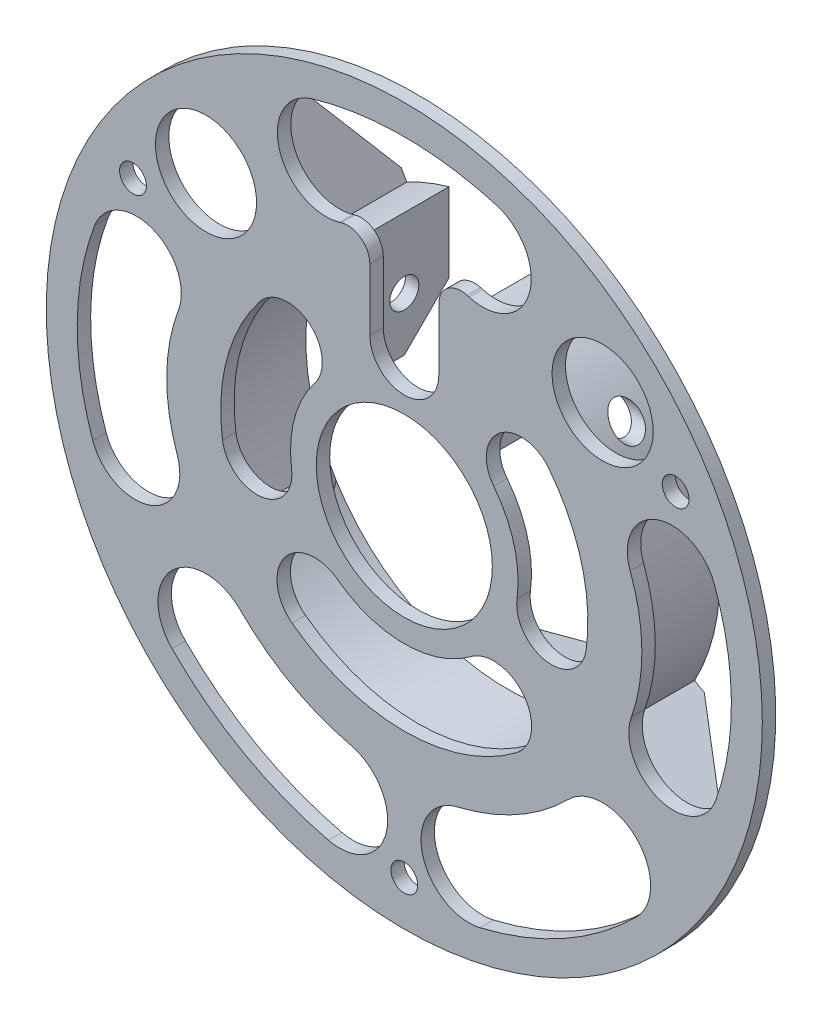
ISO-10303-21;
HEADER;
FILE_DESCRIPTION(('STEP AP214'),'2;1');
FILE_NAME('part.step','',(''),(''),'','','');
FILE_SCHEMA(('AUTOMOTIVE_DESIGN { 1 0 10303 214 1 1 1 1 }'));
ENDSEC;
DATA;
#1=APPLICATION_CONTEXT('core data for automotive mechanical design processes');
#2=APPLICATION_PROTOCOL_DEFINITION('international standard','automotive_design',2000,#1);
#3=PRODUCT_CONTEXT('',#1,'mechanical');
#4=PRODUCT('Part','Part','',(#3));
#5=PRODUCT_RELATED_PRODUCT_CATEGORY('part','',(#4));
#6=PRODUCT_DEFINITION_FORMATION('','',#4);
#7=PRODUCT_DEFINITION_CONTEXT('part definition',#1,'design');
#8=PRODUCT_DEFINITION('design','',#6,#7);
#9=PRODUCT_DEFINITION_SHAPE('','',#8);
#10=(LENGTH_UNIT() NAMED_UNIT(*) SI_UNIT(.MILLI.,.METRE.));
#11=(NAMED_UNIT(*) PLANE_ANGLE_UNIT() SI_UNIT($,.RADIAN.));
#12=(NAMED_UNIT(*) SI_UNIT($,.STERADIAN.) SOLID_ANGLE_UNIT());
#13=UNCERTAINTY_MEASURE_WITH_UNIT(LENGTH_MEASURE(1.E-05),#10,'distance_accuracy_value','');
#14=(GEOMETRIC_REPRESENTATION_CONTEXT(3) GLOBAL_UNCERTAINTY_ASSIGNED_CONTEXT((#13)) GLOBAL_UNIT_ASSIGNED_CONTEXT((#10,
#11,#12)) REPRESENTATION_CONTEXT('',''));
#15=CARTESIAN_POINT('',(0.,0.,0.));
#16=DIRECTION('',(0.,0.,1.));
#17=DIRECTION('',(1.,0.,0.));
#18=AXIS2_PLACEMENT_3D('',#15,#16,#17);
#19=CARTESIAN_POINT('',(0.,0.,20.));
#20=DIRECTION('',(0.,0.,1.));
#21=DIRECTION('',(1.,0.,0.));
#22=AXIS2_PLACEMENT_3D('',#19,#20,#21);
#23=PLANE('',#22);
#24=CARTESIAN_POINT('',(-7.45931094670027E-13,1.346145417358E-12,20.));
#25=DIRECTION('',(0.,0.,1.));
#26=DIRECTION('',(1.,0.,0.));
#27=AXIS2_PLACEMENT_3D('',#24,#25,#26);
#28=CIRCLE('',#27,51.7701129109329);
#29=CARTESIAN_POINT('',(-36.7005566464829,-36.5131994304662,20.));
#30=VERTEX_POINT('',#29);
#31=CARTESIAN_POINT('',(-11.9770866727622,-50.3656031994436,20.));
#32=VERTEX_POINT('',#31);
#33=EDGE_CURVE('E488',#30,#32,#28,.T.);
#34=ORIENTED_EDGE('',*,*,#33,.F.);
#35=CARTESIAN_POINT('',(-44.3071235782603,-44.080934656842,20.));
#36=DIRECTION('',(0.,0.,-1.));
#37=DIRECTION('',(1.,0.,0.));
#38=AXIS2_PLACEMENT_3D('',#35,#36,#37);
#39=CIRCLE('',#38,10.7298870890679);
#40=CARTESIAN_POINT('',(-51.9136905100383,-51.6486698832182,20.));
#41=VERTEX_POINT('',#40);
#42=EDGE_CURVE('E493',#41,#30,#39,.T.);
#43=ORIENTED_EDGE('',*,*,#42,.F.);
#44=CARTESIAN_POINT('',(-7.45931094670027E-13,1.346145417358E-12,20.));
#45=DIRECTION('',(0.,0.,-1.));
#46=DIRECTION('',(1.,0.,0.));
#47=AXIS2_PLACEMENT_3D('',#44,#45,#46);
#48=CIRCLE('',#47,73.2298870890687);
#49=CARTESIAN_POINT('',(-16.9418348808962,-71.2431792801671,20.));
#50=VERTEX_POINT('',#49);
#51=EDGE_CURVE('E497',#50,#41,#48,.T.);
#52=ORIENTED_EDGE('',*,*,#51,.F.);
#53=CARTESIAN_POINT('',(-14.4594607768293,-60.8043912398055,20.));
#54=DIRECTION('',(0.,0.,-1.));
#55=DIRECTION('',(1.,0.,0.));
#56=AXIS2_PLACEMENT_3D('',#53,#54,#55);
#57=CIRCLE('',#56,10.7298870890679);
#58=EDGE_CURVE('E477',#32,#50,#57,.T.);
#59=ORIENTED_EDGE('',*,*,#58,.F.);
#60=EDGE_LOOP('',(#34,#43,#52,#59));
#61=FACE_BOUND('',#60,.T.);
#62=CARTESIAN_POINT('',(-7.45931094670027E-13,1.346145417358E-12,20.));
#63=DIRECTION('',(0.,0.,-1.));
#64=DIRECTION('',(-1.,0.,0.));
#65=AXIS2_PLACEMENT_3D('',#62,#63,#64);
#66=CIRCLE('',#65,73.2298870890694);
#67=CARTESIAN_POINT('',(51.9136905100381,-51.6486698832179,20.));
#68=VERTEX_POINT('',#67);
#69=CARTESIAN_POINT('',(16.9418348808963,-71.2431792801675,20.));
#70=VERTEX_POINT('',#69);
#71=EDGE_CURVE('E508',#68,#70,#66,.T.);
#72=ORIENTED_EDGE('',*,*,#71,.F.);
#73=CARTESIAN_POINT('',(44.3071235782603,-44.080934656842,20.));
#74=DIRECTION('',(0.,0.,-1.));
#75=DIRECTION('',(-1.,0.,0.));
#76=AXIS2_PLACEMENT_3D('',#73,#74,#75);
#77=CIRCLE('',#76,10.7298870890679);
#78=CARTESIAN_POINT('',(36.7005566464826,-36.513199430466,20.));
#79=VERTEX_POINT('',#78);
#80=EDGE_CURVE('E504',#79,#68,#77,.T.);
#81=ORIENTED_EDGE('',*,*,#80,.F.);
#82=CARTESIAN_POINT('',(-7.45931094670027E-13,1.346145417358E-12,20.));
#83=DIRECTION('',(0.,0.,1.));
#84=DIRECTION('',(-1.,0.,0.));
#85=AXIS2_PLACEMENT_3D('',#82,#83,#84);
#86=CIRCLE('',#85,51.7701129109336);
#87=CARTESIAN_POINT('',(11.9770866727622,-50.3656031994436,20.));
#88=VERTEX_POINT('',#87);
#89=EDGE_CURVE('E514',#88,#79,#86,.T.);
#90=ORIENTED_EDGE('',*,*,#89,.F.);
#91=CARTESIAN_POINT('',(14.4594607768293,-60.8043912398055,20.));
#92=DIRECTION('',(0.,0.,-1.));
#93=DIRECTION('',(-1.,0.,0.));
#94=AXIS2_PLACEMENT_3D('',#91,#92,#93);
#95=CIRCLE('',#94,10.7298870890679);
#96=EDGE_CURVE('E511',#70,#88,#95,.T.);
#97=ORIENTED_EDGE('',*,*,#96,.F.);
#98=EDGE_LOOP('',(#72,#81,#90,#97));
#99=FACE_BOUND('',#98,.T.);
#100=CARTESIAN_POINT('',(-4.96130914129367E-13,-70.,20.));
#101=DIRECTION('',(0.,0.,-1.));
#102=DIRECTION('',(0.499999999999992,-0.866025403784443,0.));
#103=AXIS2_PLACEMENT_3D('',#100,#101,#102);
#104=CIRCLE('',#103,3.00000000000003);
#105=CARTESIAN_POINT('',(1.49999999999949,-72.5980762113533,20.));
#106=VERTEX_POINT('',#105);
#107=EDGE_CURVE('E1270',#106,#106,#104,.T.);
#108=ORIENTED_EDGE('',*,*,#107,.F.);
#109=EDGE_LOOP('',(#108));
#110=FACE_BOUND('',#109,.T.);
#111=DIRECTION('',(-0.866025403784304,-0.500000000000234,0.));
#112=VECTOR('',#111,1.);
#113=CARTESIAN_POINT('',(-40.3656904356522,-25.0371930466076,20.));
#114=LINE('',#113,#112);
#115=CARTESIAN_POINT('',(-40.3656904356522,-25.0371930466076,20.));
#116=VERTEX_POINT('',#115);
#117=CARTESIAN_POINT('',(-68.5198527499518,-41.2920062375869,20.));
#118=VERTEX_POINT('',#117);
#119=EDGE_CURVE('E605',#116,#118,#114,.T.);
#120=ORIENTED_EDGE('',*,*,#119,.F.);
#121=CARTESIAN_POINT('',(0.,0.,20.));
#122=DIRECTION('',(0.,0.,1.));
#123=DIRECTION('',(1.,0.,0.));
#124=AXIS2_PLACEMENT_3D('',#121,#122,#123);
#125=CIRCLE('',#124,47.5);
#126=CARTESIAN_POINT('',(40.3656904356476,-25.037193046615,20.));
#127=VERTEX_POINT('',#126);
#128=EDGE_CURVE('E1274',#116,#127,#125,.T.);
#129=ORIENTED_EDGE('',*,*,#128,.T.);
#130=DIRECTION('',(0.866025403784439,-0.5,0.));
#131=VECTOR('',#130,1.);
#132=CARTESIAN_POINT('',(-0.749999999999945,-1.29903810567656,20.));
#133=LINE('',#132,#131);
#134=CARTESIAN_POINT('',(68.5198527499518,-41.292006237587,20.));
#135=VERTEX_POINT('',#134);
#136=EDGE_CURVE('E642',#127,#135,#133,.T.);
#137=ORIENTED_EDGE('',*,*,#136,.T.);
#138=CARTESIAN_POINT('',(0.,0.,20.));
#139=DIRECTION('',(0.,0.,1.));
#140=DIRECTION('',(1.,0.,0.));
#141=AXIS2_PLACEMENT_3D('',#138,#139,#140);
#142=CIRCLE('',#141,80.);
#143=EDGE_CURVE('E921',#118,#135,#142,.T.);
#144=ORIENTED_EDGE('',*,*,#143,.F.);
#145=EDGE_LOOP('',(#120,#129,#137,#144));
#146=FACE_BOUND('',#145,.T.);
#147=ADVANCED_FACE('F35',(#61,#99,#110,#146),#23,.F.);
#148=CARTESIAN_POINT('',(0.,0.,20.));
#149=DIRECTION('',(0.,0.,-1.));
#150=DIRECTION('',(-1.,0.,0.));
#151=AXIS2_PLACEMENT_3D('',#148,#149,#150);
#152=CYLINDRICAL_SURFACE('',#151,47.5);
#153=DIRECTION('',(0.,0.,1.));
#154=VECTOR('',#153,1.);
#155=CARTESIAN_POINT('',(-40.3656904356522,-25.0371930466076,0.));
#156=LINE('',#155,#154);
#157=CARTESIAN_POINT('',(-40.3656904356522,-25.0371930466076,0.));
#158=VERTEX_POINT('',#157);
#159=EDGE_CURVE('E593',#158,#116,#156,.T.);
#160=ORIENTED_EDGE('',*,*,#159,.F.);
#161=CARTESIAN_POINT('',(0.,0.,0.));
#162=DIRECTION('',(0.,0.,1.));
#163=DIRECTION('',(1.,0.,0.));
#164=AXIS2_PLACEMENT_3D('',#161,#162,#163);
#165=CIRCLE('',#164,47.5);
#166=CARTESIAN_POINT('',(40.3656904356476,-25.037193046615,0.));
#167=VERTEX_POINT('',#166);
#168=EDGE_CURVE('E1166',#158,#167,#165,.T.);
#169=ORIENTED_EDGE('',*,*,#168,.T.);
#170=DIRECTION('',(0.,0.,1.));
#171=VECTOR('',#170,1.);
#172=CARTESIAN_POINT('',(40.3656904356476,-25.037193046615,0.));
#173=LINE('',#172,#171);
#174=EDGE_CURVE('E658',#167,#127,#173,.T.);
#175=ORIENTED_EDGE('',*,*,#174,.T.);
#176=ORIENTED_EDGE('',*,*,#128,.F.);
#177=EDGE_LOOP('',(#160,#169,#175,#176));
#178=FACE_BOUND('',#177,.T.);
#179=ADVANCED_FACE('F865',(#178),#152,.T.);
#180=CARTESIAN_POINT('',(44.3071235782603,44.080934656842,20.));
#181=DIRECTION('',(0.,0.,-1.));
#182=DIRECTION('',(-1.,0.,0.));
#183=AXIS2_PLACEMENT_3D('',#180,#181,#182);
#184=CIRCLE('',#183,11.295662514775);
#185=CARTESIAN_POINT('',(33.0114610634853,44.080934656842,20.));
#186=VERTEX_POINT('',#185);
#187=EDGE_CURVE('E575',#186,#186,#184,.T.);
#188=ORIENTED_EDGE('',*,*,#187,.F.);
#189=EDGE_LOOP('',(#188));
#190=FACE_BOUND('',#189,.T.);
#191=CARTESIAN_POINT('',(11.9084170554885,0.113152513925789,20.));
#192=DIRECTION('',(0.,0.,-1.));
#193=DIRECTION('',(-1.,0.,0.));
#194=AXIS2_PLACEMENT_3D('',#191,#192,#193);
#195=CIRCLE('',#194,61.1769930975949);
#196=CARTESIAN_POINT('',(69.1960466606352,21.5782865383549,20.));
#197=VERTEX_POINT('',#196);
#198=CARTESIAN_POINT('',(69.5935850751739,-20.2595222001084,20.));
#199=VERTEX_POINT('',#198);
#200=EDGE_CURVE('E581',#197,#199,#195,.T.);
#201=ORIENTED_EDGE('',*,*,#200,.F.);
#202=CARTESIAN_POINT('',(59.8310159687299,18.0692979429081,20.));
#203=DIRECTION('',(0.,0.,-1.));
#204=DIRECTION('',(-1.,0.,0.));
#205=AXIS2_PLACEMENT_3D('',#202,#203,#204);
#206=CIRCLE('',#205,10.0008400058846);
#207=CARTESIAN_POINT('',(50.4659852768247,14.5603093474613,20.));
#208=VERTEX_POINT('',#207);
#209=EDGE_CURVE('E579',#208,#197,#206,.T.);
#210=ORIENTED_EDGE('',*,*,#209,.F.);
#211=CARTESIAN_POINT('',(11.9084170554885,0.113152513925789,20.));
#212=DIRECTION('',(0.,0.,1.));
#213=DIRECTION('',(-1.,0.,0.));
#214=AXIS2_PLACEMENT_3D('',#211,#212,#213);
#215=CIRCLE('',#214,41.1753130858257);
#216=CARTESIAN_POINT('',(50.7335494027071,-13.5987221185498,20.));
#217=VERTEX_POINT('',#216);
#218=EDGE_CURVE('E587',#217,#208,#215,.T.);
#219=ORIENTED_EDGE('',*,*,#218,.F.);
#220=CARTESIAN_POINT('',(60.1635672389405,-16.9291221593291,20.));
#221=DIRECTION('',(0.,0.,-1.));
#222=DIRECTION('',(-1.,0.,0.));
#223=AXIS2_PLACEMENT_3D('',#220,#221,#222);
#224=CIRCLE('',#223,10.0008400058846);
#225=EDGE_CURVE('E584',#199,#217,#224,.T.);
#226=ORIENTED_EDGE('',*,*,#225,.F.);
#227=EDGE_LOOP('',(#201,#210,#219,#226));
#228=FACE_BOUND('',#227,.T.);
#229=CARTESIAN_POINT('',(60.6217782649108,34.9999999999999,20.));
#230=DIRECTION('',(0.,0.,-1.));
#231=DIRECTION('',(0.500000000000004,0.866025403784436,0.));
#232=AXIS2_PLACEMENT_3D('',#229,#230,#231);
#233=CIRCLE('',#232,3.00000000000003);
#234=CARTESIAN_POINT('',(62.1217782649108,37.5980762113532,20.));
#235=VERTEX_POINT('',#234);
#236=EDGE_CURVE('E1468',#235,#235,#233,.T.);
#237=ORIENTED_EDGE('',*,*,#236,.F.);
#238=EDGE_LOOP('',(#237));
#239=FACE_BOUND('',#238,.T.);
#240=DIRECTION('',(-0.500000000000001,-0.866025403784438,0.));
#241=VECTOR('',#240,1.);
#242=CARTESIAN_POINT('',(1.29903810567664,-0.749999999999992,20.));
#243=LINE('',#242,#241);
#244=CARTESIAN_POINT('',(41.2920062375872,68.5198527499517,20.));
#245=VERTEX_POINT('',#244);
#246=CARTESIAN_POINT('',(25.0371930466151,40.3656904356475,20.));
#247=VERTEX_POINT('',#246);
#248=EDGE_CURVE('E622',#245,#247,#243,.T.);
#249=ORIENTED_EDGE('',*,*,#248,.F.);
#250=CARTESIAN_POINT('',(70.0198527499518,-38.6939300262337,20.));
#251=VERTEX_POINT('',#250);
#252=EDGE_CURVE('E918',#251,#245,#142,.T.);
#253=ORIENTED_EDGE('',*,*,#252,.F.);
#254=DIRECTION('',(0.866025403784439,-0.5,0.));
#255=VECTOR('',#254,1.);
#256=CARTESIAN_POINT('',(0.750000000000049,1.29903810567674,20.));
#257=LINE('',#256,#255);
#258=CARTESIAN_POINT('',(41.8656904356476,-22.4391168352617,20.));
#259=VERTEX_POINT('',#258);
#260=EDGE_CURVE('E649',#259,#251,#257,.T.);
#261=ORIENTED_EDGE('',*,*,#260,.F.);
#262=EDGE_CURVE('E1279',#259,#247,#125,.T.);
#263=ORIENTED_EDGE('',*,*,#262,.T.);
#264=EDGE_LOOP('',(#249,#253,#261,#263));
#265=FACE_BOUND('',#264,.T.);
#266=ADVANCED_FACE('F869',(#190,#228,#239,#265),#23,.F.);
#267=CARTESIAN_POINT('',(39.2035220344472,26.8204000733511,10.));
#268=CARTESIAN_POINT('',(39.2035216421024,26.8204007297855,10.0792784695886));
#269=CARTESIAN_POINT('',(39.2015344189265,26.8233061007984,10.1585837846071));
#270=CARTESIAN_POINT('',(39.193607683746,26.8348870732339,10.3166075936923));
#271=CARTESIAN_POINT('',(39.1876656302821,26.843566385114,10.3953256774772));
#272=CARTESIAN_POINT('',(39.1718821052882,26.8665935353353,10.5517045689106));
#273=CARTESIAN_POINT('',(39.1620326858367,26.8809529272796,10.6293628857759));
#274=CARTESIAN_POINT('',(39.138555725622,26.9151236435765,10.7828986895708));
#275=CARTESIAN_POINT('',(39.1249265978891,26.9349372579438,10.8587754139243));
#276=CARTESIAN_POINT('',(39.0787278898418,27.0019627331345,11.082235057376));
#277=CARTESIAN_POINT('',(39.0407596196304,27.0568876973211,11.2264945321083));
#278=CARTESIAN_POINT('',(38.9520101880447,27.1844974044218,11.5024067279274));
#279=CARTESIAN_POINT('',(38.901233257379,27.2571762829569,11.6340635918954));
#280=CARTESIAN_POINT('',(38.7853337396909,27.4218629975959,11.8900305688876));
#281=CARTESIAN_POINT('',(38.7195517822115,27.5147450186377,12.0134766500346));
#282=CARTESIAN_POINT('',(38.5776386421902,27.7133669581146,12.2427534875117));
#283=CARTESIAN_POINT('',(38.5015023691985,27.8191131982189,12.3485755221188));
#284=CARTESIAN_POINT('',(38.3276763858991,28.0582325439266,12.5579024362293));
#285=CARTESIAN_POINT('',(38.2284956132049,28.1933007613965,12.6582261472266));
#286=CARTESIAN_POINT('',(38.0212870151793,28.4721265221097,12.8346586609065));
#287=CARTESIAN_POINT('',(37.9132534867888,28.6158896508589,12.9107516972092));
#288=CARTESIAN_POINT('',(37.6686384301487,28.9373802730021,13.0521058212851));
#289=CARTESIAN_POINT('',(37.5306159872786,29.1162350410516,13.1123080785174));
#290=CARTESIAN_POINT('',(37.2481754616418,29.476702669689,13.2007040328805));
#291=CARTESIAN_POINT('',(37.1037541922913,29.6583168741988,13.2288815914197));
#292=CARTESIAN_POINT('',(36.783705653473,30.0547064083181,13.2571165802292));
#293=CARTESIAN_POINT('',(36.6073071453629,30.2693106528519,13.2509065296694));
#294=CARTESIAN_POINT('',(36.2530884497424,30.6926672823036,13.1970130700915));
#295=CARTESIAN_POINT('',(36.0752664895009,30.9014101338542,13.1492657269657));
#296=CARTESIAN_POINT('',(35.8017556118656,31.2170882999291,13.0433004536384));
#297=CARTESIAN_POINT('',(35.7048304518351,31.3278815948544,12.9992663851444));
#298=CARTESIAN_POINT('',(35.5128381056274,31.5453534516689,12.8985128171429));
#299=CARTESIAN_POINT('',(35.4177714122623,31.6520309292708,12.8417900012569));
#300=CARTESIAN_POINT('',(35.2307374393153,31.8600797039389,12.7155713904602));
#301=CARTESIAN_POINT('',(35.1387652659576,31.9614595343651,12.6460970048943));
#302=CARTESIAN_POINT('',(34.9590961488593,32.1578809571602,12.494060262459));
#303=CARTESIAN_POINT('',(34.8713964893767,32.2529265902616,12.4115063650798));
#304=CARTESIAN_POINT('',(34.6810337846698,32.4576625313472,12.2110479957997));
#305=CARTESIAN_POINT('',(34.5799531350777,32.5652536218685,12.0894350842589));
#306=CARTESIAN_POINT('',(34.3910219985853,32.7647133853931,11.8249674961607));
#307=CARTESIAN_POINT('',(34.3031490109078,32.8566088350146,11.6821497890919));
#308=CARTESIAN_POINT('',(34.1618680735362,33.0034088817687,11.4068254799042));
#309=CARTESIAN_POINT('',(34.1050835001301,33.0620359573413,11.27805163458));
#310=CARTESIAN_POINT('',(34.006691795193,33.163231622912,11.0087050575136));
#311=CARTESIAN_POINT('',(33.9650755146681,33.2058098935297,10.8681395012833));
#312=CARTESIAN_POINT('',(33.9163643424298,33.2555373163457,10.6504197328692));
#313=CARTESIAN_POINT('',(33.9023796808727,33.2697898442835,10.5763335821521));
#314=CARTESIAN_POINT('',(33.8794217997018,33.2931682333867,10.4266058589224));
#315=CARTESIAN_POINT('',(33.8704460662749,33.3022966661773,10.3509650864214));
#316=CARTESIAN_POINT('',(33.8577433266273,33.3152112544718,10.19881342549));
#317=CARTESIAN_POINT('',(33.8540145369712,33.318999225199,10.1223028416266));
#318=CARTESIAN_POINT('',(33.8518900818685,33.3211574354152,9.96915700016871));
#319=CARTESIAN_POINT('',(33.8534938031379,33.3195282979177,9.8925217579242));
#320=CARTESIAN_POINT('',(33.8651530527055,33.3076803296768,9.68367089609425));
#321=CARTESIAN_POINT('',(33.8805529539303,33.2920295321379,9.55199147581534));
#322=CARTESIAN_POINT('',(33.9261798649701,33.2455311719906,9.29412187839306));
#323=CARTESIAN_POINT('',(33.9564095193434,33.2146808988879,9.16793268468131));
#324=CARTESIAN_POINT('',(34.0307093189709,33.1385531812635,8.92008461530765));
#325=CARTESIAN_POINT('',(34.0751493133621,33.092889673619,8.79865730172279));
#326=CARTESIAN_POINT('',(34.1750932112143,32.9896677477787,8.56590715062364));
#327=CARTESIAN_POINT('',(34.2306029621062,32.932103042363,8.45458969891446));
#328=CARTESIAN_POINT('',(34.3825412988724,32.7735929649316,8.18590499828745));
#329=CARTESIAN_POINT('',(34.4849502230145,32.6659380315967,8.03585356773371));
#330=CARTESIAN_POINT('',(34.7037633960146,32.4333853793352,7.76140355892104));
#331=CARTESIAN_POINT('',(34.8202024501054,32.3084446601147,7.63707094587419));
#332=CARTESIAN_POINT('',(35.1008496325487,32.0036818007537,7.37764335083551));
#333=CARTESIAN_POINT('',(35.2684303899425,31.8190822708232,7.25181062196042));
#334=CARTESIAN_POINT('',(35.611606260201,31.4345374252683,7.04202127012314));
#335=CARTESIAN_POINT('',(35.787204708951,31.2345856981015,6.95808225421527));
#336=CARTESIAN_POINT('',(36.1437287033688,30.8213635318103,6.83045949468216));
#337=CARTESIAN_POINT('',(36.3246946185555,30.6079402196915,6.78738734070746));
#338=CARTESIAN_POINT('',(36.6850812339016,30.1750560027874,6.74441475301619));
#339=CARTESIAN_POINT('',(36.8645008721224,29.9555913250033,6.74454193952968));
#340=CARTESIAN_POINT('',(37.1364866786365,29.6168018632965,6.77957538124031));
#341=CARTESIAN_POINT('',(37.2313217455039,29.4974849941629,6.79858300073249));
#342=CARTESIAN_POINT('',(37.4184470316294,29.2597445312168,6.85037516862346));
#343=CARTESIAN_POINT('',(37.5107367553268,29.1413211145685,6.88316237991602));
#344=CARTESIAN_POINT('',(37.6917284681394,28.9068418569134,6.96290637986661));
#345=CARTESIAN_POINT('',(37.7804364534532,28.7907822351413,7.00983827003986));
#346=CARTESIAN_POINT('',(37.9534730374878,28.5622905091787,7.11831568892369));
#347=CARTESIAN_POINT('',(38.0378020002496,28.4498581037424,7.17986000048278));
#348=CARTESIAN_POINT('',(38.2288457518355,28.1928867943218,7.34149554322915));
#349=CARTESIAN_POINT('',(38.3334172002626,28.0504365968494,7.44757762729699));
#350=CARTESIAN_POINT('',(38.5295944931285,27.7803562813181,7.68684558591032));
#351=CARTESIAN_POINT('',(38.6212201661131,27.6527035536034,7.81998923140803));
#352=CARTESIAN_POINT('',(38.7753341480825,27.436077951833,8.09002885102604));
#353=CARTESIAN_POINT('',(38.8401360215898,27.3441754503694,8.22321666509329));
#354=CARTESIAN_POINT('',(38.9267876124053,27.2205392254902,8.43553981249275));
#355=CARTESIAN_POINT('',(38.9539292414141,27.1816730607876,8.50846353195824));
#356=CARTESIAN_POINT('',(39.0044068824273,27.109190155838,8.65812193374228));
#357=CARTESIAN_POINT('',(39.0277445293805,27.0755711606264,8.73485496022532));
#358=CARTESIAN_POINT('',(39.0705062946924,27.0138290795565,8.89226501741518));
#359=CARTESIAN_POINT('',(39.089899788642,26.9857490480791,8.97296728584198));
#360=CARTESIAN_POINT('',(39.1242959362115,26.9358568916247,9.13715879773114));
#361=CARTESIAN_POINT('',(39.1393008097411,26.9140415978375,9.22064660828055));
#362=CARTESIAN_POINT('',(39.1646929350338,26.8770781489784,9.38954806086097));
#363=CARTESIAN_POINT('',(39.1750916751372,26.8619134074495,9.47495634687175));
#364=CARTESIAN_POINT('',(39.1911697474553,26.8384503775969,9.64710317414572));
#365=CARTESIAN_POINT('',(39.1968528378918,26.8301466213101,9.73384059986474));
#366=CARTESIAN_POINT('',(39.2012670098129,26.8236959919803,9.85064575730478));
#367=CARTESIAN_POINT('',(39.2021123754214,26.8224604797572,9.88049587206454));
#368=CARTESIAN_POINT('',(39.2032399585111,26.8208124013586,9.94022938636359));
#369=CARTESIAN_POINT('',(39.2035221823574,26.8203998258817,9.97011278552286));
#370=CARTESIAN_POINT('',(39.2035220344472,26.8204000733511,10.));
#371=B_SPLINE_CURVE_WITH_KNOTS('',3,(#267,#268,#269,#270,#271,#272,#273,#274,#275,#276,#277,
#278,#279,#280,#281,#282,#283,#284,#285,#286,#287,#288,#289,#290,#291,#292,#293,#294,#295,#296,
#297,#298,#299,#300,#301,#302,#303,#304,#305,#306,#307,#308,#309,#310,#311,#312,#313,#314,#315,
#316,#317,#318,#319,#320,#321,#322,#323,#324,#325,#326,#327,#328,#329,#330,#331,#332,#333,#334,
#335,#336,#337,#338,#339,#340,#341,#342,#343,#344,#345,#346,#347,#348,#349,#350,#351,#352,#353,
#354,#355,#356,#357,#358,#359,#360,#361,#362,#363,#364,#365,#366,#367,#368,#369,#370),
.UNSPECIFIED.,.T.,.F.,(4,2,2,2,2,2,2,2,2,2,2,2,2,2,2,2,2,2,2,2,2,2,2,2,2,2,2,2,2,2,2,2,2,2,2,2,
2,2,2,2,2,2,2,2,2,2,2,2,2,2,2,4),(0.,0.237803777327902,0.475760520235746,0.714203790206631,
0.952747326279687,1.42728421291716,1.90166456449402,2.40345453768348,2.90549210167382,
3.4892510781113,4.07338912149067,4.77219882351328,5.47136052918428,6.30169347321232,
7.13330672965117,7.59376555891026,8.05434487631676,8.51415785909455,8.97367465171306,
9.54551426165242,10.1163683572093,10.5720537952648,11.0274639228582,11.2573582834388,
11.4871371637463,11.7168379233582,11.9465122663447,12.3449469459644,12.7434527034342,
13.1533142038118,13.5633927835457,14.1933711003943,14.8249457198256,15.658390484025,
16.4921852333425,17.3382699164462,18.1848955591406,18.6451461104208,19.1054856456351,
19.5650195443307,20.0245151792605,20.6403193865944,21.2551699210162,21.7757096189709,
22.0363687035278,22.2969154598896,22.5594138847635,22.8217792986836,23.0834866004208,
23.3449851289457,23.4346358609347,23.5242855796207),.UNSPECIFIED.);
#372=CARTESIAN_POINT('',(39.2035220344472,26.8204000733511,10.));
#373=VERTEX_POINT('',#372);
#374=EDGE_CURVE('E775',#373,#373,#371,.T.);
#375=ORIENTED_EDGE('',*,*,#374,.T.);
#376=EDGE_LOOP('',(#375));
#377=FACE_BOUND('',#376,.T.);
#378=DIRECTION('',(0.,0.,1.));
#379=VECTOR('',#378,1.);
#380=CARTESIAN_POINT('',(25.0371930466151,40.3656904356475,0.));
#381=LINE('',#380,#379);
#382=CARTESIAN_POINT('',(25.0371930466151,40.3656904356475,0.));
#383=VERTEX_POINT('',#382);
#384=EDGE_CURVE('E612',#383,#247,#381,.T.);
#385=ORIENTED_EDGE('',*,*,#384,.T.);
#386=ORIENTED_EDGE('',*,*,#262,.F.);
#387=DIRECTION('',(0.,0.,1.));
#388=VECTOR('',#387,1.);
#389=CARTESIAN_POINT('',(41.8656904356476,-22.4391168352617,0.));
#390=LINE('',#389,#388);
#391=CARTESIAN_POINT('',(41.8656904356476,-22.4391168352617,0.));
#392=VERTEX_POINT('',#391);
#393=EDGE_CURVE('E652',#392,#259,#390,.T.);
#394=ORIENTED_EDGE('',*,*,#393,.F.);
#395=EDGE_CURVE('E1165',#392,#383,#165,.T.);
#396=ORIENTED_EDGE('',*,*,#395,.T.);
#397=EDGE_LOOP('',(#385,#386,#394,#396));
#398=FACE_BOUND('',#397,.T.);
#399=ADVANCED_FACE('F874',(#377,#398),#152,.T.);
#400=CARTESIAN_POINT('',(-8.49320613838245E-12,-1.98886046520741E-12,20.));
#401=DIRECTION('',(0.,0.,-1.));
#402=DIRECTION('',(-1.,0.,0.));
#403=AXIS2_PLACEMENT_3D('',#400,#401,#402);
#404=CIRCLE('',#403,41.0268249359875);
#405=CARTESIAN_POINT('',(32.2552062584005,25.3535408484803,20.));
#406=VERTEX_POINT('',#405);
#407=CARTESIAN_POINT('',(40.6379601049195,-5.63529616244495,20.));
#408=VERTEX_POINT('',#407);
#409=EDGE_CURVE('E720',#406,#408,#404,.T.);
#410=ORIENTED_EDGE('',*,*,#409,.F.);
#411=CARTESIAN_POINT('',(26.1235753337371,20.5338985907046,20.));
#412=DIRECTION('',(0.,0.,-1.));
#413=DIRECTION('',(-1.,0.,0.));
#414=AXIS2_PLACEMENT_3D('',#411,#412,#413);
#415=CIRCLE('',#414,7.79909285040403);
#416=CARTESIAN_POINT('',(19.991944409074,15.7142563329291,20.));
#417=VERTEX_POINT('',#416);
#418=EDGE_CURVE('E712',#417,#406,#415,.T.);
#419=ORIENTED_EDGE('',*,*,#418,.F.);
#420=CARTESIAN_POINT('',(-8.49320613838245E-12,-1.98886046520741E-12,20.));
#421=DIRECTION('',(0.,0.,1.));
#422=DIRECTION('',(-1.,0.,0.));
#423=AXIS2_PLACEMENT_3D('',#420,#421,#422);
#424=CIRCLE('',#423,25.4286392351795);
#425=CARTESIAN_POINT('',(25.1876187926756,-3.49278583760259,20.));
#426=VERTEX_POINT('',#425);
#427=EDGE_CURVE('E726',#426,#417,#424,.T.);
#428=ORIENTED_EDGE('',*,*,#427,.F.);
#429=CARTESIAN_POINT('',(32.9127894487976,-4.564041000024,20.));
#430=DIRECTION('',(0.,0.,-1.));
#431=DIRECTION('',(-1.,0.,0.));
#432=AXIS2_PLACEMENT_3D('',#429,#430,#431);
#433=CIRCLE('',#432,7.79909285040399);
#434=EDGE_CURVE('E723',#408,#426,#433,.T.);
#435=ORIENTED_EDGE('',*,*,#434,.F.);
#436=EDGE_LOOP('',(#410,#419,#428,#435));
#437=FACE_BOUND('',#436,.T.);
#438=CARTESIAN_POINT('',(-8.49320613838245E-12,-1.98886046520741E-12,20.));
#439=DIRECTION('',(0.,0.,1.));
#440=DIRECTION('',(1.,0.,0.));
#441=AXIS2_PLACEMENT_3D('',#438,#439,#440);
#442=CIRCLE('',#441,25.4286392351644);
#443=CARTESIAN_POINT('',(-19.9919444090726,15.7142563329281,20.));
#444=VERTEX_POINT('',#443);
#445=CARTESIAN_POINT('',(-25.1876187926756,-3.49278583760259,20.));
#446=VERTEX_POINT('',#445);
#447=EDGE_CURVE('E700',#444,#446,#442,.T.);
#448=ORIENTED_EDGE('',*,*,#447,.F.);
#449=CARTESIAN_POINT('',(-26.1235753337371,20.5338985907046,20.));
#450=DIRECTION('',(0.,0.,-1.));
#451=DIRECTION('',(1.,0.,0.));
#452=AXIS2_PLACEMENT_3D('',#449,#450,#451);
#453=CIRCLE('',#452,7.79909285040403);
#454=CARTESIAN_POINT('',(-32.2552062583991,25.3535408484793,20.));
#455=VERTEX_POINT('',#454);
#456=EDGE_CURVE('E692',#455,#444,#453,.T.);
#457=ORIENTED_EDGE('',*,*,#456,.F.);
#458=CARTESIAN_POINT('',(-8.49320613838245E-12,-1.98886046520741E-12,20.));
#459=DIRECTION('',(0.,0.,-1.));
#460=DIRECTION('',(1.,0.,0.));
#461=AXIS2_PLACEMENT_3D('',#458,#459,#460);
#462=CIRCLE('',#461,41.0268249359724);
#463=CARTESIAN_POINT('',(-40.6379601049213,-5.63529616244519,20.));
#464=VERTEX_POINT('',#463);
#465=EDGE_CURVE('E706',#464,#455,#462,.T.);
#466=ORIENTED_EDGE('',*,*,#465,.F.);
#467=CARTESIAN_POINT('',(-32.9127894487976,-4.564041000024,20.));
#468=DIRECTION('',(0.,0.,-1.));
#469=DIRECTION('',(1.,0.,0.));
#470=AXIS2_PLACEMENT_3D('',#467,#468,#469);
#471=CIRCLE('',#470,7.79909285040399);
#472=EDGE_CURVE('E703',#446,#464,#471,.T.);
#473=ORIENTED_EDGE('',*,*,#472,.F.);
#474=EDGE_LOOP('',(#448,#457,#466,#473));
#475=FACE_BOUND('',#474,.T.);
#476=CARTESIAN_POINT('',(0.,1.31838984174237E-13,20.));
#477=DIRECTION('',(0.,0.,-1.));
#478=DIRECTION('',(-1.,0.,0.));
#479=AXIS2_PLACEMENT_3D('',#476,#477,#478);
#480=CIRCLE('',#479,41.6849378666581);
#481=CARTESIAN_POINT('',(25.0803442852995,-33.2958011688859,20.));
#482=VERTEX_POINT('',#481);
#483=CARTESIAN_POINT('',(-25.0803442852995,-33.2958011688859,20.));
#484=VERTEX_POINT('',#483);
#485=EDGE_CURVE('E680',#482,#484,#480,.T.);
#486=ORIENTED_EDGE('',*,*,#485,.F.);
#487=CARTESIAN_POINT('',(19.9919444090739,-26.5406167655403,20.));
#488=DIRECTION('',(0.,0.,-1.));
#489=DIRECTION('',(-1.,0.,0.));
#490=AXIS2_PLACEMENT_3D('',#487,#488,#489);
#491=CIRCLE('',#490,8.45720578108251);
#492=CARTESIAN_POINT('',(14.9035445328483,-19.7854323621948,20.));
#493=VERTEX_POINT('',#492);
#494=EDGE_CURVE('E678',#493,#482,#491,.T.);
#495=ORIENTED_EDGE('',*,*,#494,.F.);
#496=CARTESIAN_POINT('',(0.,1.31838984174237E-13,20.));
#497=DIRECTION('',(0.,0.,1.));
#498=DIRECTION('',(-1.,0.,0.));
#499=AXIS2_PLACEMENT_3D('',#496,#497,#498);
#500=CIRCLE('',#499,24.7705263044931);
#501=CARTESIAN_POINT('',(-14.9035445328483,-19.7854323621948,20.));
#502=VERTEX_POINT('',#501);
#503=EDGE_CURVE('E686',#502,#493,#500,.T.);
#504=ORIENTED_EDGE('',*,*,#503,.F.);
#505=CARTESIAN_POINT('',(-19.9919444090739,-26.5406167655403,20.));
#506=DIRECTION('',(0.,0.,-1.));
#507=DIRECTION('',(-1.,0.,0.));
#508=AXIS2_PLACEMENT_3D('',#505,#506,#507);
#509=CIRCLE('',#508,8.45720578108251);
#510=EDGE_CURVE('E683',#484,#502,#509,.T.);
#511=ORIENTED_EDGE('',*,*,#510,.F.);
#512=EDGE_LOOP('',(#486,#495,#504,#511));
#513=FACE_BOUND('',#512,.T.);
#514=CARTESIAN_POINT('',(0.,0.,20.));
#515=DIRECTION('',(0.,0.,-1.));
#516=DIRECTION('',(-1.,0.,0.));
#517=AXIS2_PLACEMENT_3D('',#514,#515,#516);
#518=CIRCLE('',#517,19.6694698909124);
#519=CARTESIAN_POINT('',(-19.6694698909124,0.,20.));
#520=VERTEX_POINT('',#519);
#521=EDGE_CURVE('E672',#520,#520,#518,.T.);
#522=ORIENTED_EDGE('',*,*,#521,.F.);
#523=EDGE_LOOP('',(#522));
#524=FACE_BOUND('',#523,.T.);
#525=DIRECTION('',(0.,-1.,0.));
#526=VECTOR('',#525,1.);
#527=CARTESIAN_POINT('',(7.70056508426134,31.0716952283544,20.));
#528=LINE('',#527,#526);
#529=CARTESIAN_POINT('',(7.70056508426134,44.8784148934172,20.));
#530=VERTEX_POINT('',#529);
#531=CARTESIAN_POINT('',(7.70056508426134,31.0716952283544,20.));
#532=VERTEX_POINT('',#531);
#533=EDGE_CURVE('E666',#530,#532,#528,.T.);
#534=ORIENTED_EDGE('',*,*,#533,.F.);
#535=CARTESIAN_POINT('',(12.7005650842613,44.8784148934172,20.));
#536=DIRECTION('',(0.,0.,1.));
#537=DIRECTION('',(1.,0.,0.));
#538=AXIS2_PLACEMENT_3D('',#535,#536,#537);
#539=CIRCLE('',#538,5.);
#540=CARTESIAN_POINT('',(14.0620907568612,49.6894696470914,20.));
#541=VERTEX_POINT('',#540);
#542=EDGE_CURVE('E1119',#530,#541,#539,.F.);
#543=ORIENTED_EDGE('',*,*,#542,.T.);
#544=CARTESIAN_POINT('',(0.,-8.3544282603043E-12,20.));
#545=DIRECTION('',(0.,0.,1.));
#546=DIRECTION('',(-1.,0.,0.));
#547=AXIS2_PLACEMENT_3D('',#544,#545,#546);
#548=CIRCLE('',#547,51.6409313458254);
#549=CARTESIAN_POINT('',(14.4594607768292,49.5752940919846,20.));
#550=VERTEX_POINT('',#549);
#551=EDGE_CURVE('E560',#550,#541,#548,.T.);
#552=ORIENTED_EDGE('',*,*,#551,.F.);
#553=CARTESIAN_POINT('',(17.5,60.,20.));
#554=DIRECTION('',(0.,0.,-1.));
#555=DIRECTION('',(-1.,0.,0.));
#556=AXIS2_PLACEMENT_3D('',#553,#554,#555);
#557=CIRCLE('',#556,10.8590686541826);
#558=CARTESIAN_POINT('',(20.5405392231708,70.4247059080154,20.));
#559=VERTEX_POINT('',#558);
#560=EDGE_CURVE('E556',#559,#550,#557,.T.);
#561=ORIENTED_EDGE('',*,*,#560,.F.);
#562=CARTESIAN_POINT('',(0.,-8.3544282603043E-12,20.));
#563=DIRECTION('',(0.,0.,-1.));
#564=DIRECTION('',(-1.,0.,0.));
#565=AXIS2_PLACEMENT_3D('',#562,#563,#564);
#566=CIRCLE('',#565,73.3590686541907);
#567=CARTESIAN_POINT('',(-20.5405392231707,70.4247059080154,20.));
#568=VERTEX_POINT('',#567);
#569=EDGE_CURVE('E553',#568,#559,#566,.T.);
#570=ORIENTED_EDGE('',*,*,#569,.F.);
#571=CARTESIAN_POINT('',(-17.5,60.,20.));
#572=DIRECTION('',(0.,0.,-1.));
#573=DIRECTION('',(-1.,0.,0.));
#574=AXIS2_PLACEMENT_3D('',#571,#572,#573);
#575=CIRCLE('',#574,10.8590686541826);
#576=CARTESIAN_POINT('',(-14.4594607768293,49.5752940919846,20.));
#577=VERTEX_POINT('',#576);
#578=EDGE_CURVE('E544',#577,#568,#575,.T.);
#579=ORIENTED_EDGE('',*,*,#578,.F.);
#580=CARTESIAN_POINT('',(-14.0620907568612,49.6894696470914,20.));
#581=VERTEX_POINT('',#580);
#582=EDGE_CURVE('E559',#581,#577,#548,.T.);
#583=ORIENTED_EDGE('',*,*,#582,.F.);
#584=CARTESIAN_POINT('',(-12.7005650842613,44.8784148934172,20.));
#585=DIRECTION('',(0.,0.,1.));
#586=DIRECTION('',(1.,0.,0.));
#587=AXIS2_PLACEMENT_3D('',#584,#585,#586);
#588=CIRCLE('',#587,5.);
#589=CARTESIAN_POINT('',(-7.70056508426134,44.8784148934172,20.));
#590=VERTEX_POINT('',#589);
#591=EDGE_CURVE('E1117',#581,#590,#588,.F.);
#592=ORIENTED_EDGE('',*,*,#591,.T.);
#593=DIRECTION('',(0.,1.,0.));
#594=VECTOR('',#593,1.);
#595=CARTESIAN_POINT('',(-7.70056508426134,31.0716952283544,20.));
#596=LINE('',#595,#594);
#597=CARTESIAN_POINT('',(-7.70056508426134,31.0716952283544,20.));
#598=VERTEX_POINT('',#597);
#599=EDGE_CURVE('E663',#598,#590,#596,.T.);
#600=ORIENTED_EDGE('',*,*,#599,.F.);
#601=CARTESIAN_POINT('',(0.,31.0716952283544,20.));
#602=DIRECTION('',(0.,0.,-1.));
#603=DIRECTION('',(-1.,0.,0.));
#604=AXIS2_PLACEMENT_3D('',#601,#602,#603);
#605=CIRCLE('',#604,7.70056508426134);
#606=EDGE_CURVE('E661',#532,#598,#605,.T.);
#607=ORIENTED_EDGE('',*,*,#606,.F.);
#608=EDGE_LOOP('',(#534,#543,#552,#561,#570,#579,#583,#592,#600,#607));
#609=FACE_BOUND('',#608,.T.);
#610=CARTESIAN_POINT('',(38.6939300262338,70.0198527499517,20.));
#611=VERTEX_POINT('',#610);
#612=CARTESIAN_POINT('',(-38.6939300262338,70.0198527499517,20.));
#613=VERTEX_POINT('',#612);
#614=EDGE_CURVE('E911',#611,#613,#142,.T.);
#615=ORIENTED_EDGE('',*,*,#614,.F.);
#616=DIRECTION('',(-0.500000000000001,-0.866025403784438,0.));
#617=VECTOR('',#616,1.);
#618=CARTESIAN_POINT('',(-1.29903810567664,0.749999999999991,20.));
#619=LINE('',#618,#617);
#620=CARTESIAN_POINT('',(22.4391168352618,41.8656904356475,20.));
#621=VERTEX_POINT('',#620);
#622=EDGE_CURVE('E624',#611,#621,#619,.T.);
#623=ORIENTED_EDGE('',*,*,#622,.T.);
#624=CARTESIAN_POINT('',(13.,45.6864312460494,20.));
#625=VERTEX_POINT('',#624);
#626=EDGE_CURVE('E1175',#621,#625,#125,.T.);
#627=ORIENTED_EDGE('',*,*,#626,.T.);
#628=DIRECTION('',(0.,-1.,0.));
#629=VECTOR('',#628,1.);
#630=CARTESIAN_POINT('',(13.,55.2993134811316,20.));
#631=LINE('',#630,#629);
#632=CARTESIAN_POINT('',(13.,18.081318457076,20.));
#633=VERTEX_POINT('',#632);
#634=EDGE_CURVE('E1489',#625,#633,#631,.T.);
#635=ORIENTED_EDGE('',*,*,#634,.T.);
#636=DIRECTION('',(-1.,0.,0.));
#637=VECTOR('',#636,1.);
#638=CARTESIAN_POINT('',(13.,18.081318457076,20.));
#639=LINE('',#638,#637);
#640=CARTESIAN_POINT('',(16.,18.081318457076,20.));
#641=VERTEX_POINT('',#640);
#642=EDGE_CURVE('E1498',#641,#633,#639,.T.);
#643=ORIENTED_EDGE('',*,*,#642,.F.);
#644=DIRECTION('',(0.,-1.,0.));
#645=VECTOR('',#644,1.);
#646=CARTESIAN_POINT('',(16.,0.,20.));
#647=LINE('',#646,#645);
#648=CARTESIAN_POINT('',(16.,42.0594816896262,20.));
#649=VERTEX_POINT('',#648);
#650=EDGE_CURVE('E1282',#649,#641,#647,.T.);
#651=ORIENTED_EDGE('',*,*,#650,.F.);
#652=CARTESIAN_POINT('',(0.,0.,20.));
#653=DIRECTION('',(0.,0.,1.));
#654=DIRECTION('',(1.,0.,0.));
#655=AXIS2_PLACEMENT_3D('',#652,#653,#654);
#656=CIRCLE('',#655,45.);
#657=CARTESIAN_POINT('',(39.6994865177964,-21.1884584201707,20.));
#658=VERTEX_POINT('',#657);
#659=EDGE_CURVE('E1436',#658,#649,#656,.T.);
#660=ORIENTED_EDGE('',*,*,#659,.F.);
#661=DIRECTION('',(0.86602540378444,-0.499999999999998,0.));
#662=VECTOR('',#661,1.);
#663=CARTESIAN_POINT('',(22.3789784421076,-11.1884584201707,20.));
#664=LINE('',#663,#662);
#665=CARTESIAN_POINT('',(22.3789784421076,-11.1884584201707,20.));
#666=VERTEX_POINT('',#665);
#667=EDGE_CURVE('E755',#666,#658,#664,.T.);
#668=ORIENTED_EDGE('',*,*,#667,.F.);
#669=DIRECTION('',(0.499999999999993,0.866025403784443,0.));
#670=VECTOR('',#669,1.);
#671=CARTESIAN_POINT('',(20.8789784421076,-13.786534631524,20.));
#672=LINE('',#671,#670);
#673=CARTESIAN_POINT('',(20.8789784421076,-13.786534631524,20.));
#674=VERTEX_POINT('',#673);
#675=EDGE_CURVE('E752',#674,#666,#672,.T.);
#676=ORIENTED_EDGE('',*,*,#675,.F.);
#677=DIRECTION('',(-0.86602540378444,0.499999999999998,0.));
#678=VECTOR('',#677,1.);
#679=CARTESIAN_POINT('',(20.8789784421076,-13.786534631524,20.));
#680=LINE('',#679,#678);
#681=CARTESIAN_POINT('',(38.1994865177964,-23.786534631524,20.));
#682=VERTEX_POINT('',#681);
#683=EDGE_CURVE('E750',#682,#674,#680,.T.);
#684=ORIENTED_EDGE('',*,*,#683,.F.);
#685=CARTESIAN_POINT('',(-38.1994865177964,-23.786534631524,20.));
#686=VERTEX_POINT('',#685);
#687=EDGE_CURVE('E1434',#686,#682,#656,.T.);
#688=ORIENTED_EDGE('',*,*,#687,.F.);
#689=DIRECTION('',(-0.86602540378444,-0.499999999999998,0.));
#690=VECTOR('',#689,1.);
#691=CARTESIAN_POINT('',(-20.8789784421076,-13.786534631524,20.));
#692=LINE('',#691,#690);
#693=CARTESIAN_POINT('',(-20.8789784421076,-13.786534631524,20.));
#694=VERTEX_POINT('',#693);
#695=EDGE_CURVE('E743',#694,#686,#692,.T.);
#696=ORIENTED_EDGE('',*,*,#695,.F.);
#697=DIRECTION('',(0.499999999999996,-0.866025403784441,0.));
#698=VECTOR('',#697,1.);
#699=CARTESIAN_POINT('',(-20.8789784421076,-13.786534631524,20.));
#700=LINE('',#699,#698);
#701=CARTESIAN_POINT('',(-22.3789784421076,-11.1884584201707,20.));
#702=VERTEX_POINT('',#701);
#703=EDGE_CURVE('E740',#702,#694,#700,.T.);
#704=ORIENTED_EDGE('',*,*,#703,.F.);
#705=DIRECTION('',(0.866025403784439,0.499999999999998,0.));
#706=VECTOR('',#705,1.);
#707=CARTESIAN_POINT('',(-22.3789784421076,-11.1884584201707,20.));
#708=LINE('',#707,#706);
#709=CARTESIAN_POINT('',(-39.6994865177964,-21.1884584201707,20.));
#710=VERTEX_POINT('',#709);
#711=EDGE_CURVE('E732',#710,#702,#708,.T.);
#712=ORIENTED_EDGE('',*,*,#711,.F.);
#713=CARTESIAN_POINT('',(-16.,42.0594816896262,20.));
#714=VERTEX_POINT('',#713);
#715=EDGE_CURVE('E1431',#714,#710,#656,.T.);
#716=ORIENTED_EDGE('',*,*,#715,.F.);
#717=DIRECTION('',(0.,1.,0.));
#718=VECTOR('',#717,1.);
#719=CARTESIAN_POINT('',(-16.,43.081318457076,20.));
#720=LINE('',#719,#718);
#721=CARTESIAN_POINT('',(-16.,18.081318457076,20.));
#722=VERTEX_POINT('',#721);
#723=EDGE_CURVE('E1508',#722,#714,#720,.T.);
#724=ORIENTED_EDGE('',*,*,#723,.F.);
#725=DIRECTION('',(-1.,0.,0.));
#726=VECTOR('',#725,1.);
#727=CARTESIAN_POINT('',(-13.,18.081318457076,20.));
#728=LINE('',#727,#726);
#729=CARTESIAN_POINT('',(-13.,18.081318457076,20.));
#730=VERTEX_POINT('',#729);
#731=EDGE_CURVE('E1511',#730,#722,#728,.T.);
#732=ORIENTED_EDGE('',*,*,#731,.F.);
#733=DIRECTION('',(0.,1.,0.));
#734=VECTOR('',#733,1.);
#735=CARTESIAN_POINT('',(-13.,55.2993134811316,20.));
#736=LINE('',#735,#734);
#737=CARTESIAN_POINT('',(-13.,45.6864312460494,20.));
#738=VERTEX_POINT('',#737);
#739=EDGE_CURVE('E1487',#730,#738,#736,.T.);
#740=ORIENTED_EDGE('',*,*,#739,.T.);
#741=CARTESIAN_POINT('',(-22.4391168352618,41.8656904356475,20.));
#742=VERTEX_POINT('',#741);
#743=EDGE_CURVE('E1280',#738,#742,#125,.T.);
#744=ORIENTED_EDGE('',*,*,#743,.T.);
#745=DIRECTION('',(0.500000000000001,-0.866025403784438,0.));
#746=VECTOR('',#745,1.);
#747=CARTESIAN_POINT('',(1.29903810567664,0.749999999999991,20.));
#748=LINE('',#747,#746);
#749=EDGE_CURVE('E636',#613,#742,#748,.T.);
#750=ORIENTED_EDGE('',*,*,#749,.F.);
#751=EDGE_LOOP('',(#615,#623,#627,#635,#643,#651,#660,#668,#676,#684,#688,#696,#704,#712,#716,
#724,#732,#740,#744,#750));
#752=FACE_BOUND('',#751,.T.);
#753=ADVANCED_FACE('F849',(#437,#475,#513,#524,#609,#752),#23,.F.);
#754=DIRECTION('',(0.,0.,1.));
#755=VECTOR('',#754,1.);
#756=CARTESIAN_POINT('',(-22.4391168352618,41.8656904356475,0.));
#757=LINE('',#756,#755);
#758=CARTESIAN_POINT('',(-22.4391168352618,41.8656904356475,0.));
#759=VERTEX_POINT('',#758);
#760=EDGE_CURVE('E628',#759,#742,#757,.T.);
#761=ORIENTED_EDGE('',*,*,#760,.T.);
#762=ORIENTED_EDGE('',*,*,#743,.F.);
#763=DIRECTION('',(0.,0.,-1.));
#764=VECTOR('',#763,1.);
#765=CARTESIAN_POINT('',(-13.,45.6864312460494,20.));
#766=LINE('',#765,#764);
#767=CARTESIAN_POINT('',(-13.,45.6864312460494,0.));
#768=VERTEX_POINT('',#767);
#769=EDGE_CURVE('E1483',#768,#738,#766,.F.);
#770=ORIENTED_EDGE('',*,*,#769,.F.);
#771=EDGE_CURVE('E1169',#768,#759,#165,.T.);
#772=ORIENTED_EDGE('',*,*,#771,.T.);
#773=EDGE_LOOP('',(#761,#762,#770,#772));
#774=FACE_BOUND('',#773,.T.);
#775=ADVANCED_FACE('F881',(#774),#152,.T.);
#776=ORIENTED_EDGE('',*,*,#626,.F.);
#777=DIRECTION('',(0.,0.,1.));
#778=VECTOR('',#777,1.);
#779=CARTESIAN_POINT('',(22.4391168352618,41.8656904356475,0.));
#780=LINE('',#779,#778);
#781=CARTESIAN_POINT('',(22.4391168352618,41.8656904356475,0.));
#782=VERTEX_POINT('',#781);
#783=EDGE_CURVE('E619',#782,#621,#780,.T.);
#784=ORIENTED_EDGE('',*,*,#783,.F.);
#785=CARTESIAN_POINT('',(13.,45.6864312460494,0.));
#786=VERTEX_POINT('',#785);
#787=EDGE_CURVE('E1167',#782,#786,#165,.T.);
#788=ORIENTED_EDGE('',*,*,#787,.T.);
#789=DIRECTION('',(0.,0.,-1.));
#790=VECTOR('',#789,1.);
#791=CARTESIAN_POINT('',(13.,45.6864312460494,20.));
#792=LINE('',#791,#790);
#793=EDGE_CURVE('E1475',#625,#786,#792,.T.);
#794=ORIENTED_EDGE('',*,*,#793,.F.);
#795=EDGE_LOOP('',(#776,#784,#788,#794));
#796=FACE_BOUND('',#795,.T.);
#797=ADVANCED_FACE('F855',(#796),#152,.T.);
#798=CARTESIAN_POINT('',(0.,0.,20.));
#799=DIRECTION('',(0.,0.,-1.));
#800=DIRECTION('',(-1.,0.,0.));
#801=AXIS2_PLACEMENT_3D('',#798,#799,#800);
#802=CYLINDRICAL_SURFACE('',#801,45.);
#803=ORIENTED_EDGE('',*,*,#715,.T.);
#804=DIRECTION('',(0.,0.,1.));
#805=VECTOR('',#804,1.);
#806=CARTESIAN_POINT('',(-39.6994865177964,-21.1884584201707,0.));
#807=LINE('',#806,#805);
#808=CARTESIAN_POINT('',(-39.6994865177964,-21.1884584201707,0.));
#809=VERTEX_POINT('',#808);
#810=EDGE_CURVE('E748',#809,#710,#807,.T.);
#811=ORIENTED_EDGE('',*,*,#810,.F.);
#812=CARTESIAN_POINT('',(0.,0.,0.));
#813=DIRECTION('',(0.,0.,1.));
#814=DIRECTION('',(1.,0.,0.));
#815=AXIS2_PLACEMENT_3D('',#812,#813,#814);
#816=CIRCLE('',#815,45.);
#817=CARTESIAN_POINT('',(-16.,42.0594816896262,0.));
#818=VERTEX_POINT('',#817);
#819=EDGE_CURVE('E1171',#818,#809,#816,.T.);
#820=ORIENTED_EDGE('',*,*,#819,.F.);
#821=DIRECTION('',(0.,0.,-1.));
#822=VECTOR('',#821,1.);
#823=CARTESIAN_POINT('',(-16.,42.0594816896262,20.));
#824=LINE('',#823,#822);
#825=EDGE_CURVE('E1501',#818,#714,#824,.F.);
#826=ORIENTED_EDGE('',*,*,#825,.T.);
#827=EDGE_LOOP('',(#803,#811,#820,#826));
#828=FACE_BOUND('',#827,.T.);
#829=ADVANCED_FACE('F852',(#828),#802,.F.);
#830=CARTESIAN_POINT('',(-38.1994865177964,-23.786534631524,0.));
#831=VERTEX_POINT('',#830);
#832=CARTESIAN_POINT('',(38.1994865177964,-23.786534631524,0.));
#833=VERTEX_POINT('',#832);
#834=EDGE_CURVE('E1430',#831,#833,#816,.T.);
#835=ORIENTED_EDGE('',*,*,#834,.F.);
#836=DIRECTION('',(0.,0.,1.));
#837=VECTOR('',#836,1.);
#838=CARTESIAN_POINT('',(-38.1994865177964,-23.786534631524,0.));
#839=LINE('',#838,#837);
#840=EDGE_CURVE('E745',#831,#686,#839,.T.);
#841=ORIENTED_EDGE('',*,*,#840,.T.);
#842=ORIENTED_EDGE('',*,*,#687,.T.);
#843=DIRECTION('',(0.,0.,1.));
#844=VECTOR('',#843,1.);
#845=CARTESIAN_POINT('',(38.1994865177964,-23.786534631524,0.));
#846=LINE('',#845,#844);
#847=EDGE_CURVE('E760',#833,#682,#846,.T.);
#848=ORIENTED_EDGE('',*,*,#847,.F.);
#849=EDGE_LOOP('',(#835,#841,#842,#848));
#850=FACE_BOUND('',#849,.T.);
#851=ADVANCED_FACE('F847',(#850),#802,.F.);
#852=CARTESIAN_POINT('',(-44.3071235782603,44.080934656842,20.));
#853=DIRECTION('',(0.,0.,-1.));
#854=DIRECTION('',(1.,0.,0.));
#855=AXIS2_PLACEMENT_3D('',#852,#853,#854);
#856=CIRCLE('',#855,11.295662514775);
#857=CARTESIAN_POINT('',(-33.0114610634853,44.080934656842,20.));
#858=VERTEX_POINT('',#857);
#859=EDGE_CURVE('E520',#858,#858,#856,.T.);
#860=ORIENTED_EDGE('',*,*,#859,.F.);
#861=EDGE_LOOP('',(#860));
#862=FACE_BOUND('',#861,.T.);
#863=CARTESIAN_POINT('',(-11.9084170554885,0.113152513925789,20.));
#864=DIRECTION('',(0.,0.,1.));
#865=DIRECTION('',(1.,0.,0.));
#866=AXIS2_PLACEMENT_3D('',#863,#864,#865);
#867=CIRCLE('',#866,41.1753130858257);
#868=CARTESIAN_POINT('',(-50.4659852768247,14.5603093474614,20.));
#869=VERTEX_POINT('',#868);
#870=CARTESIAN_POINT('',(-50.7335494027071,-13.5987221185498,20.));
#871=VERTEX_POINT('',#870);
#872=EDGE_CURVE('E532',#869,#871,#867,.T.);
#873=ORIENTED_EDGE('',*,*,#872,.F.);
#874=CARTESIAN_POINT('',(-59.8310159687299,18.0692979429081,20.));
#875=DIRECTION('',(0.,0.,-1.));
#876=DIRECTION('',(1.,0.,0.));
#877=AXIS2_PLACEMENT_3D('',#874,#875,#876);
#878=CIRCLE('',#877,10.0008400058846);
#879=CARTESIAN_POINT('',(-69.1960466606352,21.5782865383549,20.));
#880=VERTEX_POINT('',#879);
#881=EDGE_CURVE('E530',#880,#869,#878,.T.);
#882=ORIENTED_EDGE('',*,*,#881,.F.);
#883=CARTESIAN_POINT('',(-11.9084170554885,0.113152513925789,20.));
#884=DIRECTION('',(0.,0.,-1.));
#885=DIRECTION('',(1.,0.,0.));
#886=AXIS2_PLACEMENT_3D('',#883,#884,#885);
#887=CIRCLE('',#886,61.1769930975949);
#888=CARTESIAN_POINT('',(-69.5935850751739,-20.2595222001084,20.));
#889=VERTEX_POINT('',#888);
#890=EDGE_CURVE('E538',#889,#880,#887,.T.);
#891=ORIENTED_EDGE('',*,*,#890,.F.);
#892=CARTESIAN_POINT('',(-60.1635672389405,-16.9291221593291,20.));
#893=DIRECTION('',(0.,0.,-1.));
#894=DIRECTION('',(1.,0.,0.));
#895=AXIS2_PLACEMENT_3D('',#892,#893,#894);
#896=CIRCLE('',#895,10.0008400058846);
#897=EDGE_CURVE('E535',#871,#889,#896,.T.);
#898=ORIENTED_EDGE('',*,*,#897,.F.);
#899=EDGE_LOOP('',(#873,#882,#891,#898));
#900=FACE_BOUND('',#899,.T.);
#901=CARTESIAN_POINT('',(-60.6217782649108,34.9999999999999,20.));
#902=DIRECTION('',(0.,0.,-1.));
#903=DIRECTION('',(-1.,0.,0.));
#904=AXIS2_PLACEMENT_3D('',#901,#902,#903);
#905=CIRCLE('',#904,3.00000000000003);
#906=CARTESIAN_POINT('',(-63.6217782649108,34.9999999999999,20.));
#907=VERTEX_POINT('',#906);
#908=EDGE_CURVE('E1461',#907,#907,#905,.T.);
#909=ORIENTED_EDGE('',*,*,#908,.F.);
#910=EDGE_LOOP('',(#909));
#911=FACE_BOUND('',#910,.T.);
#912=CARTESIAN_POINT('',(-25.0371930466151,40.3656904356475,20.));
#913=VERTEX_POINT('',#912);
#914=CARTESIAN_POINT('',(-41.8656904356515,-22.4391168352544,20.));
#915=VERTEX_POINT('',#914);
#916=EDGE_CURVE('E1278',#913,#915,#125,.T.);
#917=ORIENTED_EDGE('',*,*,#916,.T.);
#918=DIRECTION('',(-0.866025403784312,-0.500000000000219,0.));
#919=VECTOR('',#918,1.);
#920=CARTESIAN_POINT('',(-41.8656904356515,-22.4391168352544,20.));
#921=LINE('',#920,#919);
#922=CARTESIAN_POINT('',(-70.0198527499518,-38.6939300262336,20.));
#923=VERTEX_POINT('',#922);
#924=EDGE_CURVE('E608',#915,#923,#921,.T.);
#925=ORIENTED_EDGE('',*,*,#924,.T.);
#926=CARTESIAN_POINT('',(-41.2920062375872,68.5198527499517,20.));
#927=VERTEX_POINT('',#926);
#928=EDGE_CURVE('E919',#927,#923,#142,.T.);
#929=ORIENTED_EDGE('',*,*,#928,.F.);
#930=DIRECTION('',(0.500000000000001,-0.866025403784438,0.));
#931=VECTOR('',#930,1.);
#932=CARTESIAN_POINT('',(-1.29903810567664,-0.749999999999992,20.));
#933=LINE('',#932,#931);
#934=EDGE_CURVE('E638',#927,#913,#933,.T.);
#935=ORIENTED_EDGE('',*,*,#934,.T.);
#936=EDGE_LOOP('',(#917,#925,#929,#935));
#937=FACE_BOUND('',#936,.T.);
#938=ADVANCED_FACE('F843',(#862,#900,#911,#937),#23,.F.);
#939=CARTESIAN_POINT('',(36.1340025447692,26.8204000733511,10.));
#940=CARTESIAN_POINT('',(36.134002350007,26.8204003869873,10.0778138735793));
#941=CARTESIAN_POINT('',(36.1319250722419,26.8231996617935,10.155648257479));
#942=CARTESIAN_POINT('',(36.1236420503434,26.8343535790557,10.3107309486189));
#943=CARTESIAN_POINT('',(36.11743378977,26.842711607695,10.3879788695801));
#944=CARTESIAN_POINT('',(36.1009515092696,26.8648746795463,10.5414077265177));
#945=CARTESIAN_POINT('',(36.0906697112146,26.8786901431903,10.6175863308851));
#946=CARTESIAN_POINT('',(36.0661769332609,26.9115457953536,10.7681749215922));
#947=CARTESIAN_POINT('',(36.0519642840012,26.9305882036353,10.842584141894));
#948=CARTESIAN_POINT('',(36.0038334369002,26.994941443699,11.0616363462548));
#949=CARTESIAN_POINT('',(35.9643246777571,27.0476106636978,11.2029910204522));
#950=CARTESIAN_POINT('',(35.8721445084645,27.1697453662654,11.4733515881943));
#951=CARTESIAN_POINT('',(35.8194769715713,27.2392059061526,11.6023611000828));
#952=CARTESIAN_POINT('',(35.6991775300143,27.3966988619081,11.8539673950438));
#953=CARTESIAN_POINT('',(35.6308132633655,27.485624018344,11.9756518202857));
#954=CARTESIAN_POINT('',(35.4835364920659,27.6754968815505,12.2020023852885));
#955=CARTESIAN_POINT('',(35.4046170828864,27.7764524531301,12.3066572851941));
#956=CARTESIAN_POINT('',(35.2003792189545,28.0351776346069,12.5423069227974));
#957=CARTESIAN_POINT('',(35.0702567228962,28.1979397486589,12.663703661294));
#958=CARTESIAN_POINT('',(34.7968562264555,28.5346481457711,12.8711034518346));
#959=CARTESIAN_POINT('',(34.6535526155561,28.7086159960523,12.9570357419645));
#960=CARTESIAN_POINT('',(34.3197139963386,29.107401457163,13.1131997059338));
#961=CARTESIAN_POINT('',(34.126510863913,29.3337893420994,13.1737086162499));
#962=CARTESIAN_POINT('',(33.7317657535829,29.7868863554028,13.2457420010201));
#963=CARTESIAN_POINT('',(33.5302181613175,30.0135955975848,13.2572329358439));
#964=CARTESIAN_POINT('',(33.1214528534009,30.4641256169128,13.2340297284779));
#965=CARTESIAN_POINT('',(32.9141965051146,30.6878825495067,13.1987992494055));
#966=CARTESIAN_POINT('',(32.5013024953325,31.1248385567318,13.0824968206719));
#967=CARTESIAN_POINT('',(32.2956646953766,31.3380385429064,13.0014288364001));
#968=CARTESIAN_POINT('',(31.9205816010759,31.7196754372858,12.8074138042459));
#969=CARTESIAN_POINT('',(31.7501097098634,31.8901935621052,12.7005438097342));
#970=CARTESIAN_POINT('',(31.4205083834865,32.2149779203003,12.4505492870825));
#971=CARTESIAN_POINT('',(31.2613612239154,32.3692697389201,12.3074830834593));
#972=CARTESIAN_POINT('',(31.0093311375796,32.6104562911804,12.0329436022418));
#973=CARTESIAN_POINT('',(30.9112002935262,32.7034167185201,11.9116250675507));
#974=CARTESIAN_POINT('',(30.7287750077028,32.8748833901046,11.6497783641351));
#975=CARTESIAN_POINT('',(30.6444595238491,32.953411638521,11.5092800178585));
#976=CARTESIAN_POINT('',(30.511576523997,33.076427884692,11.2421718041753));
#977=CARTESIAN_POINT('',(30.4592219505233,33.1246048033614,11.1191595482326));
#978=CARTESIAN_POINT('',(30.3698209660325,33.2065910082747,10.8630113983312));
#979=CARTESIAN_POINT('',(30.3327623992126,33.2404117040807,10.729883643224));
#980=CARTESIAN_POINT('',(30.2908842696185,33.2785618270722,10.5245358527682));
#981=CARTESIAN_POINT('',(30.2791876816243,33.2892016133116,10.4548021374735));
#982=CARTESIAN_POINT('',(30.2607600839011,33.305953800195,10.3141569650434));
#983=CARTESIAN_POINT('',(30.2540266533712,33.3120684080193,10.2432460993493));
#984=CARTESIAN_POINT('',(30.2457147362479,33.3196154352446,10.1008888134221));
#985=CARTESIAN_POINT('',(30.2441350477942,33.3210489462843,10.0294425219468));
#986=CARTESIAN_POINT('',(30.2461603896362,33.319210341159,9.88670715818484));
#987=CARTESIAN_POINT('',(30.2497649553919,33.3159386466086,9.81541807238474));
#988=CARTESIAN_POINT('',(30.2666845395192,33.3005714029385,9.62071274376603));
#989=CARTESIAN_POINT('',(30.2852360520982,33.2837153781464,9.49806433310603));
#990=CARTESIAN_POINT('',(30.3364634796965,33.2370298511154,9.25843223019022));
#991=CARTESIAN_POINT('',(30.3691453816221,33.2071948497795,9.14145096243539));
#992=CARTESIAN_POINT('',(30.4586063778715,33.1251868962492,8.87974212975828));
#993=CARTESIAN_POINT('',(30.5197247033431,33.0689464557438,8.73777337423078));
#994=CARTESIAN_POINT('',(30.657599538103,32.9411663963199,8.4691693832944));
#995=CARTESIAN_POINT('',(30.7343857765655,32.8695976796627,8.34256403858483));
#996=CARTESIAN_POINT('',(30.9321565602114,32.6837355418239,8.05775801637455));
#997=CARTESIAN_POINT('',(31.0585646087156,32.5637779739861,7.9070542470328));
#998=CARTESIAN_POINT('',(31.3252643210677,32.3073087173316,7.63487560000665));
#999=CARTESIAN_POINT('',(31.4655810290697,32.1707670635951,7.51345485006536));
#1000=CARTESIAN_POINT('',(31.707938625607,31.9315776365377,7.33295332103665));
#1001=CARTESIAN_POINT('',(31.8077475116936,31.832181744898,7.26639096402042));
#1002=CARTESIAN_POINT('',(32.0100676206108,31.6287233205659,7.14550530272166));
#1003=CARTESIAN_POINT('',(32.1125797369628,31.5246592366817,7.09118610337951));
#1004=CARTESIAN_POINT('',(32.3193462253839,31.3126458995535,6.99452096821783));
#1005=CARTESIAN_POINT('',(32.4236016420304,31.2046942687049,6.95218250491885));
#1006=CARTESIAN_POINT('',(32.6329416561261,30.9857083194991,6.879419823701));
#1007=CARTESIAN_POINT('',(32.738026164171,30.8746743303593,6.84899433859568));
#1008=CARTESIAN_POINT('',(33.0564957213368,30.5346530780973,6.77489185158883));
#1009=CARTESIAN_POINT('',(33.2702357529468,30.3016733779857,6.74971174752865));
#1010=CARTESIAN_POINT('',(33.6925609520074,29.8313779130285,6.75029286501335));
#1011=CARTESIAN_POINT('',(33.9011501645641,29.5940658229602,6.77601273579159));
#1012=CARTESIAN_POINT('',(34.2718364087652,29.1634596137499,6.87273977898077));
#1013=CARTESIAN_POINT('',(34.435683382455,28.9697273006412,6.93503780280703));
#1014=CARTESIAN_POINT('',(34.7517820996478,28.5897603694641,7.09949271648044));
#1015=CARTESIAN_POINT('',(34.9040476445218,28.4035169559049,7.20160124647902));
#1016=CARTESIAN_POINT('',(35.160978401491,28.0844854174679,7.42167103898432));
#1017=CARTESIAN_POINT('',(35.2688694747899,27.9487682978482,7.53160638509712));
#1018=CARTESIAN_POINT('',(35.4708810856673,27.6919334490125,7.7780722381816));
#1019=CARTESIAN_POINT('',(35.5650180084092,27.5707983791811,7.91457064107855));
#1020=CARTESIAN_POINT('',(35.7209987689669,27.3682983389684,8.18757266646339));
#1021=CARTESIAN_POINT('',(35.7856120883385,27.2836753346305,8.32006910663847));
#1022=CARTESIAN_POINT('',(35.9002751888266,27.1326233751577,8.60095649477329));
#1023=CARTESIAN_POINT('',(35.9503300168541,27.066188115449,8.74934191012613));
#1024=CARTESIAN_POINT('',(36.0289661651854,26.9614064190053,9.04180639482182));
#1025=CARTESIAN_POINT('',(36.0592873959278,26.9207953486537,9.18460773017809));
#1026=CARTESIAN_POINT('',(36.1050500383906,26.8593906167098,9.47651671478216));
#1027=CARTESIAN_POINT('',(36.1205294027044,26.8385464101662,9.62560725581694));
#1028=CARTESIAN_POINT('',(36.1301630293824,26.8255720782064,9.8129062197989));
#1029=CARTESIAN_POINT('',(36.131601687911,26.8236343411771,9.85027770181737));
#1030=CARTESIAN_POINT('',(36.1335215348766,26.8210482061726,9.92509786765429));
#1031=CARTESIAN_POINT('',(36.1340026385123,26.8203999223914,9.96254655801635));
#1032=CARTESIAN_POINT('',(36.1340025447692,26.8204000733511,10.));
#1033=B_SPLINE_CURVE_WITH_KNOTS('',3,(#939,#940,#941,#942,#943,#944,#945,#946,#947,#948,#949,
#950,#951,#952,#953,#954,#955,#956,#957,#958,#959,#960,#961,#962,#963,#964,#965,#966,#967,#968,
#969,#970,#971,#972,#973,#974,#975,#976,#977,#978,#979,#980,#981,#982,#983,#984,#985,#986,#987,
#988,#989,#990,#991,#992,#993,#994,#995,#996,#997,#998,#999,#1000,#1001,#1002,#1003,#1004,#1005,
#1006,#1007,#1008,#1009,#1010,#1011,#1012,#1013,#1014,#1015,#1016,#1017,#1018,#1019,#1020,#1021,
#1022,#1023,#1024,#1025,#1026,#1027,#1028,#1029,#1030,#1031,#1032),.UNSPECIFIED.,.T.,.F.,(4,2,2,
2,2,2,2,2,2,2,2,2,2,2,2,2,2,2,2,2,2,2,2,2,2,2,2,2,2,2,2,2,2,2,2,2,2,2,2,2,2,2,2,2,2,2,4),(0.,
0.233399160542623,0.466940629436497,0.700930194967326,0.935019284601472,1.40052595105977,
1.86589575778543,2.36050818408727,2.85544575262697,3.57497855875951,4.29594018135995,
5.20233296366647,6.10934582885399,7.02686137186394,7.94429755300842,8.73287184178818,
9.52018347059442,10.0634296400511,10.6058405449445,11.0306003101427,11.4550218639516,
11.6692589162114,11.8833914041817,12.0974739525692,12.3115373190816,12.6852176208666,
13.059056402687,13.5497657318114,14.0414149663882,14.728861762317,15.4175696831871,
15.8844050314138,16.351396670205,16.8186789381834,17.2859114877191,18.2331395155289,
19.1795983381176,19.9604931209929,20.7404422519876,21.354042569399,21.9669058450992,
22.474773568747,22.9824650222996,23.435105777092,23.8865859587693,23.998915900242,
24.1112557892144),.UNSPECIFIED.);
#1034=CARTESIAN_POINT('',(36.1340025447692,26.8204000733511,10.));
#1035=VERTEX_POINT('',#1034);
#1036=EDGE_CURVE('E782',#1035,#1035,#1033,.T.);
#1037=ORIENTED_EDGE('',*,*,#1036,.F.);
#1038=EDGE_LOOP('',(#1037));
#1039=FACE_BOUND('',#1038,.T.);
#1040=CARTESIAN_POINT('',(39.6994865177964,-21.1884584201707,0.));
#1041=VERTEX_POINT('',#1040);
#1042=CARTESIAN_POINT('',(16.,42.0594816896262,0.));
#1043=VERTEX_POINT('',#1042);
#1044=EDGE_CURVE('E1426',#1041,#1043,#816,.T.);
#1045=ORIENTED_EDGE('',*,*,#1044,.F.);
#1046=DIRECTION('',(0.,0.,1.));
#1047=VECTOR('',#1046,1.);
#1048=CARTESIAN_POINT('',(39.6994865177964,-21.1884584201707,0.));
#1049=LINE('',#1048,#1047);
#1050=EDGE_CURVE('E757',#1041,#658,#1049,.T.);
#1051=ORIENTED_EDGE('',*,*,#1050,.T.);
#1052=ORIENTED_EDGE('',*,*,#659,.T.);
#1053=DIRECTION('',(0.,0.,-1.));
#1054=VECTOR('',#1053,1.);
#1055=CARTESIAN_POINT('',(16.,42.0594816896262,20.));
#1056=LINE('',#1055,#1054);
#1057=EDGE_CURVE('E1427',#649,#1043,#1056,.T.);
#1058=ORIENTED_EDGE('',*,*,#1057,.T.);
#1059=EDGE_LOOP('',(#1045,#1051,#1052,#1058));
#1060=FACE_BOUND('',#1059,.T.);
#1061=ADVANCED_FACE('F846',(#1039,#1060),#802,.F.);
#1062=CARTESIAN_POINT('',(0.,0.,0.));
#1063=DIRECTION('',(0.,0.,1.));
#1064=DIRECTION('',(1.,0.,0.));
#1065=AXIS2_PLACEMENT_3D('',#1062,#1063,#1064);
#1066=PLANE('',#1065);
#1067=DIRECTION('',(-0.500000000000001,-0.866025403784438,0.));
#1068=VECTOR('',#1067,1.);
#1069=CARTESIAN_POINT('',(-1.29903810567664,0.749999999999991,0.));
#1070=LINE('',#1069,#1068);
#1071=CARTESIAN_POINT('',(23.6897093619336,44.031780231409,0.));
#1072=VERTEX_POINT('',#1071);
#1073=EDGE_CURVE('E625',#1072,#782,#1070,.T.);
#1074=ORIENTED_EDGE('',*,*,#1073,.F.);
#1075=CARTESIAN_POINT('',(0.,0.,0.));
#1076=DIRECTION('',(0.,0.,1.));
#1077=DIRECTION('',(1.,0.,0.));
#1078=AXIS2_PLACEMENT_3D('',#1075,#1076,#1077);
#1079=CIRCLE('',#1078,49.9999999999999);
#1080=CARTESIAN_POINT('',(26.2877855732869,42.531780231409,0.));
#1081=VERTEX_POINT('',#1080);
#1082=EDGE_CURVE('E929',#1072,#1081,#1079,.F.);
#1083=ORIENTED_EDGE('',*,*,#1082,.T.);
#1084=DIRECTION('',(-0.500000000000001,-0.866025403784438,0.));
#1085=VECTOR('',#1084,1.);
#1086=CARTESIAN_POINT('',(1.29903810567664,-0.749999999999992,0.));
#1087=LINE('',#1086,#1085);
#1088=EDGE_CURVE('E621',#1081,#383,#1087,.T.);
#1089=ORIENTED_EDGE('',*,*,#1088,.T.);
#1090=ORIENTED_EDGE('',*,*,#395,.F.);
#1091=DIRECTION('',(0.866025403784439,-0.5,0.));
#1092=VECTOR('',#1091,1.);
#1093=CARTESIAN_POINT('',(0.750000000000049,1.29903810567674,0.));
#1094=LINE('',#1093,#1092);
#1095=CARTESIAN_POINT('',(44.0317802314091,-23.6897093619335,0.));
#1096=VERTEX_POINT('',#1095);
#1097=EDGE_CURVE('E648',#392,#1096,#1094,.T.);
#1098=ORIENTED_EDGE('',*,*,#1097,.T.);
#1099=CARTESIAN_POINT('',(0.,0.,0.));
#1100=DIRECTION('',(0.,0.,1.));
#1101=DIRECTION('',(1.,0.,0.));
#1102=AXIS2_PLACEMENT_3D('',#1099,#1100,#1101);
#1103=CIRCLE('',#1102,49.9999999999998);
#1104=CARTESIAN_POINT('',(42.5317802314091,-26.2877855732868,0.));
#1105=VERTEX_POINT('',#1104);
#1106=EDGE_CURVE('E1146',#1096,#1105,#1103,.F.);
#1107=ORIENTED_EDGE('',*,*,#1106,.T.);
#1108=DIRECTION('',(0.866025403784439,-0.5,0.));
#1109=VECTOR('',#1108,1.);
#1110=CARTESIAN_POINT('',(-0.749999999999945,-1.29903810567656,0.));
#1111=LINE('',#1110,#1109);
#1112=EDGE_CURVE('E645',#167,#1105,#1111,.T.);
#1113=ORIENTED_EDGE('',*,*,#1112,.F.);
#1114=ORIENTED_EDGE('',*,*,#168,.F.);
#1115=DIRECTION('',(-0.866025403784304,-0.500000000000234,0.));
#1116=VECTOR('',#1115,1.);
#1117=CARTESIAN_POINT('',(-40.3656904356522,-25.0371930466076,0.));
#1118=LINE('',#1117,#1116);
#1119=CARTESIAN_POINT('',(-42.5317802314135,-26.28778557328,0.));
#1120=VERTEX_POINT('',#1119);
#1121=EDGE_CURVE('E603',#158,#1120,#1118,.T.);
#1122=ORIENTED_EDGE('',*,*,#1121,.T.);
#1123=CARTESIAN_POINT('',(0.,0.,0.));
#1124=DIRECTION('',(0.,0.,1.));
#1125=DIRECTION('',(1.,0.,0.));
#1126=AXIS2_PLACEMENT_3D('',#1123,#1124,#1125);
#1127=CIRCLE('',#1126,50.);
#1128=CARTESIAN_POINT('',(-44.0317802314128,-23.6897093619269,0.));
#1129=VERTEX_POINT('',#1128);
#1130=EDGE_CURVE('E1149',#1120,#1129,#1127,.F.);
#1131=ORIENTED_EDGE('',*,*,#1130,.T.);
#1132=DIRECTION('',(-0.866025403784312,-0.500000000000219,0.));
#1133=VECTOR('',#1132,1.);
#1134=CARTESIAN_POINT('',(-41.8656904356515,-22.4391168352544,0.));
#1135=LINE('',#1134,#1133);
#1136=CARTESIAN_POINT('',(-41.8656904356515,-22.4391168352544,0.));
#1137=VERTEX_POINT('',#1136);
#1138=EDGE_CURVE('E609',#1137,#1129,#1135,.T.);
#1139=ORIENTED_EDGE('',*,*,#1138,.F.);
#1140=CARTESIAN_POINT('',(-25.0371930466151,40.3656904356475,0.));
#1141=VERTEX_POINT('',#1140);
#1142=EDGE_CURVE('E1170',#1141,#1137,#165,.T.);
#1143=ORIENTED_EDGE('',*,*,#1142,.F.);
#1144=DIRECTION('',(0.500000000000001,-0.866025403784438,0.));
#1145=VECTOR('',#1144,1.);
#1146=CARTESIAN_POINT('',(-1.29903810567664,-0.749999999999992,0.));
#1147=LINE('',#1146,#1145);
#1148=CARTESIAN_POINT('',(-26.2877855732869,42.5317802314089,0.));
#1149=VERTEX_POINT('',#1148);
#1150=EDGE_CURVE('E639',#1149,#1141,#1147,.T.);
#1151=ORIENTED_EDGE('',*,*,#1150,.F.);
#1152=CARTESIAN_POINT('',(0.,0.,0.));
#1153=DIRECTION('',(0.,0.,1.));
#1154=DIRECTION('',(1.,0.,0.));
#1155=AXIS2_PLACEMENT_3D('',#1152,#1153,#1154);
#1156=CIRCLE('',#1155,49.9999999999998);
#1157=CARTESIAN_POINT('',(-23.6897093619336,44.031780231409,0.));
#1158=VERTEX_POINT('',#1157);
#1159=EDGE_CURVE('E1150',#1149,#1158,#1156,.F.);
#1160=ORIENTED_EDGE('',*,*,#1159,.T.);
#1161=DIRECTION('',(0.500000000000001,-0.866025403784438,0.));
#1162=VECTOR('',#1161,1.);
#1163=CARTESIAN_POINT('',(1.29903810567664,0.749999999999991,0.));
#1164=LINE('',#1163,#1162);
#1165=EDGE_CURVE('E635',#1158,#759,#1164,.T.);
#1166=ORIENTED_EDGE('',*,*,#1165,.T.);
#1167=ORIENTED_EDGE('',*,*,#771,.F.);
#1168=DIRECTION('',(0.,1.,0.));
#1169=VECTOR('',#1168,1.);
#1170=CARTESIAN_POINT('',(-13.,0.,0.));
#1171=LINE('',#1170,#1169);
#1172=CARTESIAN_POINT('',(-13.,28.081318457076,0.));
#1173=VERTEX_POINT('',#1172);
#1174=EDGE_CURVE('E1485',#1173,#768,#1171,.T.);
#1175=ORIENTED_EDGE('',*,*,#1174,.F.);
#1176=DIRECTION('',(-1.,0.,0.));
#1177=VECTOR('',#1176,1.);
#1178=CARTESIAN_POINT('',(0.,28.0813184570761,0.));
#1179=LINE('',#1178,#1177);
#1180=CARTESIAN_POINT('',(-16.,28.0813184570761,0.));
#1181=VERTEX_POINT('',#1180);
#1182=EDGE_CURVE('E1308',#1173,#1181,#1179,.T.);
#1183=ORIENTED_EDGE('',*,*,#1182,.T.);
#1184=DIRECTION('',(0.,1.,0.));
#1185=VECTOR('',#1184,1.);
#1186=CARTESIAN_POINT('',(-16.,43.081318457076,0.));
#1187=LINE('',#1186,#1185);
#1188=EDGE_CURVE('E1442',#1181,#818,#1187,.T.);
#1189=ORIENTED_EDGE('',*,*,#1188,.T.);
#1190=ORIENTED_EDGE('',*,*,#819,.T.);
#1191=DIRECTION('',(0.499999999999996,-0.866025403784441,0.));
#1192=VECTOR('',#1191,1.);
#1193=CARTESIAN_POINT('',(-38.9494865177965,-22.4874965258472,0.));
#1194=LINE('',#1193,#1192);
#1195=EDGE_CURVE('E1292',#809,#831,#1194,.T.);
#1196=ORIENTED_EDGE('',*,*,#1195,.T.);
#1197=ORIENTED_EDGE('',*,*,#834,.T.);
#1198=DIRECTION('',(0.499999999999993,0.866025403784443,0.));
#1199=VECTOR('',#1198,1.);
#1200=CARTESIAN_POINT('',(38.9494865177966,-22.4874965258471,0.));
#1201=LINE('',#1200,#1199);
#1202=EDGE_CURVE('E1286',#833,#1041,#1201,.T.);
#1203=ORIENTED_EDGE('',*,*,#1202,.T.);
#1204=ORIENTED_EDGE('',*,*,#1044,.T.);
#1205=DIRECTION('',(0.,-1.,0.));
#1206=VECTOR('',#1205,1.);
#1207=CARTESIAN_POINT('',(16.,43.081318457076,0.));
#1208=LINE('',#1207,#1206);
#1209=CARTESIAN_POINT('',(16.,28.0813184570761,0.));
#1210=VERTEX_POINT('',#1209);
#1211=EDGE_CURVE('E1497',#1043,#1210,#1208,.T.);
#1212=ORIENTED_EDGE('',*,*,#1211,.T.);
#1213=DIRECTION('',(-1.,0.,0.));
#1214=VECTOR('',#1213,1.);
#1215=CARTESIAN_POINT('',(0.,28.0813184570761,0.));
#1216=LINE('',#1215,#1214);
#1217=CARTESIAN_POINT('',(13.,28.0813184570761,0.));
#1218=VERTEX_POINT('',#1217);
#1219=EDGE_CURVE('E1305',#1210,#1218,#1216,.T.);
#1220=ORIENTED_EDGE('',*,*,#1219,.T.);
#1221=DIRECTION('',(0.,-1.,0.));
#1222=VECTOR('',#1221,1.);
#1223=CARTESIAN_POINT('',(13.,0.,0.));
#1224=LINE('',#1223,#1222);
#1225=EDGE_CURVE('E1480',#786,#1218,#1224,.T.);
#1226=ORIENTED_EDGE('',*,*,#1225,.F.);
#1227=ORIENTED_EDGE('',*,*,#787,.F.);
#1228=EDGE_LOOP('',(#1074,#1083,#1089,#1090,#1098,#1107,#1113,#1114,#1122,#1131,#1139,#1143,
#1151,#1160,#1166,#1167,#1175,#1183,#1189,#1190,#1196,#1197,#1203,#1204,#1212,#1220,#1226,#1227));
#1229=FACE_BOUND('',#1228,.T.);
#1230=ADVANCED_FACE('F857',(#1229),#1066,.F.);
#1231=ORIENTED_EDGE('',*,*,#1142,.T.);
#1232=DIRECTION('',(0.,0.,1.));
#1233=VECTOR('',#1232,1.);
#1234=CARTESIAN_POINT('',(-41.8656904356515,-22.4391168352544,0.));
#1235=LINE('',#1234,#1233);
#1236=EDGE_CURVE('E600',#1137,#915,#1235,.T.);
#1237=ORIENTED_EDGE('',*,*,#1236,.T.);
#1238=ORIENTED_EDGE('',*,*,#916,.F.);
#1239=DIRECTION('',(0.,0.,1.));
#1240=VECTOR('',#1239,1.);
#1241=CARTESIAN_POINT('',(-25.0371930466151,40.3656904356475,0.));
#1242=LINE('',#1241,#1240);
#1243=EDGE_CURVE('E633',#1141,#913,#1242,.T.);
#1244=ORIENTED_EDGE('',*,*,#1243,.F.);
#1245=EDGE_LOOP('',(#1231,#1237,#1238,#1244));
#1246=FACE_BOUND('',#1245,.T.);
#1247=ADVANCED_FACE('F787',(#1246),#152,.T.);
#1248=CARTESIAN_POINT('',(0.,0.,23.));
#1249=DIRECTION('',(0.,0.,-1.));
#1250=DIRECTION('',(-1.,0.,0.));
#1251=AXIS2_PLACEMENT_3D('',#1248,#1249,#1250);
#1252=CYLINDRICAL_SURFACE('',#1251,80.);
#1253=CARTESIAN_POINT('',(0.,0.,23.));
#1254=DIRECTION('',(0.,0.,1.));
#1255=DIRECTION('',(1.,0.,0.));
#1256=AXIS2_PLACEMENT_3D('',#1253,#1254,#1255);
#1257=CIRCLE('',#1256,80.);
#1258=CARTESIAN_POINT('',(80.,0.,23.));
#1259=VERTEX_POINT('',#1258);
#1260=EDGE_CURVE('E1456',#1259,#1259,#1257,.T.);
#1261=ORIENTED_EDGE('',*,*,#1260,.F.);
#1262=EDGE_LOOP('',(#1261));
#1263=FACE_BOUND('',#1262,.T.);
#1264=ORIENTED_EDGE('',*,*,#252,.T.);
#1265=CARTESIAN_POINT('',(0.,0.,20.));
#1266=DIRECTION('',(0.,0.,1.));
#1267=DIRECTION('',(1.,0.,0.));
#1268=AXIS2_PLACEMENT_3D('',#1265,#1266,#1267);
#1269=CIRCLE('',#1268,80.);
#1270=EDGE_CURVE('E927',#245,#611,#1269,.T.);
#1271=ORIENTED_EDGE('',*,*,#1270,.T.);
#1272=ORIENTED_EDGE('',*,*,#614,.T.);
#1273=CARTESIAN_POINT('',(0.,0.,20.0000000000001));
#1274=DIRECTION('',(0.,0.,1.));
#1275=DIRECTION('',(1.,0.,0.));
#1276=AXIS2_PLACEMENT_3D('',#1273,#1274,#1275);
#1277=CIRCLE('',#1276,80.);
#1278=EDGE_CURVE('E935',#613,#927,#1277,.T.);
#1279=ORIENTED_EDGE('',*,*,#1278,.T.);
#1280=ORIENTED_EDGE('',*,*,#928,.T.);
#1281=CARTESIAN_POINT('',(0.,0.,20.));
#1282=DIRECTION('',(0.,0.,1.));
#1283=DIRECTION('',(1.,0.,0.));
#1284=AXIS2_PLACEMENT_3D('',#1281,#1282,#1283);
#1285=CIRCLE('',#1284,80.);
#1286=EDGE_CURVE('E1187',#923,#118,#1285,.T.);
#1287=ORIENTED_EDGE('',*,*,#1286,.T.);
#1288=ORIENTED_EDGE('',*,*,#143,.T.);
#1289=CARTESIAN_POINT('',(0.,0.,20.));
#1290=DIRECTION('',(0.,0.,1.));
#1291=DIRECTION('',(1.,0.,0.));
#1292=AXIS2_PLACEMENT_3D('',#1289,#1290,#1291);
#1293=CIRCLE('',#1292,80.);
#1294=EDGE_CURVE('E970',#135,#251,#1293,.T.);
#1295=ORIENTED_EDGE('',*,*,#1294,.T.);
#1296=EDGE_LOOP('',(#1264,#1271,#1272,#1279,#1280,#1287,#1288,#1295));
#1297=FACE_BOUND('',#1296,.T.);
#1298=ADVANCED_FACE('F841',(#1263,#1297),#1252,.T.);
#1299=CARTESIAN_POINT('',(0.,0.,23.));
#1300=DIRECTION('',(0.,0.,1.));
#1301=DIRECTION('',(1.,0.,0.));
#1302=AXIS2_PLACEMENT_3D('',#1299,#1300,#1301);
#1303=PLANE('',#1302);
#1304=CARTESIAN_POINT('',(-44.3071235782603,-44.080934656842,23.));
#1305=DIRECTION('',(0.,0.,1.));
#1306=DIRECTION('',(1.,0.,0.));
#1307=AXIS2_PLACEMENT_3D('',#1304,#1305,#1306);
#1308=CIRCLE('',#1307,10.7298870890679);
#1309=CARTESIAN_POINT('',(-36.7005566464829,-36.5131994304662,23.));
#1310=VERTEX_POINT('',#1309);
#1311=CARTESIAN_POINT('',(-51.9136905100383,-51.6486698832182,23.));
#1312=VERTEX_POINT('',#1311);
#1313=EDGE_CURVE('E1104',#1310,#1312,#1308,.T.);
#1314=ORIENTED_EDGE('',*,*,#1313,.F.);
#1315=CARTESIAN_POINT('',(-7.45931094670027E-13,1.346145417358E-12,23.));
#1316=DIRECTION('',(0.,0.,1.));
#1317=DIRECTION('',(1.,0.,0.));
#1318=AXIS2_PLACEMENT_3D('',#1315,#1316,#1317);
#1319=CIRCLE('',#1318,51.7701129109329);
#1320=CARTESIAN_POINT('',(-11.9770866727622,-50.3656031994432,23.));
#1321=VERTEX_POINT('',#1320);
#1322=EDGE_CURVE('E1107',#1321,#1310,#1319,.F.);
#1323=ORIENTED_EDGE('',*,*,#1322,.F.);
#1324=CARTESIAN_POINT('',(-14.4594607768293,-60.8043912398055,23.));
#1325=DIRECTION('',(0.,0.,1.));
#1326=DIRECTION('',(1.,0.,0.));
#1327=AXIS2_PLACEMENT_3D('',#1324,#1325,#1326);
#1328=CIRCLE('',#1327,10.7298870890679);
#1329=CARTESIAN_POINT('',(-16.9418348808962,-71.2431792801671,23.));
#1330=VERTEX_POINT('',#1329);
#1331=EDGE_CURVE('E480',#1330,#1321,#1328,.T.);
#1332=ORIENTED_EDGE('',*,*,#1331,.F.);
#1333=CARTESIAN_POINT('',(-7.45931094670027E-13,1.346145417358E-12,23.));
#1334=DIRECTION('',(0.,0.,1.));
#1335=DIRECTION('',(1.,0.,0.));
#1336=AXIS2_PLACEMENT_3D('',#1333,#1334,#1335);
#1337=CIRCLE('',#1336,73.2298870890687);
#1338=EDGE_CURVE('E1102',#1312,#1330,#1337,.T.);
#1339=ORIENTED_EDGE('',*,*,#1338,.F.);
#1340=EDGE_LOOP('',(#1314,#1323,#1332,#1339));
#1341=FACE_BOUND('',#1340,.T.);
#1342=CARTESIAN_POINT('',(44.3071235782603,-44.080934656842,23.));
#1343=DIRECTION('',(0.,0.,1.));
#1344=DIRECTION('',(1.,0.,0.));
#1345=AXIS2_PLACEMENT_3D('',#1342,#1343,#1344);
#1346=CIRCLE('',#1345,10.7298870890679);
#1347=CARTESIAN_POINT('',(51.9136905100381,-51.6486698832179,23.));
#1348=VERTEX_POINT('',#1347);
#1349=CARTESIAN_POINT('',(36.7005566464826,-36.513199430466,23.));
#1350=VERTEX_POINT('',#1349);
#1351=EDGE_CURVE('E1109',#1348,#1350,#1346,.T.);
#1352=ORIENTED_EDGE('',*,*,#1351,.F.);
#1353=CARTESIAN_POINT('',(-7.45931094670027E-13,1.346145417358E-12,23.));
#1354=DIRECTION('',(0.,0.,1.));
#1355=DIRECTION('',(1.,0.,0.));
#1356=AXIS2_PLACEMENT_3D('',#1353,#1354,#1355);
#1357=CIRCLE('',#1356,73.2298870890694);
#1358=CARTESIAN_POINT('',(16.9418348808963,-71.2431792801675,23.));
#1359=VERTEX_POINT('',#1358);
#1360=EDGE_CURVE('E1246',#1359,#1348,#1357,.T.);
#1361=ORIENTED_EDGE('',*,*,#1360,.F.);
#1362=CARTESIAN_POINT('',(14.4594607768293,-60.8043912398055,23.));
#1363=DIRECTION('',(0.,0.,1.));
#1364=DIRECTION('',(1.,0.,0.));
#1365=AXIS2_PLACEMENT_3D('',#1362,#1363,#1364);
#1366=CIRCLE('',#1365,10.7298870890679);
#1367=CARTESIAN_POINT('',(11.9770866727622,-50.3656031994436,23.));
#1368=VERTEX_POINT('',#1367);
#1369=EDGE_CURVE('E1250',#1368,#1359,#1366,.T.);
#1370=ORIENTED_EDGE('',*,*,#1369,.F.);
#1371=CARTESIAN_POINT('',(-7.45931094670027E-13,1.346145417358E-12,23.));
#1372=DIRECTION('',(0.,0.,1.));
#1373=DIRECTION('',(1.,0.,0.));
#1374=AXIS2_PLACEMENT_3D('',#1371,#1372,#1373);
#1375=CIRCLE('',#1374,51.7701129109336);
#1376=EDGE_CURVE('E1253',#1350,#1368,#1375,.F.);
#1377=ORIENTED_EDGE('',*,*,#1376,.F.);
#1378=EDGE_LOOP('',(#1352,#1361,#1370,#1377));
#1379=FACE_BOUND('',#1378,.T.);
#1380=CARTESIAN_POINT('',(-44.3071235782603,44.080934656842,23.));
#1381=DIRECTION('',(0.,0.,1.));
#1382=DIRECTION('',(1.,0.,0.));
#1383=AXIS2_PLACEMENT_3D('',#1380,#1381,#1382);
#1384=CIRCLE('',#1383,11.295662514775);
#1385=CARTESIAN_POINT('',(-33.0114610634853,44.080934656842,23.));
#1386=VERTEX_POINT('',#1385);
#1387=EDGE_CURVE('E529',#1386,#1386,#1384,.T.);
#1388=ORIENTED_EDGE('',*,*,#1387,.F.);
#1389=EDGE_LOOP('',(#1388));
#1390=FACE_BOUND('',#1389,.T.);
#1391=CARTESIAN_POINT('',(-59.8310159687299,18.0692979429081,23.));
#1392=DIRECTION('',(0.,0.,1.));
#1393=DIRECTION('',(1.,0.,0.));
#1394=AXIS2_PLACEMENT_3D('',#1391,#1392,#1393);
#1395=CIRCLE('',#1394,10.0008400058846);
#1396=CARTESIAN_POINT('',(-50.4659852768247,14.5603093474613,23.));
#1397=VERTEX_POINT('',#1396);
#1398=CARTESIAN_POINT('',(-69.1960466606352,21.5782865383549,23.));
#1399=VERTEX_POINT('',#1398);
#1400=EDGE_CURVE('E1244',#1397,#1399,#1395,.T.);
#1401=ORIENTED_EDGE('',*,*,#1400,.F.);
#1402=CARTESIAN_POINT('',(-11.9084170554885,0.113152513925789,23.));
#1403=DIRECTION('',(0.,0.,1.));
#1404=DIRECTION('',(1.,0.,0.));
#1405=AXIS2_PLACEMENT_3D('',#1402,#1403,#1404);
#1406=CIRCLE('',#1405,41.1753130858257);
#1407=CARTESIAN_POINT('',(-50.7335494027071,-13.5987221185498,23.));
#1408=VERTEX_POINT('',#1407);
#1409=EDGE_CURVE('E1232',#1408,#1397,#1406,.F.);
#1410=ORIENTED_EDGE('',*,*,#1409,.F.);
#1411=CARTESIAN_POINT('',(-60.1635672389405,-16.9291221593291,23.));
#1412=DIRECTION('',(0.,0.,1.));
#1413=DIRECTION('',(1.,0.,0.));
#1414=AXIS2_PLACEMENT_3D('',#1411,#1412,#1413);
#1415=CIRCLE('',#1414,10.0008400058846);
#1416=CARTESIAN_POINT('',(-69.5935850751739,-20.2595222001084,23.));
#1417=VERTEX_POINT('',#1416);
#1418=EDGE_CURVE('E1235',#1417,#1408,#1415,.T.);
#1419=ORIENTED_EDGE('',*,*,#1418,.F.);
#1420=CARTESIAN_POINT('',(-11.9084170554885,0.113152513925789,23.));
#1421=DIRECTION('',(0.,0.,1.));
#1422=DIRECTION('',(1.,0.,0.));
#1423=AXIS2_PLACEMENT_3D('',#1420,#1421,#1422);
#1424=CIRCLE('',#1423,61.1769930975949);
#1425=EDGE_CURVE('E1242',#1399,#1417,#1424,.T.);
#1426=ORIENTED_EDGE('',*,*,#1425,.F.);
#1427=EDGE_LOOP('',(#1401,#1410,#1419,#1426));
#1428=FACE_BOUND('',#1427,.T.);
#1429=CARTESIAN_POINT('',(0.,-8.3544282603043E-12,23.));
#1430=DIRECTION('',(0.,0.,1.));
#1431=DIRECTION('',(1.,0.,0.));
#1432=AXIS2_PLACEMENT_3D('',#1429,#1430,#1431);
#1433=CIRCLE('',#1432,51.6409313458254);
#1434=CARTESIAN_POINT('',(14.0620907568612,49.6894696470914,23.));
#1435=VERTEX_POINT('',#1434);
#1436=CARTESIAN_POINT('',(14.4594607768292,49.5752940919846,23.));
#1437=VERTEX_POINT('',#1436);
#1438=EDGE_CURVE('E574',#1435,#1437,#1433,.F.);
#1439=ORIENTED_EDGE('',*,*,#1438,.F.);
#1440=CARTESIAN_POINT('',(12.7005650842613,44.8784148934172,23.));
#1441=DIRECTION('',(0.,0.,1.));
#1442=DIRECTION('',(1.,0.,0.));
#1443=AXIS2_PLACEMENT_3D('',#1440,#1441,#1442);
#1444=CIRCLE('',#1443,5.);
#1445=CARTESIAN_POINT('',(7.70056508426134,44.8784148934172,23.));
#1446=VERTEX_POINT('',#1445);
#1447=EDGE_CURVE('E1124',#1435,#1446,#1444,.T.);
#1448=ORIENTED_EDGE('',*,*,#1447,.T.);
#1449=DIRECTION('',(0.,1.,0.));
#1450=VECTOR('',#1449,1.);
#1451=CARTESIAN_POINT('',(7.70056508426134,0.,23.));
#1452=LINE('',#1451,#1450);
#1453=CARTESIAN_POINT('',(7.70056508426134,31.0716952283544,23.));
#1454=VERTEX_POINT('',#1453);
#1455=EDGE_CURVE('E1136',#1454,#1446,#1452,.T.);
#1456=ORIENTED_EDGE('',*,*,#1455,.F.);
#1457=CARTESIAN_POINT('',(0.,31.0716952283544,23.));
#1458=DIRECTION('',(0.,0.,1.));
#1459=DIRECTION('',(1.,0.,0.));
#1460=AXIS2_PLACEMENT_3D('',#1457,#1458,#1459);
#1461=CIRCLE('',#1460,7.70056508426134);
#1462=CARTESIAN_POINT('',(-7.70056508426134,31.0716952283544,23.));
#1463=VERTEX_POINT('',#1462);
#1464=EDGE_CURVE('E1135',#1463,#1454,#1461,.T.);
#1465=ORIENTED_EDGE('',*,*,#1464,.F.);
#1466=DIRECTION('',(0.,-1.,0.));
#1467=VECTOR('',#1466,1.);
#1468=CARTESIAN_POINT('',(-7.70056508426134,0.,23.));
#1469=LINE('',#1468,#1467);
#1470=CARTESIAN_POINT('',(-7.70056508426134,44.8784148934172,23.));
#1471=VERTEX_POINT('',#1470);
#1472=EDGE_CURVE('E1127',#1471,#1463,#1469,.T.);
#1473=ORIENTED_EDGE('',*,*,#1472,.F.);
#1474=CARTESIAN_POINT('',(-12.7005650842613,44.8784148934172,23.));
#1475=DIRECTION('',(0.,0.,1.));
#1476=DIRECTION('',(1.,0.,0.));
#1477=AXIS2_PLACEMENT_3D('',#1474,#1475,#1476);
#1478=CIRCLE('',#1477,5.);
#1479=CARTESIAN_POINT('',(-14.0620907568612,49.6894696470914,23.));
#1480=VERTEX_POINT('',#1479);
#1481=EDGE_CURVE('E50',#1471,#1480,#1478,.T.);
#1482=ORIENTED_EDGE('',*,*,#1481,.T.);
#1483=CARTESIAN_POINT('',(-14.4594607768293,49.5752940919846,23.));
#1484=VERTEX_POINT('',#1483);
#1485=EDGE_CURVE('E567',#1484,#1480,#1433,.F.);
#1486=ORIENTED_EDGE('',*,*,#1485,.F.);
#1487=CARTESIAN_POINT('',(-17.5,60.,23.));
#1488=DIRECTION('',(0.,0.,1.));
#1489=DIRECTION('',(1.,0.,0.));
#1490=AXIS2_PLACEMENT_3D('',#1487,#1488,#1489);
#1491=CIRCLE('',#1490,10.8590686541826);
#1492=CARTESIAN_POINT('',(-20.5405392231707,70.4247059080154,23.));
#1493=VERTEX_POINT('',#1492);
#1494=EDGE_CURVE('E1229',#1493,#1484,#1491,.T.);
#1495=ORIENTED_EDGE('',*,*,#1494,.F.);
#1496=CARTESIAN_POINT('',(0.,-8.3544282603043E-12,23.));
#1497=DIRECTION('',(0.,0.,1.));
#1498=DIRECTION('',(1.,0.,0.));
#1499=AXIS2_PLACEMENT_3D('',#1496,#1497,#1498);
#1500=CIRCLE('',#1499,73.3590686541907);
#1501=CARTESIAN_POINT('',(20.5405392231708,70.4247059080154,23.));
#1502=VERTEX_POINT('',#1501);
#1503=EDGE_CURVE('E1230',#1502,#1493,#1500,.T.);
#1504=ORIENTED_EDGE('',*,*,#1503,.F.);
#1505=CARTESIAN_POINT('',(17.5,60.,23.));
#1506=DIRECTION('',(0.,0.,1.));
#1507=DIRECTION('',(1.,0.,0.));
#1508=AXIS2_PLACEMENT_3D('',#1505,#1506,#1507);
#1509=CIRCLE('',#1508,10.8590686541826);
#1510=EDGE_CURVE('E1233',#1437,#1502,#1509,.T.);
#1511=ORIENTED_EDGE('',*,*,#1510,.F.);
#1512=EDGE_LOOP('',(#1439,#1448,#1456,#1465,#1473,#1482,#1486,#1495,#1504,#1511));
#1513=FACE_BOUND('',#1512,.T.);
#1514=CARTESIAN_POINT('',(44.3071235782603,44.080934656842,23.));
#1515=DIRECTION('',(0.,0.,1.));
#1516=DIRECTION('',(1.,0.,0.));
#1517=AXIS2_PLACEMENT_3D('',#1514,#1515,#1516);
#1518=CIRCLE('',#1517,11.295662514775);
#1519=CARTESIAN_POINT('',(55.6027860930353,44.080934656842,23.));
#1520=VERTEX_POINT('',#1519);
#1521=EDGE_CURVE('E578',#1520,#1520,#1518,.T.);
#1522=ORIENTED_EDGE('',*,*,#1521,.F.);
#1523=EDGE_LOOP('',(#1522));
#1524=FACE_BOUND('',#1523,.T.);
#1525=CARTESIAN_POINT('',(59.8310159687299,18.0692979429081,23.));
#1526=DIRECTION('',(0.,0.,1.));
#1527=DIRECTION('',(1.,0.,0.));
#1528=AXIS2_PLACEMENT_3D('',#1525,#1526,#1527);
#1529=CIRCLE('',#1528,10.0008400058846);
#1530=CARTESIAN_POINT('',(69.1960466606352,21.5782865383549,23.));
#1531=VERTEX_POINT('',#1530);
#1532=CARTESIAN_POINT('',(50.4659852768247,14.5603093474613,23.));
#1533=VERTEX_POINT('',#1532);
#1534=EDGE_CURVE('E1910',#1531,#1533,#1529,.T.);
#1535=ORIENTED_EDGE('',*,*,#1534,.F.);
#1536=CARTESIAN_POINT('',(11.9084170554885,0.113152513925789,23.));
#1537=DIRECTION('',(0.,0.,1.));
#1538=DIRECTION('',(1.,0.,0.));
#1539=AXIS2_PLACEMENT_3D('',#1536,#1537,#1538);
#1540=CIRCLE('',#1539,61.1769930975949);
#1541=CARTESIAN_POINT('',(69.5935850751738,-20.2595222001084,23.));
#1542=VERTEX_POINT('',#1541);
#1543=EDGE_CURVE('E1193',#1542,#1531,#1540,.T.);
#1544=ORIENTED_EDGE('',*,*,#1543,.F.);
#1545=CARTESIAN_POINT('',(60.1635672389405,-16.9291221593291,23.));
#1546=DIRECTION('',(0.,0.,1.));
#1547=DIRECTION('',(1.,0.,0.));
#1548=AXIS2_PLACEMENT_3D('',#1545,#1546,#1547);
#1549=CIRCLE('',#1548,10.0008400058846);
#1550=CARTESIAN_POINT('',(50.7335494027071,-13.5987221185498,23.));
#1551=VERTEX_POINT('',#1550);
#1552=EDGE_CURVE('E1917',#1551,#1542,#1549,.T.);
#1553=ORIENTED_EDGE('',*,*,#1552,.F.);
#1554=CARTESIAN_POINT('',(11.9084170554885,0.113152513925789,23.));
#1555=DIRECTION('',(0.,0.,1.));
#1556=DIRECTION('',(1.,0.,0.));
#1557=AXIS2_PLACEMENT_3D('',#1554,#1555,#1556);
#1558=CIRCLE('',#1557,41.1753130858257);
#1559=EDGE_CURVE('E1911',#1533,#1551,#1558,.F.);
#1560=ORIENTED_EDGE('',*,*,#1559,.F.);
#1561=EDGE_LOOP('',(#1535,#1544,#1553,#1560));
#1562=FACE_BOUND('',#1561,.T.);
#1563=CARTESIAN_POINT('',(0.,0.,23.));
#1564=DIRECTION('',(0.,0.,1.));
#1565=DIRECTION('',(1.,0.,0.));
#1566=AXIS2_PLACEMENT_3D('',#1563,#1564,#1565);
#1567=CIRCLE('',#1566,19.6694698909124);
#1568=CARTESIAN_POINT('',(19.6694698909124,0.,23.));
#1569=VERTEX_POINT('',#1568);
#1570=EDGE_CURVE('E677',#1569,#1569,#1567,.T.);
#1571=ORIENTED_EDGE('',*,*,#1570,.F.);
#1572=EDGE_LOOP('',(#1571));
#1573=FACE_BOUND('',#1572,.T.);
#1574=CARTESIAN_POINT('',(19.9919444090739,-26.5406167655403,23.));
#1575=DIRECTION('',(0.,0.,1.));
#1576=DIRECTION('',(1.,0.,0.));
#1577=AXIS2_PLACEMENT_3D('',#1574,#1575,#1576);
#1578=CIRCLE('',#1577,8.45720578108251);
#1579=CARTESIAN_POINT('',(25.0803442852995,-33.2958011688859,23.));
#1580=VERTEX_POINT('',#1579);
#1581=CARTESIAN_POINT('',(14.9035445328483,-19.7854323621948,23.));
#1582=VERTEX_POINT('',#1581);
#1583=EDGE_CURVE('E1137',#1580,#1582,#1578,.T.);
#1584=ORIENTED_EDGE('',*,*,#1583,.F.);
#1585=CARTESIAN_POINT('',(0.,1.31838984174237E-13,23.));
#1586=DIRECTION('',(0.,0.,1.));
#1587=DIRECTION('',(1.,0.,0.));
#1588=AXIS2_PLACEMENT_3D('',#1585,#1586,#1587);
#1589=CIRCLE('',#1588,41.6849378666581);
#1590=CARTESIAN_POINT('',(-25.0803442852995,-33.2958011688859,23.));
#1591=VERTEX_POINT('',#1590);
#1592=EDGE_CURVE('E1341',#1591,#1580,#1589,.T.);
#1593=ORIENTED_EDGE('',*,*,#1592,.F.);
#1594=CARTESIAN_POINT('',(-19.9919444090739,-26.5406167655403,23.));
#1595=DIRECTION('',(0.,0.,1.));
#1596=DIRECTION('',(1.,0.,0.));
#1597=AXIS2_PLACEMENT_3D('',#1594,#1595,#1596);
#1598=CIRCLE('',#1597,8.45720578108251);
#1599=CARTESIAN_POINT('',(-14.9035445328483,-19.7854323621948,23.));
#1600=VERTEX_POINT('',#1599);
#1601=EDGE_CURVE('E1343',#1600,#1591,#1598,.T.);
#1602=ORIENTED_EDGE('',*,*,#1601,.F.);
#1603=CARTESIAN_POINT('',(0.,1.31838984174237E-13,23.));
#1604=DIRECTION('',(0.,0.,1.));
#1605=DIRECTION('',(1.,0.,0.));
#1606=AXIS2_PLACEMENT_3D('',#1603,#1604,#1605);
#1607=CIRCLE('',#1606,24.7705263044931);
#1608=EDGE_CURVE('E1141',#1582,#1600,#1607,.F.);
#1609=ORIENTED_EDGE('',*,*,#1608,.F.);
#1610=EDGE_LOOP('',(#1584,#1593,#1602,#1609));
#1611=FACE_BOUND('',#1610,.T.);
#1612=CARTESIAN_POINT('',(-26.1235753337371,20.5338985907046,23.));
#1613=DIRECTION('',(0.,0.,1.));
#1614=DIRECTION('',(1.,0.,0.));
#1615=AXIS2_PLACEMENT_3D('',#1612,#1613,#1614);
#1616=CIRCLE('',#1615,7.79909285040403);
#1617=CARTESIAN_POINT('',(-19.9919444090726,15.7142563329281,23.));
#1618=VERTEX_POINT('',#1617);
#1619=CARTESIAN_POINT('',(-32.2552062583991,25.3535408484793,23.));
#1620=VERTEX_POINT('',#1619);
#1621=EDGE_CURVE('E1339',#1618,#1620,#1616,.T.);
#1622=ORIENTED_EDGE('',*,*,#1621,.F.);
#1623=CARTESIAN_POINT('',(-8.49320613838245E-12,-1.98886046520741E-12,23.));
#1624=DIRECTION('',(0.,0.,1.));
#1625=DIRECTION('',(1.,0.,0.));
#1626=AXIS2_PLACEMENT_3D('',#1623,#1624,#1625);
#1627=CIRCLE('',#1626,25.4286392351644);
#1628=CARTESIAN_POINT('',(-25.1876187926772,-3.4927858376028,23.));
#1629=VERTEX_POINT('',#1628);
#1630=EDGE_CURVE('E1332',#1629,#1618,#1627,.F.);
#1631=ORIENTED_EDGE('',*,*,#1630,.F.);
#1632=CARTESIAN_POINT('',(-32.9127894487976,-4.564041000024,23.));
#1633=DIRECTION('',(0.,0.,1.));
#1634=DIRECTION('',(1.,0.,0.));
#1635=AXIS2_PLACEMENT_3D('',#1632,#1633,#1634);
#1636=CIRCLE('',#1635,7.79909285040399);
#1637=CARTESIAN_POINT('',(-40.6379601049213,-5.63529616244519,23.));
#1638=VERTEX_POINT('',#1637);
#1639=EDGE_CURVE('E1334',#1638,#1629,#1636,.T.);
#1640=ORIENTED_EDGE('',*,*,#1639,.F.);
#1641=CARTESIAN_POINT('',(-8.49320613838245E-12,-1.98886046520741E-12,23.));
#1642=DIRECTION('',(0.,0.,1.));
#1643=DIRECTION('',(1.,0.,0.));
#1644=AXIS2_PLACEMENT_3D('',#1641,#1642,#1643);
#1645=CIRCLE('',#1644,41.0268249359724);
#1646=EDGE_CURVE('E1337',#1620,#1638,#1645,.T.);
#1647=ORIENTED_EDGE('',*,*,#1646,.F.);
#1648=EDGE_LOOP('',(#1622,#1631,#1640,#1647));
#1649=FACE_BOUND('',#1648,.T.);
#1650=CARTESIAN_POINT('',(26.1235753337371,20.5338985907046,23.));
#1651=DIRECTION('',(0.,0.,1.));
#1652=DIRECTION('',(1.,0.,0.));
#1653=AXIS2_PLACEMENT_3D('',#1650,#1651,#1652);
#1654=CIRCLE('',#1653,7.79909285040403);
#1655=CARTESIAN_POINT('',(32.2552062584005,25.3535408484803,23.));
#1656=VERTEX_POINT('',#1655);
#1657=CARTESIAN_POINT('',(19.991944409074,15.7142563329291,23.));
#1658=VERTEX_POINT('',#1657);
#1659=EDGE_CURVE('E1330',#1656,#1658,#1654,.T.);
#1660=ORIENTED_EDGE('',*,*,#1659,.F.);
#1661=CARTESIAN_POINT('',(-8.49320613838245E-12,-1.98886046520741E-12,23.));
#1662=DIRECTION('',(0.,0.,1.));
#1663=DIRECTION('',(1.,0.,0.));
#1664=AXIS2_PLACEMENT_3D('',#1661,#1662,#1663);
#1665=CIRCLE('',#1664,41.0268249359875);
#1666=CARTESIAN_POINT('',(40.6379601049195,-5.63529616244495,23.));
#1667=VERTEX_POINT('',#1666);
#1668=EDGE_CURVE('E1323',#1667,#1656,#1665,.T.);
#1669=ORIENTED_EDGE('',*,*,#1668,.F.);
#1670=CARTESIAN_POINT('',(32.9127894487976,-4.564041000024,23.));
#1671=DIRECTION('',(0.,0.,1.));
#1672=DIRECTION('',(1.,0.,0.));
#1673=AXIS2_PLACEMENT_3D('',#1670,#1671,#1672);
#1674=CIRCLE('',#1673,7.79909285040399);
#1675=CARTESIAN_POINT('',(25.1876187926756,-3.49278583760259,23.));
#1676=VERTEX_POINT('',#1675);
#1677=EDGE_CURVE('E1325',#1676,#1667,#1674,.T.);
#1678=ORIENTED_EDGE('',*,*,#1677,.F.);
#1679=CARTESIAN_POINT('',(-8.49320613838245E-12,-1.98886046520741E-12,23.));
#1680=DIRECTION('',(0.,0.,1.));
#1681=DIRECTION('',(1.,0.,0.));
#1682=AXIS2_PLACEMENT_3D('',#1679,#1680,#1681);
#1683=CIRCLE('',#1682,25.4286392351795);
#1684=EDGE_CURVE('E1328',#1658,#1676,#1683,.F.);
#1685=ORIENTED_EDGE('',*,*,#1684,.F.);
#1686=EDGE_LOOP('',(#1660,#1669,#1678,#1685));
#1687=FACE_BOUND('',#1686,.T.);
#1688=CARTESIAN_POINT('',(-4.96130914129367E-13,-70.,23.));
#1689=DIRECTION('',(0.,0.,-1.));
#1690=DIRECTION('',(0.499999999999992,-0.866025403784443,0.));
#1691=AXIS2_PLACEMENT_3D('',#1688,#1689,#1690);
#1692=CIRCLE('',#1691,3.00000000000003);
#1693=CARTESIAN_POINT('',(1.49999999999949,-72.5980762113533,23.));
#1694=VERTEX_POINT('',#1693);
#1695=EDGE_CURVE('E1471',#1694,#1694,#1692,.T.);
#1696=ORIENTED_EDGE('',*,*,#1695,.T.);
#1697=EDGE_LOOP('',(#1696));
#1698=FACE_BOUND('',#1697,.T.);
#1699=CARTESIAN_POINT('',(60.6217782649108,34.9999999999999,23.));
#1700=DIRECTION('',(0.,0.,-1.));
#1701=DIRECTION('',(0.500000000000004,0.866025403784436,0.));
#1702=AXIS2_PLACEMENT_3D('',#1699,#1700,#1701);
#1703=CIRCLE('',#1702,3.00000000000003);
#1704=CARTESIAN_POINT('',(62.1217782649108,37.5980762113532,23.));
#1705=VERTEX_POINT('',#1704);
#1706=EDGE_CURVE('E1465',#1705,#1705,#1703,.T.);
#1707=ORIENTED_EDGE('',*,*,#1706,.T.);
#1708=EDGE_LOOP('',(#1707));
#1709=FACE_BOUND('',#1708,.T.);
#1710=CARTESIAN_POINT('',(-60.6217782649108,34.9999999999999,23.));
#1711=DIRECTION('',(0.,0.,-1.));
#1712=DIRECTION('',(-1.,0.,0.));
#1713=AXIS2_PLACEMENT_3D('',#1710,#1711,#1712);
#1714=CIRCLE('',#1713,3.00000000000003);
#1715=CARTESIAN_POINT('',(-63.6217782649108,34.9999999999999,23.));
#1716=VERTEX_POINT('',#1715);
#1717=EDGE_CURVE('E1464',#1716,#1716,#1714,.T.);
#1718=ORIENTED_EDGE('',*,*,#1717,.T.);
#1719=EDGE_LOOP('',(#1718));
#1720=FACE_BOUND('',#1719,.T.);
#1721=ORIENTED_EDGE('',*,*,#1260,.T.);
#1722=EDGE_LOOP('',(#1721));
#1723=FACE_BOUND('',#1722,.T.);
#1724=ADVANCED_FACE('F837',(#1341,#1379,#1390,#1428,#1513,#1524,#1562,#1573,#1611,#1649,#1687,
#1698,#1709,#1720,#1723),#1303,.T.);
#1725=CARTESIAN_POINT('',(-60.6217782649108,34.9999999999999,23.));
#1726=DIRECTION('',(0.,0.,-1.));
#1727=DIRECTION('',(-1.,0.,0.));
#1728=AXIS2_PLACEMENT_3D('',#1725,#1726,#1727);
#1729=CYLINDRICAL_SURFACE('',#1728,3.00000000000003);
#1730=ORIENTED_EDGE('',*,*,#1717,.F.);
#1731=EDGE_LOOP('',(#1730));
#1732=FACE_BOUND('',#1731,.T.);
#1733=ORIENTED_EDGE('',*,*,#908,.T.);
#1734=EDGE_LOOP('',(#1733));
#1735=FACE_BOUND('',#1734,.T.);
#1736=ADVANCED_FACE('F833',(#1732,#1735),#1729,.F.);
#1737=CARTESIAN_POINT('',(60.6217782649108,34.9999999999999,23.));
#1738=DIRECTION('',(0.,0.,-1.));
#1739=DIRECTION('',(-1.,0.,0.));
#1740=AXIS2_PLACEMENT_3D('',#1737,#1738,#1739);
#1741=CYLINDRICAL_SURFACE('',#1740,3.00000000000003);
#1742=ORIENTED_EDGE('',*,*,#1706,.F.);
#1743=EDGE_LOOP('',(#1742));
#1744=FACE_BOUND('',#1743,.T.);
#1745=ORIENTED_EDGE('',*,*,#236,.T.);
#1746=EDGE_LOOP('',(#1745));
#1747=FACE_BOUND('',#1746,.T.);
#1748=ADVANCED_FACE('F829',(#1744,#1747),#1741,.F.);
#1749=CARTESIAN_POINT('',(-4.96130914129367E-13,-70.,23.));
#1750=DIRECTION('',(0.,0.,-1.));
#1751=DIRECTION('',(-1.,0.,0.));
#1752=AXIS2_PLACEMENT_3D('',#1749,#1750,#1751);
#1753=CYLINDRICAL_SURFACE('',#1752,3.00000000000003);
#1754=ORIENTED_EDGE('',*,*,#1695,.F.);
#1755=EDGE_LOOP('',(#1754));
#1756=FACE_BOUND('',#1755,.T.);
#1757=ORIENTED_EDGE('',*,*,#107,.T.);
#1758=EDGE_LOOP('',(#1757));
#1759=FACE_BOUND('',#1758,.T.);
#1760=ADVANCED_FACE('F825',(#1756,#1759),#1753,.F.);
#1761=CARTESIAN_POINT('',(13.,55.2993134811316,-37.));
#1762=DIRECTION('',(-1.,0.,0.));
#1763=DIRECTION('',(0.,-1.,0.));
#1764=AXIS2_PLACEMENT_3D('',#1761,#1762,#1763);
#1765=PLANE('',#1764);
#1766=CARTESIAN_POINT('',(13.,30.0704000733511,10.));
#1767=DIRECTION('',(-1.,0.,0.));
#1768=DIRECTION('',(0.,-1.,0.));
#1769=AXIS2_PLACEMENT_3D('',#1766,#1767,#1768);
#1770=CIRCLE('',#1769,3.25);
#1771=CARTESIAN_POINT('',(13.,26.8204000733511,10.));
#1772=VERTEX_POINT('',#1771);
#1773=EDGE_CURVE('E772',#1772,#1772,#1770,.T.);
#1774=ORIENTED_EDGE('',*,*,#1773,.F.);
#1775=EDGE_LOOP('',(#1774));
#1776=FACE_BOUND('',#1775,.T.);
#1777=ORIENTED_EDGE('',*,*,#1225,.T.);
#1778=DIRECTION('',(0.,0.707106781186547,-0.707106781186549));
#1779=VECTOR('',#1778,1.);
#1780=CARTESIAN_POINT('',(13.,60.1903159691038,-32.1089975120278));
#1781=LINE('',#1780,#1779);
#1782=CARTESIAN_POINT('',(13.,18.081318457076,10.0000000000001));
#1783=VERTEX_POINT('',#1782);
#1784=EDGE_CURVE('E1317',#1218,#1783,#1781,.F.);
#1785=ORIENTED_EDGE('',*,*,#1784,.T.);
#1786=DIRECTION('',(0.,0.,1.));
#1787=VECTOR('',#1786,1.);
#1788=CARTESIAN_POINT('',(13.,18.081318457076,0.));
#1789=LINE('',#1788,#1787);
#1790=EDGE_CURVE('E1495',#1783,#633,#1789,.T.);
#1791=ORIENTED_EDGE('',*,*,#1790,.T.);
#1792=ORIENTED_EDGE('',*,*,#634,.F.);
#1793=ORIENTED_EDGE('',*,*,#793,.T.);
#1794=EDGE_LOOP('',(#1777,#1785,#1791,#1792,#1793));
#1795=FACE_BOUND('',#1794,.T.);
#1796=ADVANCED_FACE('F821',(#1776,#1795),#1765,.T.);
#1797=CARTESIAN_POINT('',(-13.,55.2993134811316,-37.));
#1798=DIRECTION('',(1.,0.,0.));
#1799=DIRECTION('',(0.,1.,0.));
#1800=AXIS2_PLACEMENT_3D('',#1797,#1798,#1799);
#1801=PLANE('',#1800);
#1802=CARTESIAN_POINT('',(-13.,30.0704000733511,10.));
#1803=DIRECTION('',(1.,0.,0.));
#1804=DIRECTION('',(0.,1.,0.));
#1805=AXIS2_PLACEMENT_3D('',#1802,#1803,#1804);
#1806=CIRCLE('',#1805,3.25);
#1807=CARTESIAN_POINT('',(-13.,33.3204000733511,10.));
#1808=VERTEX_POINT('',#1807);
#1809=EDGE_CURVE('E769',#1808,#1808,#1806,.T.);
#1810=ORIENTED_EDGE('',*,*,#1809,.F.);
#1811=EDGE_LOOP('',(#1810));
#1812=FACE_BOUND('',#1811,.T.);
#1813=DIRECTION('',(0.,0.,1.));
#1814=VECTOR('',#1813,1.);
#1815=CARTESIAN_POINT('',(-13.,18.081318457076,0.));
#1816=LINE('',#1815,#1814);
#1817=CARTESIAN_POINT('',(-13.,18.081318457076,10.));
#1818=VERTEX_POINT('',#1817);
#1819=EDGE_CURVE('E1504',#1818,#730,#1816,.T.);
#1820=ORIENTED_EDGE('',*,*,#1819,.F.);
#1821=DIRECTION('',(0.,-0.707106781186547,0.707106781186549));
#1822=VECTOR('',#1821,1.);
#1823=CARTESIAN_POINT('',(-13.,60.1903159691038,-32.1089975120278));
#1824=LINE('',#1823,#1822);
#1825=EDGE_CURVE('E1315',#1818,#1173,#1824,.F.);
#1826=ORIENTED_EDGE('',*,*,#1825,.T.);
#1827=ORIENTED_EDGE('',*,*,#1174,.T.);
#1828=ORIENTED_EDGE('',*,*,#769,.T.);
#1829=ORIENTED_EDGE('',*,*,#739,.F.);
#1830=EDGE_LOOP('',(#1820,#1826,#1827,#1828,#1829));
#1831=FACE_BOUND('',#1830,.T.);
#1832=ADVANCED_FACE('F817',(#1812,#1831),#1801,.T.);
#1833=CARTESIAN_POINT('',(16.,43.081318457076,0.));
#1834=DIRECTION('',(-1.,0.,0.));
#1835=DIRECTION('',(0.,0.,1.));
#1836=AXIS2_PLACEMENT_3D('',#1833,#1834,#1835);
#1837=PLANE('',#1836);
#1838=CARTESIAN_POINT('',(16.,30.0704000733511,10.));
#1839=DIRECTION('',(-1.,0.,0.));
#1840=DIRECTION('',(0.,0.,1.));
#1841=AXIS2_PLACEMENT_3D('',#1838,#1839,#1840);
#1842=CIRCLE('',#1841,3.25);
#1843=CARTESIAN_POINT('',(16.,30.0704000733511,13.25));
#1844=VERTEX_POINT('',#1843);
#1845=EDGE_CURVE('E766',#1844,#1844,#1842,.T.);
#1846=ORIENTED_EDGE('',*,*,#1845,.T.);
#1847=EDGE_LOOP('',(#1846));
#1848=FACE_BOUND('',#1847,.T.);
#1849=DIRECTION('',(0.,0.,1.));
#1850=VECTOR('',#1849,1.);
#1851=CARTESIAN_POINT('',(16.,18.081318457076,0.));
#1852=LINE('',#1851,#1850);
#1853=CARTESIAN_POINT('',(16.,18.081318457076,10.0000000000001));
#1854=VERTEX_POINT('',#1853);
#1855=EDGE_CURVE('E1493',#1854,#641,#1852,.T.);
#1856=ORIENTED_EDGE('',*,*,#1855,.F.);
#1857=DIRECTION('',(0.,-0.707106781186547,0.707106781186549));
#1858=VECTOR('',#1857,1.);
#1859=CARTESIAN_POINT('',(16.,28.0813184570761,0.));
#1860=LINE('',#1859,#1858);
#1861=EDGE_CURVE('E1321',#1854,#1210,#1860,.F.);
#1862=ORIENTED_EDGE('',*,*,#1861,.T.);
#1863=ORIENTED_EDGE('',*,*,#1211,.F.);
#1864=ORIENTED_EDGE('',*,*,#1057,.F.);
#1865=ORIENTED_EDGE('',*,*,#650,.T.);
#1866=EDGE_LOOP('',(#1856,#1862,#1863,#1864,#1865));
#1867=FACE_BOUND('',#1866,.T.);
#1868=ADVANCED_FACE('F813',(#1848,#1867),#1837,.F.);
#1869=CARTESIAN_POINT('',(13.,18.081318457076,0.));
#1870=DIRECTION('',(0.,1.,0.));
#1871=DIRECTION('',(0.,0.,1.));
#1872=AXIS2_PLACEMENT_3D('',#1869,#1870,#1871);
#1873=PLANE('',#1872);
#1874=ORIENTED_EDGE('',*,*,#1790,.F.);
#1875=DIRECTION('',(1.,0.,0.));
#1876=VECTOR('',#1875,1.);
#1877=CARTESIAN_POINT('',(13.,18.081318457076,10.0000000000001));
#1878=LINE('',#1877,#1876);
#1879=EDGE_CURVE('E1319',#1783,#1854,#1878,.T.);
#1880=ORIENTED_EDGE('',*,*,#1879,.T.);
#1881=ORIENTED_EDGE('',*,*,#1855,.T.);
#1882=ORIENTED_EDGE('',*,*,#642,.T.);
#1883=EDGE_LOOP('',(#1874,#1880,#1881,#1882));
#1884=FACE_BOUND('',#1883,.T.);
#1885=ADVANCED_FACE('F809',(#1884),#1873,.F.);
#1886=CARTESIAN_POINT('',(-13.,18.081318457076,0.));
#1887=DIRECTION('',(0.,1.,0.));
#1888=DIRECTION('',(0.,0.,1.));
#1889=AXIS2_PLACEMENT_3D('',#1886,#1887,#1888);
#1890=PLANE('',#1889);
#1891=DIRECTION('',(0.,0.,1.));
#1892=VECTOR('',#1891,1.);
#1893=CARTESIAN_POINT('',(-16.,18.081318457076,0.));
#1894=LINE('',#1893,#1892);
#1895=CARTESIAN_POINT('',(-16.,18.081318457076,10.));
#1896=VERTEX_POINT('',#1895);
#1897=EDGE_CURVE('E1506',#1896,#722,#1894,.T.);
#1898=ORIENTED_EDGE('',*,*,#1897,.F.);
#1899=DIRECTION('',(1.,0.,0.));
#1900=VECTOR('',#1899,1.);
#1901=CARTESIAN_POINT('',(-13.,18.081318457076,10.));
#1902=LINE('',#1901,#1900);
#1903=EDGE_CURVE('E1313',#1896,#1818,#1902,.T.);
#1904=ORIENTED_EDGE('',*,*,#1903,.T.);
#1905=ORIENTED_EDGE('',*,*,#1819,.T.);
#1906=ORIENTED_EDGE('',*,*,#731,.T.);
#1907=EDGE_LOOP('',(#1898,#1904,#1905,#1906));
#1908=FACE_BOUND('',#1907,.T.);
#1909=ADVANCED_FACE('F805',(#1908),#1890,.F.);
#1910=CARTESIAN_POINT('',(-16.,43.081318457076,0.));
#1911=DIRECTION('',(1.,0.,0.));
#1912=DIRECTION('',(0.,1.,0.));
#1913=AXIS2_PLACEMENT_3D('',#1910,#1911,#1912);
#1914=PLANE('',#1913);
#1915=CARTESIAN_POINT('',(-16.,30.0704000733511,10.));
#1916=DIRECTION('',(-1.,0.,0.));
#1917=DIRECTION('',(0.,-1.,0.));
#1918=AXIS2_PLACEMENT_3D('',#1915,#1916,#1917);
#1919=CIRCLE('',#1918,3.25);
#1920=CARTESIAN_POINT('',(-16.,26.8204000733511,10.));
#1921=VERTEX_POINT('',#1920);
#1922=EDGE_CURVE('E763',#1921,#1921,#1919,.T.);
#1923=ORIENTED_EDGE('',*,*,#1922,.F.);
#1924=EDGE_LOOP('',(#1923));
#1925=FACE_BOUND('',#1924,.T.);
#1926=ORIENTED_EDGE('',*,*,#1188,.F.);
#1927=DIRECTION('',(0.,0.707106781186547,-0.707106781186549));
#1928=VECTOR('',#1927,1.);
#1929=CARTESIAN_POINT('',(-16.,28.0813184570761,0.));
#1930=LINE('',#1929,#1928);
#1931=EDGE_CURVE('E1311',#1181,#1896,#1930,.F.);
#1932=ORIENTED_EDGE('',*,*,#1931,.T.);
#1933=ORIENTED_EDGE('',*,*,#1897,.T.);
#1934=ORIENTED_EDGE('',*,*,#723,.T.);
#1935=ORIENTED_EDGE('',*,*,#825,.F.);
#1936=EDGE_LOOP('',(#1926,#1932,#1933,#1934,#1935));
#1937=FACE_BOUND('',#1936,.T.);
#1938=ADVANCED_FACE('F801',(#1925,#1937),#1914,.F.);
#1939=CARTESIAN_POINT('',(80.,30.0704000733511,10.));
#1940=DIRECTION('',(-1.,0.,0.));
#1941=DIRECTION('',(0.,-1.,0.));
#1942=AXIS2_PLACEMENT_3D('',#1939,#1940,#1941);
#1943=CYLINDRICAL_SURFACE('',#1942,3.25);
#1944=ORIENTED_EDGE('',*,*,#1809,.T.);
#1945=EDGE_LOOP('',(#1944));
#1946=FACE_BOUND('',#1945,.T.);
#1947=ORIENTED_EDGE('',*,*,#1922,.T.);
#1948=EDGE_LOOP('',(#1947));
#1949=FACE_BOUND('',#1948,.T.);
#1950=ADVANCED_FACE('F799',(#1946,#1949),#1943,.F.);
#1951=ORIENTED_EDGE('',*,*,#1773,.T.);
#1952=EDGE_LOOP('',(#1951));
#1953=FACE_BOUND('',#1952,.T.);
#1954=ORIENTED_EDGE('',*,*,#1845,.F.);
#1955=EDGE_LOOP('',(#1954));
#1956=FACE_BOUND('',#1955,.T.);
#1957=ADVANCED_FACE('F797',(#1953,#1956),#1943,.F.);
#1958=ORIENTED_EDGE('',*,*,#1036,.T.);
#1959=EDGE_LOOP('',(#1958));
#1960=FACE_BOUND('',#1959,.T.);
#1961=ORIENTED_EDGE('',*,*,#374,.F.);
#1962=EDGE_LOOP('',(#1961));
#1963=FACE_BOUND('',#1962,.T.);
#1964=ADVANCED_FACE('F791',(#1960,#1963),#1943,.F.);
#1965=CARTESIAN_POINT('',(20.8789784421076,-13.786534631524,0.));
#1966=DIRECTION('',(0.499999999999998,0.86602540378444,0.));
#1967=DIRECTION('',(-0.86602540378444,0.499999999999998,0.));
#1968=AXIS2_PLACEMENT_3D('',#1965,#1966,#1967);
#1969=PLANE('',#1968);
#1970=ORIENTED_EDGE('',*,*,#683,.T.);
#1971=DIRECTION('',(-0.612372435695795,0.353553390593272,0.707106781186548));
#1972=VECTOR('',#1971,1.);
#1973=CARTESIAN_POINT('',(38.1994865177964,-23.786534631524,0.));
#1974=LINE('',#1973,#1972);
#1975=EDGE_CURVE('E1303',#674,#833,#1974,.F.);
#1976=ORIENTED_EDGE('',*,*,#1975,.T.);
#1977=ORIENTED_EDGE('',*,*,#847,.T.);
#1978=EDGE_LOOP('',(#1970,#1976,#1977));
#1979=FACE_BOUND('',#1978,.T.);
#1980=ADVANCED_FACE('F796',(#1979),#1969,.F.);
#1981=CARTESIAN_POINT('',(22.3789784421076,-11.1884584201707,0.));
#1982=DIRECTION('',(-0.499999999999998,-0.86602540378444,0.));
#1983=DIRECTION('',(0.86602540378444,-0.499999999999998,0.));
#1984=AXIS2_PLACEMENT_3D('',#1981,#1982,#1983);
#1985=PLANE('',#1984);
#1986=ORIENTED_EDGE('',*,*,#1050,.F.);
#1987=DIRECTION('',(0.612372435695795,-0.353553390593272,-0.707106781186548));
#1988=VECTOR('',#1987,1.);
#1989=CARTESIAN_POINT('',(39.6994865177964,-21.1884584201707,0.));
#1990=LINE('',#1989,#1988);
#1991=EDGE_CURVE('E1301',#1041,#666,#1990,.F.);
#1992=ORIENTED_EDGE('',*,*,#1991,.T.);
#1993=ORIENTED_EDGE('',*,*,#667,.T.);
#1994=EDGE_LOOP('',(#1986,#1992,#1993));
#1995=FACE_BOUND('',#1994,.T.);
#1996=ADVANCED_FACE('F1412',(#1995),#1985,.F.);
#1997=CARTESIAN_POINT('',(-22.3789784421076,-11.1884584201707,0.));
#1998=DIRECTION('',(0.499999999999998,-0.866025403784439,0.));
#1999=DIRECTION('',(0.86602540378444,0.499999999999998,0.));
#2000=AXIS2_PLACEMENT_3D('',#1997,#1998,#1999);
#2001=PLANE('',#2000);
#2002=ORIENTED_EDGE('',*,*,#711,.T.);
#2003=DIRECTION('',(0.612372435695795,0.353553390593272,0.707106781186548));
#2004=VECTOR('',#2003,1.);
#2005=CARTESIAN_POINT('',(-39.6994865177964,-21.1884584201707,0.));
#2006=LINE('',#2005,#2004);
#2007=EDGE_CURVE('E1299',#702,#809,#2006,.F.);
#2008=ORIENTED_EDGE('',*,*,#2007,.T.);
#2009=ORIENTED_EDGE('',*,*,#810,.T.);
#2010=EDGE_LOOP('',(#2002,#2008,#2009));
#2011=FACE_BOUND('',#2010,.T.);
#2012=ADVANCED_FACE('F1409',(#2011),#2001,.F.);
#2013=CARTESIAN_POINT('',(-20.8789784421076,-13.786534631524,0.));
#2014=DIRECTION('',(-0.499999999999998,0.86602540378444,0.));
#2015=DIRECTION('',(-0.86602540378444,-0.499999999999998,0.));
#2016=AXIS2_PLACEMENT_3D('',#2013,#2014,#2015);
#2017=PLANE('',#2016);
#2018=ORIENTED_EDGE('',*,*,#840,.F.);
#2019=DIRECTION('',(-0.612372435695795,-0.353553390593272,-0.707106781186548));
#2020=VECTOR('',#2019,1.);
#2021=CARTESIAN_POINT('',(-38.1994865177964,-23.786534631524,0.));
#2022=LINE('',#2021,#2020);
#2023=EDGE_CURVE('E1297',#831,#694,#2022,.F.);
#2024=ORIENTED_EDGE('',*,*,#2023,.T.);
#2025=ORIENTED_EDGE('',*,*,#695,.T.);
#2026=EDGE_LOOP('',(#2018,#2024,#2025));
#2027=FACE_BOUND('',#2026,.T.);
#2028=ADVANCED_FACE('F1405',(#2027),#2017,.F.);
#2029=CARTESIAN_POINT('',(-38.9494865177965,-22.4874965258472,0.));
#2030=DIRECTION('',(-0.612372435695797,-0.353553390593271,0.707106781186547));
#2031=DIRECTION('',(0.499999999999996,-0.866025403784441,0.));
#2032=AXIS2_PLACEMENT_3D('',#2029,#2030,#2031);
#2033=PLANE('',#2032);
#2034=ORIENTED_EDGE('',*,*,#2007,.F.);
#2035=ORIENTED_EDGE('',*,*,#703,.T.);
#2036=ORIENTED_EDGE('',*,*,#2023,.F.);
#2037=ORIENTED_EDGE('',*,*,#1195,.F.);
#2038=EDGE_LOOP('',(#2034,#2035,#2036,#2037));
#2039=FACE_BOUND('',#2038,.T.);
#2040=ADVANCED_FACE('F1408',(#2039),#2033,.F.);
#2041=CARTESIAN_POINT('',(38.9494865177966,-22.4874965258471,0.));
#2042=DIRECTION('',(0.612372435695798,-0.353553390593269,0.707106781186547));
#2043=DIRECTION('',(0.499999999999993,0.866025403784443,0.));
#2044=AXIS2_PLACEMENT_3D('',#2041,#2042,#2043);
#2045=PLANE('',#2044);
#2046=ORIENTED_EDGE('',*,*,#1975,.F.);
#2047=ORIENTED_EDGE('',*,*,#675,.T.);
#2048=ORIENTED_EDGE('',*,*,#1991,.F.);
#2049=ORIENTED_EDGE('',*,*,#1202,.F.);
#2050=EDGE_LOOP('',(#2046,#2047,#2048,#2049));
#2051=FACE_BOUND('',#2050,.T.);
#2052=ADVANCED_FACE('F1985',(#2051),#2045,.F.);
#2053=CARTESIAN_POINT('',(0.,28.0813184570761,0.));
#2054=DIRECTION('',(0.,0.707106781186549,0.707106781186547));
#2055=DIRECTION('',(-1.,0.,0.));
#2056=AXIS2_PLACEMENT_3D('',#2053,#2054,#2055);
#2057=PLANE('',#2056);
#2058=ORIENTED_EDGE('',*,*,#1825,.F.);
#2059=ORIENTED_EDGE('',*,*,#1903,.F.);
#2060=ORIENTED_EDGE('',*,*,#1931,.F.);
#2061=ORIENTED_EDGE('',*,*,#1182,.F.);
#2062=EDGE_LOOP('',(#2058,#2059,#2060,#2061));
#2063=FACE_BOUND('',#2062,.T.);
#2064=ADVANCED_FACE('F1528',(#2063),#2057,.F.);
#2065=CARTESIAN_POINT('',(0.,28.0813184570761,0.));
#2066=DIRECTION('',(0.,0.707106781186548,0.707106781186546));
#2067=DIRECTION('',(-1.,0.,0.));
#2068=AXIS2_PLACEMENT_3D('',#2065,#2066,#2067);
#2069=PLANE('',#2068);
#2070=ORIENTED_EDGE('',*,*,#1861,.F.);
#2071=ORIENTED_EDGE('',*,*,#1879,.F.);
#2072=ORIENTED_EDGE('',*,*,#1784,.F.);
#2073=ORIENTED_EDGE('',*,*,#1219,.F.);
#2074=EDGE_LOOP('',(#2070,#2071,#2072,#2073));
#2075=FACE_BOUND('',#2074,.T.);
#2076=ADVANCED_FACE('F958',(#2075),#2069,.F.);
#2077=CARTESIAN_POINT('',(26.1235753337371,20.5338985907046,40.));
#2078=DIRECTION('',(0.,0.,-1.));
#2079=DIRECTION('',(-1.,0.,0.));
#2080=AXIS2_PLACEMENT_3D('',#2077,#2078,#2079);
#2081=CYLINDRICAL_SURFACE('',#2080,7.79909285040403);
#2082=ORIENTED_EDGE('',*,*,#1659,.T.);
#2083=DIRECTION('',(0.,0.,-1.));
#2084=VECTOR('',#2083,1.);
#2085=CARTESIAN_POINT('',(19.991944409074,15.7142563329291,40.));
#2086=LINE('',#2085,#2084);
#2087=EDGE_CURVE('E730',#1658,#417,#2086,.T.);
#2088=ORIENTED_EDGE('',*,*,#2087,.T.);
#2089=ORIENTED_EDGE('',*,*,#418,.T.);
#2090=DIRECTION('',(0.,0.,-1.));
#2091=VECTOR('',#2090,1.);
#2092=CARTESIAN_POINT('',(32.2552062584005,25.3535408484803,40.));
#2093=LINE('',#2092,#2091);
#2094=EDGE_CURVE('E729',#1656,#406,#2093,.T.);
#2095=ORIENTED_EDGE('',*,*,#2094,.F.);
#2096=EDGE_LOOP('',(#2082,#2088,#2089,#2095));
#2097=FACE_BOUND('',#2096,.T.);
#2098=ADVANCED_FACE('F1394',(#2097),#2081,.F.);
#2099=CARTESIAN_POINT('',(-8.49320613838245E-12,-1.98886046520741E-12,40.));
#2100=DIRECTION('',(0.,0.,-1.));
#2101=DIRECTION('',(-1.,0.,0.));
#2102=AXIS2_PLACEMENT_3D('',#2099,#2100,#2101);
#2103=CYLINDRICAL_SURFACE('',#2102,25.4286392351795);
#2104=ORIENTED_EDGE('',*,*,#1684,.T.);
#2105=DIRECTION('',(0.,0.,-1.));
#2106=VECTOR('',#2105,1.);
#2107=CARTESIAN_POINT('',(25.1876187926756,-3.49278583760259,40.));
#2108=LINE('',#2107,#2106);
#2109=EDGE_CURVE('E733',#1676,#426,#2108,.T.);
#2110=ORIENTED_EDGE('',*,*,#2109,.T.);
#2111=ORIENTED_EDGE('',*,*,#427,.T.);
#2112=ORIENTED_EDGE('',*,*,#2087,.F.);
#2113=EDGE_LOOP('',(#2104,#2110,#2111,#2112));
#2114=FACE_BOUND('',#2113,.T.);
#2115=ADVANCED_FACE('F1390',(#2114),#2103,.T.);
#2116=CARTESIAN_POINT('',(32.9127894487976,-4.564041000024,40.));
#2117=DIRECTION('',(0.,0.,-1.));
#2118=DIRECTION('',(-1.,0.,0.));
#2119=AXIS2_PLACEMENT_3D('',#2116,#2117,#2118);
#2120=CYLINDRICAL_SURFACE('',#2119,7.79909285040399);
#2121=ORIENTED_EDGE('',*,*,#1677,.T.);
#2122=DIRECTION('',(0.,0.,-1.));
#2123=VECTOR('',#2122,1.);
#2124=CARTESIAN_POINT('',(40.6379601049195,-5.63529616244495,40.));
#2125=LINE('',#2124,#2123);
#2126=EDGE_CURVE('E735',#1667,#408,#2125,.T.);
#2127=ORIENTED_EDGE('',*,*,#2126,.T.);
#2128=ORIENTED_EDGE('',*,*,#434,.T.);
#2129=ORIENTED_EDGE('',*,*,#2109,.F.);
#2130=EDGE_LOOP('',(#2121,#2127,#2128,#2129));
#2131=FACE_BOUND('',#2130,.T.);
#2132=ADVANCED_FACE('F1393',(#2131),#2120,.F.);
#2133=CARTESIAN_POINT('',(-8.49320613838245E-12,-1.98886046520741E-12,40.));
#2134=DIRECTION('',(0.,0.,-1.));
#2135=DIRECTION('',(-1.,0.,0.));
#2136=AXIS2_PLACEMENT_3D('',#2133,#2134,#2135);
#2137=CYLINDRICAL_SURFACE('',#2136,41.0268249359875);
#2138=ORIENTED_EDGE('',*,*,#1668,.T.);
#2139=ORIENTED_EDGE('',*,*,#2094,.T.);
#2140=ORIENTED_EDGE('',*,*,#409,.T.);
#2141=ORIENTED_EDGE('',*,*,#2126,.F.);
#2142=EDGE_LOOP('',(#2138,#2139,#2140,#2141));
#2143=FACE_BOUND('',#2142,.T.);
#2144=ADVANCED_FACE('F1388',(#2143),#2137,.F.);
#2145=CARTESIAN_POINT('',(-26.1235753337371,20.5338985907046,40.));
#2146=DIRECTION('',(0.,0.,-1.));
#2147=DIRECTION('',(-1.,0.,0.));
#2148=AXIS2_PLACEMENT_3D('',#2145,#2146,#2147);
#2149=CYLINDRICAL_SURFACE('',#2148,7.79909285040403);
#2150=ORIENTED_EDGE('',*,*,#1621,.T.);
#2151=DIRECTION('',(0.,0.,-1.));
#2152=VECTOR('',#2151,1.);
#2153=CARTESIAN_POINT('',(-32.2552062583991,25.3535408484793,40.));
#2154=LINE('',#2153,#2152);
#2155=EDGE_CURVE('E710',#1620,#455,#2154,.T.);
#2156=ORIENTED_EDGE('',*,*,#2155,.T.);
#2157=ORIENTED_EDGE('',*,*,#456,.T.);
#2158=DIRECTION('',(0.,0.,-1.));
#2159=VECTOR('',#2158,1.);
#2160=CARTESIAN_POINT('',(-19.9919444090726,15.7142563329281,40.));
#2161=LINE('',#2160,#2159);
#2162=EDGE_CURVE('E709',#1618,#444,#2161,.T.);
#2163=ORIENTED_EDGE('',*,*,#2162,.F.);
#2164=EDGE_LOOP('',(#2150,#2156,#2157,#2163));
#2165=FACE_BOUND('',#2164,.T.);
#2166=ADVANCED_FACE('F1381',(#2165),#2149,.F.);
#2167=CARTESIAN_POINT('',(-8.49320613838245E-12,-1.98886046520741E-12,40.));
#2168=DIRECTION('',(0.,0.,-1.));
#2169=DIRECTION('',(-1.,0.,0.));
#2170=AXIS2_PLACEMENT_3D('',#2167,#2168,#2169);
#2171=CYLINDRICAL_SURFACE('',#2170,41.0268249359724);
#2172=ORIENTED_EDGE('',*,*,#1646,.T.);
#2173=DIRECTION('',(0.,0.,-1.));
#2174=VECTOR('',#2173,1.);
#2175=CARTESIAN_POINT('',(-40.6379601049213,-5.63529616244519,40.));
#2176=LINE('',#2175,#2174);
#2177=EDGE_CURVE('E713',#1638,#464,#2176,.T.);
#2178=ORIENTED_EDGE('',*,*,#2177,.T.);
#2179=ORIENTED_EDGE('',*,*,#465,.T.);
#2180=ORIENTED_EDGE('',*,*,#2155,.F.);
#2181=EDGE_LOOP('',(#2172,#2178,#2179,#2180));
#2182=FACE_BOUND('',#2181,.T.);
#2183=ADVANCED_FACE('F1378',(#2182),#2171,.F.);
#2184=CARTESIAN_POINT('',(-32.9127894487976,-4.564041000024,40.));
#2185=DIRECTION('',(0.,0.,-1.));
#2186=DIRECTION('',(-1.,0.,0.));
#2187=AXIS2_PLACEMENT_3D('',#2184,#2185,#2186);
#2188=CYLINDRICAL_SURFACE('',#2187,7.79909285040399);
#2189=ORIENTED_EDGE('',*,*,#1639,.T.);
#2190=DIRECTION('',(0.,0.,-1.));
#2191=VECTOR('',#2190,1.);
#2192=CARTESIAN_POINT('',(-25.1876187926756,-3.49278583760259,40.));
#2193=LINE('',#2192,#2191);
#2194=EDGE_CURVE('E715',#1629,#446,#2193,.T.);
#2195=ORIENTED_EDGE('',*,*,#2194,.T.);
#2196=ORIENTED_EDGE('',*,*,#472,.T.);
#2197=ORIENTED_EDGE('',*,*,#2177,.F.);
#2198=EDGE_LOOP('',(#2189,#2195,#2196,#2197));
#2199=FACE_BOUND('',#2198,.T.);
#2200=ADVANCED_FACE('F1372',(#2199),#2188,.F.);
#2201=CARTESIAN_POINT('',(-8.49320613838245E-12,-1.98886046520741E-12,40.));
#2202=DIRECTION('',(0.,0.,-1.));
#2203=DIRECTION('',(-1.,0.,0.));
#2204=AXIS2_PLACEMENT_3D('',#2201,#2202,#2203);
#2205=CYLINDRICAL_SURFACE('',#2204,25.4286392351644);
#2206=ORIENTED_EDGE('',*,*,#1630,.T.);
#2207=ORIENTED_EDGE('',*,*,#2162,.T.);
#2208=ORIENTED_EDGE('',*,*,#447,.T.);
#2209=ORIENTED_EDGE('',*,*,#2194,.F.);
#2210=EDGE_LOOP('',(#2206,#2207,#2208,#2209));
#2211=FACE_BOUND('',#2210,.T.);
#2212=ADVANCED_FACE('F1365',(#2211),#2205,.T.);
#2213=CARTESIAN_POINT('',(19.9919444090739,-26.5406167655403,40.));
#2214=DIRECTION('',(0.,0.,-1.));
#2215=DIRECTION('',(-1.,0.,0.));
#2216=AXIS2_PLACEMENT_3D('',#2213,#2214,#2215);
#2217=CYLINDRICAL_SURFACE('',#2216,8.45720578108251);
#2218=ORIENTED_EDGE('',*,*,#1583,.T.);
#2219=DIRECTION('',(0.,0.,-1.));
#2220=VECTOR('',#2219,1.);
#2221=CARTESIAN_POINT('',(14.9035445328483,-19.7854323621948,40.));
#2222=LINE('',#2221,#2220);
#2223=EDGE_CURVE('E690',#1582,#493,#2222,.T.);
#2224=ORIENTED_EDGE('',*,*,#2223,.T.);
#2225=ORIENTED_EDGE('',*,*,#494,.T.);
#2226=DIRECTION('',(0.,0.,-1.));
#2227=VECTOR('',#2226,1.);
#2228=CARTESIAN_POINT('',(25.0803442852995,-33.2958011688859,40.));
#2229=LINE('',#2228,#2227);
#2230=EDGE_CURVE('E689',#1580,#482,#2229,.T.);
#2231=ORIENTED_EDGE('',*,*,#2230,.F.);
#2232=EDGE_LOOP('',(#2218,#2224,#2225,#2231));
#2233=FACE_BOUND('',#2232,.T.);
#2234=ADVANCED_FACE('F1363',(#2233),#2217,.F.);
#2235=CARTESIAN_POINT('',(0.,1.31838984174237E-13,40.));
#2236=DIRECTION('',(0.,0.,-1.));
#2237=DIRECTION('',(-1.,0.,0.));
#2238=AXIS2_PLACEMENT_3D('',#2235,#2236,#2237);
#2239=CYLINDRICAL_SURFACE('',#2238,24.7705263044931);
#2240=ORIENTED_EDGE('',*,*,#1608,.T.);
#2241=DIRECTION('',(0.,0.,-1.));
#2242=VECTOR('',#2241,1.);
#2243=CARTESIAN_POINT('',(-14.9035445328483,-19.7854323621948,40.));
#2244=LINE('',#2243,#2242);
#2245=EDGE_CURVE('E693',#1600,#502,#2244,.T.);
#2246=ORIENTED_EDGE('',*,*,#2245,.T.);
#2247=ORIENTED_EDGE('',*,*,#503,.T.);
#2248=ORIENTED_EDGE('',*,*,#2223,.F.);
#2249=EDGE_LOOP('',(#2240,#2246,#2247,#2248));
#2250=FACE_BOUND('',#2249,.T.);
#2251=ADVANCED_FACE('F1350',(#2250),#2239,.T.);
#2252=CARTESIAN_POINT('',(-19.9919444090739,-26.5406167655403,40.));
#2253=DIRECTION('',(0.,0.,-1.));
#2254=DIRECTION('',(-1.,0.,0.));
#2255=AXIS2_PLACEMENT_3D('',#2252,#2253,#2254);
#2256=CYLINDRICAL_SURFACE('',#2255,8.45720578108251);
#2257=ORIENTED_EDGE('',*,*,#1601,.T.);
#2258=DIRECTION('',(0.,0.,-1.));
#2259=VECTOR('',#2258,1.);
#2260=CARTESIAN_POINT('',(-25.0803442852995,-33.2958011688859,40.));
#2261=LINE('',#2260,#2259);
#2262=EDGE_CURVE('E695',#1591,#484,#2261,.T.);
#2263=ORIENTED_EDGE('',*,*,#2262,.T.);
#2264=ORIENTED_EDGE('',*,*,#510,.T.);
#2265=ORIENTED_EDGE('',*,*,#2245,.F.);
#2266=EDGE_LOOP('',(#2257,#2263,#2264,#2265));
#2267=FACE_BOUND('',#2266,.T.);
#2268=ADVANCED_FACE('F1355',(#2267),#2256,.F.);
#2269=CARTESIAN_POINT('',(0.,1.31838984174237E-13,40.));
#2270=DIRECTION('',(0.,0.,-1.));
#2271=DIRECTION('',(-1.,0.,0.));
#2272=AXIS2_PLACEMENT_3D('',#2269,#2270,#2271);
#2273=CYLINDRICAL_SURFACE('',#2272,41.6849378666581);
#2274=ORIENTED_EDGE('',*,*,#1592,.T.);
#2275=ORIENTED_EDGE('',*,*,#2230,.T.);
#2276=ORIENTED_EDGE('',*,*,#485,.T.);
#2277=ORIENTED_EDGE('',*,*,#2262,.F.);
#2278=EDGE_LOOP('',(#2274,#2275,#2276,#2277));
#2279=FACE_BOUND('',#2278,.T.);
#2280=ADVANCED_FACE('F1361',(#2279),#2273,.F.);
#2281=CARTESIAN_POINT('',(0.,0.,40.));
#2282=DIRECTION('',(0.,0.,-1.));
#2283=DIRECTION('',(-1.,0.,0.));
#2284=AXIS2_PLACEMENT_3D('',#2281,#2282,#2283);
#2285=CYLINDRICAL_SURFACE('',#2284,19.6694698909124);
#2286=ORIENTED_EDGE('',*,*,#1570,.T.);
#2287=EDGE_LOOP('',(#2286));
#2288=FACE_BOUND('',#2287,.T.);
#2289=ORIENTED_EDGE('',*,*,#521,.T.);
#2290=EDGE_LOOP('',(#2289));
#2291=FACE_BOUND('',#2290,.T.);
#2292=ADVANCED_FACE('F1560',(#2288,#2291),#2285,.F.);
#2293=CARTESIAN_POINT('',(0.,31.0716952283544,40.));
#2294=DIRECTION('',(0.,0.,-1.));
#2295=DIRECTION('',(-1.,0.,0.));
#2296=AXIS2_PLACEMENT_3D('',#2293,#2294,#2295);
#2297=CYLINDRICAL_SURFACE('',#2296,7.70056508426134);
#2298=ORIENTED_EDGE('',*,*,#1464,.T.);
#2299=DIRECTION('',(0.,0.,-1.));
#2300=VECTOR('',#2299,1.);
#2301=CARTESIAN_POINT('',(7.70056508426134,31.0716952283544,40.));
#2302=LINE('',#2301,#2300);
#2303=EDGE_CURVE('E669',#1454,#532,#2302,.T.);
#2304=ORIENTED_EDGE('',*,*,#2303,.T.);
#2305=ORIENTED_EDGE('',*,*,#606,.T.);
#2306=DIRECTION('',(0.,0.,-1.));
#2307=VECTOR('',#2306,1.);
#2308=CARTESIAN_POINT('',(-7.70056508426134,31.0716952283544,40.));
#2309=LINE('',#2308,#2307);
#2310=EDGE_CURVE('E668',#1463,#598,#2309,.T.);
#2311=ORIENTED_EDGE('',*,*,#2310,.F.);
#2312=EDGE_LOOP('',(#2298,#2304,#2305,#2311));
#2313=FACE_BOUND('',#2312,.T.);
#2314=ADVANCED_FACE('F1223',(#2313),#2297,.F.);
#2315=CARTESIAN_POINT('',(7.70056508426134,31.0716952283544,40.));
#2316=DIRECTION('',(1.,0.,0.));
#2317=DIRECTION('',(0.,0.,-1.));
#2318=AXIS2_PLACEMENT_3D('',#2315,#2316,#2317);
#2319=PLANE('',#2318);
#2320=ORIENTED_EDGE('',*,*,#1455,.T.);
#2321=DIRECTION('',(0.,0.,-1.));
#2322=VECTOR('',#2321,1.);
#2323=CARTESIAN_POINT('',(7.70056508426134,44.8784148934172,40.));
#2324=LINE('',#2323,#2322);
#2325=EDGE_CURVE('E1114',#1446,#530,#2324,.T.);
#2326=ORIENTED_EDGE('',*,*,#2325,.T.);
#2327=ORIENTED_EDGE('',*,*,#533,.T.);
#2328=ORIENTED_EDGE('',*,*,#2303,.F.);
#2329=EDGE_LOOP('',(#2320,#2326,#2327,#2328));
#2330=FACE_BOUND('',#2329,.T.);
#2331=ADVANCED_FACE('F1221',(#2330),#2319,.F.);
#2332=CARTESIAN_POINT('',(-7.70056508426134,31.0716952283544,40.));
#2333=DIRECTION('',(-1.,0.,0.));
#2334=DIRECTION('',(0.,0.,1.));
#2335=AXIS2_PLACEMENT_3D('',#2332,#2333,#2334);
#2336=PLANE('',#2335);
#2337=ORIENTED_EDGE('',*,*,#599,.T.);
#2338=DIRECTION('',(0.,0.,-1.));
#2339=VECTOR('',#2338,1.);
#2340=CARTESIAN_POINT('',(-7.70056508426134,44.8784148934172,40.));
#2341=LINE('',#2340,#2339);
#2342=EDGE_CURVE('E43',#590,#1471,#2341,.F.);
#2343=ORIENTED_EDGE('',*,*,#2342,.T.);
#2344=ORIENTED_EDGE('',*,*,#1472,.T.);
#2345=ORIENTED_EDGE('',*,*,#2310,.T.);
#2346=EDGE_LOOP('',(#2337,#2343,#2344,#2345));
#2347=FACE_BOUND('',#2346,.T.);
#2348=ADVANCED_FACE('F1126',(#2347),#2336,.F.);
#2349=CARTESIAN_POINT('',(-0.749999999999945,-1.29903810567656,0.));
#2350=DIRECTION('',(-0.5,-0.866025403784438,0.));
#2351=DIRECTION('',(0.866025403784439,-0.5,0.));
#2352=AXIS2_PLACEMENT_3D('',#2349,#2350,#2351);
#2353=PLANE('',#2352);
#2354=ORIENTED_EDGE('',*,*,#1112,.T.);
#2355=CARTESIAN_POINT('',(42.5317802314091,-26.2877855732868,0.));
#2356=CARTESIAN_POINT('',(44.6975631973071,-27.5382009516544,1.66647563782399));
#2357=CARTESIAN_POINT('',(46.8633058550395,-28.7885930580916,3.3330211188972));
#2358=CARTESIAN_POINT('',(51.1947309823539,-31.2893425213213,6.66621636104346));
#2359=CARTESIAN_POINT('',(53.360413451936,-32.5396998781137,8.3328661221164));
#2360=CARTESIAN_POINT('',(57.6917386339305,-35.0403916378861,11.6662345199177));
#2361=CARTESIAN_POINT('',(59.857381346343,-36.290726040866,13.3329531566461));
#2362=CARTESIAN_POINT('',(64.1886369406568,-38.7913776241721,16.6664421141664));
#2363=CARTESIAN_POINT('',(66.3542498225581,-40.0416948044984,18.3332124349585));
#2364=CARTESIAN_POINT('',(68.5198527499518,-41.292006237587,20.));
#2365=B_SPLINE_CURVE_WITH_KNOTS('',3,(#2355,#2356,#2357,#2358,#2359,#2360,#2361,#2362,#2363,
#2364),.UNSPECIFIED.,.F.,.F.,(4,2,2,2,4),(0.,9.0156341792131,18.0312683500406,27.0469025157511,
36.0625366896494),.UNSPECIFIED.);
#2366=EDGE_CURVE('E1188',#1105,#135,#2365,.T.);
#2367=ORIENTED_EDGE('',*,*,#2366,.T.);
#2368=ORIENTED_EDGE('',*,*,#136,.F.);
#2369=ORIENTED_EDGE('',*,*,#174,.F.);
#2370=EDGE_LOOP('',(#2354,#2367,#2368,#2369));
#2371=FACE_BOUND('',#2370,.T.);
#2372=ADVANCED_FACE('F1203',(#2371),#2353,.T.);
#2373=CARTESIAN_POINT('',(0.750000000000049,1.29903810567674,0.));
#2374=DIRECTION('',(-0.5,-0.866025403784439,0.));
#2375=DIRECTION('',(0.866025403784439,-0.5,0.));
#2376=AXIS2_PLACEMENT_3D('',#2373,#2374,#2375);
#2377=PLANE('',#2376);
#2378=ORIENTED_EDGE('',*,*,#260,.T.);
#2379=CARTESIAN_POINT('',(70.0198527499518,-38.6939300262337,20.));
#2380=CARTESIAN_POINT('',(67.8542498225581,-37.4436185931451,18.3332124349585));
#2381=CARTESIAN_POINT('',(65.6886369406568,-36.1933014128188,16.6664421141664));
#2382=CARTESIAN_POINT('',(61.357381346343,-33.6926498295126,13.3329531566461));
#2383=CARTESIAN_POINT('',(59.1917386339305,-32.4423154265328,11.6662345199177));
#2384=CARTESIAN_POINT('',(54.860413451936,-29.9416236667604,8.33286612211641));
#2385=CARTESIAN_POINT('',(52.6947309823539,-28.691266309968,6.66621636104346));
#2386=CARTESIAN_POINT('',(48.3633058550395,-26.1905168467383,3.33302111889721));
#2387=CARTESIAN_POINT('',(46.1975631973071,-24.940124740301,1.66647563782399));
#2388=CARTESIAN_POINT('',(44.031780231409,-23.6897093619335,0.));
#2389=B_SPLINE_CURVE_WITH_KNOTS('',3,(#2379,#2380,#2381,#2382,#2383,#2384,#2385,#2386,#2387,
#2388),.UNSPECIFIED.,.F.,.F.,(4,2,2,2,4),(0.,9.01563417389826,18.0312683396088,27.0469025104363,
36.0625366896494),.UNSPECIFIED.);
#2390=EDGE_CURVE('E1189',#251,#1096,#2389,.T.);
#2391=ORIENTED_EDGE('',*,*,#2390,.T.);
#2392=ORIENTED_EDGE('',*,*,#1097,.F.);
#2393=ORIENTED_EDGE('',*,*,#393,.T.);
#2394=EDGE_LOOP('',(#2378,#2391,#2392,#2393));
#2395=FACE_BOUND('',#2394,.T.);
#2396=ADVANCED_FACE('F983',(#2395),#2377,.F.);
#2397=CARTESIAN_POINT('',(-1.29903810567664,-0.749999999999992,0.));
#2398=DIRECTION('',(-0.866025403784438,-0.500000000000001,0.));
#2399=DIRECTION('',(0.500000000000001,-0.866025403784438,0.));
#2400=AXIS2_PLACEMENT_3D('',#2397,#2398,#2399);
#2401=PLANE('',#2400);
#2402=ORIENTED_EDGE('',*,*,#934,.F.);
#2403=CARTESIAN_POINT('',(-41.2920062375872,68.5198527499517,20.0000000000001));
#2404=CARTESIAN_POINT('',(-40.0416948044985,66.354249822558,18.3332124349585));
#2405=CARTESIAN_POINT('',(-38.7913776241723,64.1886369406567,16.6664421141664));
#2406=CARTESIAN_POINT('',(-36.2907260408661,59.8573813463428,13.3329531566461));
#2407=CARTESIAN_POINT('',(-35.0403916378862,57.6917386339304,11.6662345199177));
#2408=CARTESIAN_POINT('',(-32.5396998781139,53.3604134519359,8.33286612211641));
#2409=CARTESIAN_POINT('',(-31.2893425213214,51.1947309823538,6.66621636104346));
#2410=CARTESIAN_POINT('',(-28.7885930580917,46.8633058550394,3.3330211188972));
#2411=CARTESIAN_POINT('',(-27.5382009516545,44.697563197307,1.66647563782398));
#2412=CARTESIAN_POINT('',(-26.2877855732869,42.5317802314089,0.));
#2413=B_SPLINE_CURVE_WITH_KNOTS('',3,(#2403,#2404,#2405,#2406,#2407,#2408,#2409,#2410,#2411,
#2412),.UNSPECIFIED.,.F.,.F.,(4,2,2,2,4),(0.,9.01563417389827,18.0312683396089,27.0469025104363,
36.0625366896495),.UNSPECIFIED.);
#2414=EDGE_CURVE('E933',#927,#1149,#2413,.T.);
#2415=ORIENTED_EDGE('',*,*,#2414,.T.);
#2416=ORIENTED_EDGE('',*,*,#1150,.T.);
#2417=ORIENTED_EDGE('',*,*,#1243,.T.);
#2418=EDGE_LOOP('',(#2402,#2415,#2416,#2417));
#2419=FACE_BOUND('',#2418,.T.);
#2420=ADVANCED_FACE('F979',(#2419),#2401,.T.);
#2421=CARTESIAN_POINT('',(1.29903810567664,0.749999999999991,0.));
#2422=DIRECTION('',(-0.866025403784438,-0.500000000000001,0.));
#2423=DIRECTION('',(0.500000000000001,-0.866025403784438,0.));
#2424=AXIS2_PLACEMENT_3D('',#2421,#2422,#2423);
#2425=PLANE('',#2424);
#2426=ORIENTED_EDGE('',*,*,#1165,.F.);
#2427=CARTESIAN_POINT('',(-23.6897093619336,44.0317802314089,0.));
#2428=CARTESIAN_POINT('',(-24.9401247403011,46.197563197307,1.66647563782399));
#2429=CARTESIAN_POINT('',(-26.1905168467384,48.3633058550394,3.33302111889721));
#2430=CARTESIAN_POINT('',(-28.6912663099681,52.6947309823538,6.66621636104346));
#2431=CARTESIAN_POINT('',(-29.9416236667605,54.8604134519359,8.33286612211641));
#2432=CARTESIAN_POINT('',(-32.4423154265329,59.1917386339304,11.6662345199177));
#2433=CARTESIAN_POINT('',(-33.6926498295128,61.3573813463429,13.3329531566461));
#2434=CARTESIAN_POINT('',(-36.1933014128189,65.6886369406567,16.6664421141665));
#2435=CARTESIAN_POINT('',(-37.4436185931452,67.854249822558,18.3332124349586));
#2436=CARTESIAN_POINT('',(-38.6939300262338,70.0198527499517,20.0000000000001));
#2437=B_SPLINE_CURVE_WITH_KNOTS('',3,(#2427,#2428,#2429,#2430,#2431,#2432,#2433,#2434,#2435,
#2436),.UNSPECIFIED.,.F.,.F.,(4,2,2,2,4),(0.,9.01563417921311,18.0312683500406,27.0469025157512,
36.0625366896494),.UNSPECIFIED.);
#2438=EDGE_CURVE('E931',#1158,#613,#2437,.T.);
#2439=ORIENTED_EDGE('',*,*,#2438,.T.);
#2440=ORIENTED_EDGE('',*,*,#749,.T.);
#2441=ORIENTED_EDGE('',*,*,#760,.F.);
#2442=EDGE_LOOP('',(#2426,#2439,#2440,#2441));
#2443=FACE_BOUND('',#2442,.T.);
#2444=ADVANCED_FACE('F982',(#2443),#2425,.F.);
#2445=CARTESIAN_POINT('',(-1.29903810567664,0.749999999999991,0.));
#2446=DIRECTION('',(-0.866025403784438,0.500000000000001,0.));
#2447=DIRECTION('',(-0.500000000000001,-0.866025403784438,0.));
#2448=AXIS2_PLACEMENT_3D('',#2445,#2446,#2447);
#2449=PLANE('',#2448);
#2450=ORIENTED_EDGE('',*,*,#622,.F.);
#2451=CARTESIAN_POINT('',(38.6939300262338,70.0198527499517,20.));
#2452=CARTESIAN_POINT('',(37.4436185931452,67.854249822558,18.3332124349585));
#2453=CARTESIAN_POINT('',(36.1933014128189,65.6886369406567,16.6664421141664));
#2454=CARTESIAN_POINT('',(33.6926498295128,61.3573813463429,13.332953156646));
#2455=CARTESIAN_POINT('',(32.4423154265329,59.1917386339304,11.6662345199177));
#2456=CARTESIAN_POINT('',(29.9416236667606,54.860413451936,8.33286612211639));
#2457=CARTESIAN_POINT('',(28.6912663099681,52.6947309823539,6.66621636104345));
#2458=CARTESIAN_POINT('',(26.1905168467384,48.3633058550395,3.3330211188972));
#2459=CARTESIAN_POINT('',(24.9401247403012,46.1975631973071,1.66647563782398));
#2460=CARTESIAN_POINT('',(23.6897093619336,44.031780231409,0.));
#2461=B_SPLINE_CURVE_WITH_KNOTS('',3,(#2451,#2452,#2453,#2454,#2455,#2456,#2457,#2458,#2459,
#2460),.UNSPECIFIED.,.F.,.F.,(4,2,2,2,4),(0.,9.01563417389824,18.0312683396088,27.0469025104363,
36.0625366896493),.UNSPECIFIED.);
#2462=EDGE_CURVE('E925',#611,#1072,#2461,.T.);
#2463=ORIENTED_EDGE('',*,*,#2462,.T.);
#2464=ORIENTED_EDGE('',*,*,#1073,.T.);
#2465=ORIENTED_EDGE('',*,*,#783,.T.);
#2466=EDGE_LOOP('',(#2450,#2463,#2464,#2465));
#2467=FACE_BOUND('',#2466,.T.);
#2468=ADVANCED_FACE('F949',(#2467),#2449,.T.);
#2469=CARTESIAN_POINT('',(1.29903810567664,-0.749999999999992,0.));
#2470=DIRECTION('',(-0.866025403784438,0.500000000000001,0.));
#2471=DIRECTION('',(-0.500000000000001,-0.866025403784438,0.));
#2472=AXIS2_PLACEMENT_3D('',#2469,#2470,#2471);
#2473=PLANE('',#2472);
#2474=ORIENTED_EDGE('',*,*,#1088,.F.);
#2475=CARTESIAN_POINT('',(26.2877855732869,42.531780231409,0.));
#2476=CARTESIAN_POINT('',(27.5382009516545,44.6975631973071,1.66647563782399));
#2477=CARTESIAN_POINT('',(28.7885930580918,46.8633058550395,3.3330211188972));
#2478=CARTESIAN_POINT('',(31.2893425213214,51.1947309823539,6.66621636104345));
#2479=CARTESIAN_POINT('',(32.5396998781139,53.3604134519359,8.33286612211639));
#2480=CARTESIAN_POINT('',(35.0403916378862,57.6917386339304,11.6662345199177));
#2481=CARTESIAN_POINT('',(36.2907260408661,59.8573813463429,13.332953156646));
#2482=CARTESIAN_POINT('',(38.7913776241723,64.1886369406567,16.6664421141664));
#2483=CARTESIAN_POINT('',(40.0416948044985,66.354249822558,18.3332124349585));
#2484=CARTESIAN_POINT('',(41.2920062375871,68.5198527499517,20.));
#2485=B_SPLINE_CURVE_WITH_KNOTS('',3,(#2475,#2476,#2477,#2478,#2479,#2480,#2481,#2482,#2483,
#2484),.UNSPECIFIED.,.F.,.F.,(4,2,2,2,4),(0.,9.01563417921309,18.0312683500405,27.0469025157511,
36.0625366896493),.UNSPECIFIED.);
#2486=EDGE_CURVE('E964',#1081,#245,#2485,.T.);
#2487=ORIENTED_EDGE('',*,*,#2486,.T.);
#2488=ORIENTED_EDGE('',*,*,#248,.T.);
#2489=ORIENTED_EDGE('',*,*,#384,.F.);
#2490=EDGE_LOOP('',(#2474,#2487,#2488,#2489));
#2491=FACE_BOUND('',#2490,.T.);
#2492=ADVANCED_FACE('F973',(#2491),#2473,.F.);
#2493=CARTESIAN_POINT('',(-40.3656904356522,-25.0371930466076,0.));
#2494=DIRECTION('',(-0.500000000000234,0.866025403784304,0.));
#2495=DIRECTION('',(-0.866025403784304,-0.500000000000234,0.));
#2496=AXIS2_PLACEMENT_3D('',#2493,#2494,#2495);
#2497=PLANE('',#2496);
#2498=ORIENTED_EDGE('',*,*,#119,.T.);
#2499=CARTESIAN_POINT('',(-68.5198527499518,-41.2920062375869,20.));
#2500=CARTESIAN_POINT('',(-66.3542498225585,-40.0416948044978,18.3332124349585));
#2501=CARTESIAN_POINT('',(-64.1886369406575,-38.791377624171,16.6664421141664));
#2502=CARTESIAN_POINT('',(-59.8573813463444,-36.2907260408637,13.332953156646));
#2503=CARTESIAN_POINT('',(-57.6917386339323,-35.0403916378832,11.6662345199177));
#2504=CARTESIAN_POINT('',(-53.3604134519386,-32.5396998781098,8.33286612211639));
#2505=CARTESIAN_POINT('',(-51.1947309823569,-31.2893425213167,6.66621636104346));
#2506=CARTESIAN_POINT('',(-46.8633058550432,-28.7885930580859,3.3330211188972));
#2507=CARTESIAN_POINT('',(-44.6975631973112,-27.5382009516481,1.66647563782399));
#2508=CARTESIAN_POINT('',(-42.5317802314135,-26.28778557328,0.));
#2509=B_SPLINE_CURVE_WITH_KNOTS('',3,(#2499,#2500,#2501,#2502,#2503,#2504,#2505,#2506,#2507,
#2508),.UNSPECIFIED.,.F.,.F.,(4,2,2,2,4),(0.,9.01563417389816,18.0312683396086,27.046902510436,
36.062536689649),.UNSPECIFIED.);
#2510=EDGE_CURVE('E991',#118,#1120,#2509,.T.);
#2511=ORIENTED_EDGE('',*,*,#2510,.T.);
#2512=ORIENTED_EDGE('',*,*,#1121,.F.);
#2513=ORIENTED_EDGE('',*,*,#159,.T.);
#2514=EDGE_LOOP('',(#2498,#2511,#2512,#2513));
#2515=FACE_BOUND('',#2514,.T.);
#2516=ADVANCED_FACE('F977',(#2515),#2497,.F.);
#2517=CARTESIAN_POINT('',(-41.8656904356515,-22.4391168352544,0.));
#2518=DIRECTION('',(-0.500000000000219,0.866025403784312,0.));
#2519=DIRECTION('',(-0.866025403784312,-0.500000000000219,0.));
#2520=AXIS2_PLACEMENT_3D('',#2517,#2518,#2519);
#2521=PLANE('',#2520);
#2522=ORIENTED_EDGE('',*,*,#1138,.T.);
#2523=CARTESIAN_POINT('',(-44.0317802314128,-23.6897093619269,0.));
#2524=CARTESIAN_POINT('',(-46.1975631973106,-24.940124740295,1.66647563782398));
#2525=CARTESIAN_POINT('',(-48.3633058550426,-26.1905168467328,3.33302111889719));
#2526=CARTESIAN_POINT('',(-52.6947309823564,-28.6912663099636,6.66621636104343));
#2527=CARTESIAN_POINT('',(-54.8604134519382,-29.9416236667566,8.33286612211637));
#2528=CARTESIAN_POINT('',(-59.1917386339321,-32.44231542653,11.6662345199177));
#2529=CARTESIAN_POINT('',(-61.3573813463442,-33.6926498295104,13.332953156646));
#2530=CARTESIAN_POINT('',(-65.6886369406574,-36.1933014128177,16.6664421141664));
#2531=CARTESIAN_POINT('',(-67.8542498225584,-37.4436185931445,18.3332124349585));
#2532=CARTESIAN_POINT('',(-70.0198527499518,-38.6939300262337,20.));
#2533=B_SPLINE_CURVE_WITH_KNOTS('',3,(#2523,#2524,#2525,#2526,#2527,#2528,#2529,#2530,#2531,
#2532),.UNSPECIFIED.,.F.,.F.,(4,2,2,2,4),(0.,9.01563417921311,18.0312683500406,27.0469025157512,
36.0625366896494),.UNSPECIFIED.);
#2534=EDGE_CURVE('E996',#1129,#923,#2533,.T.);
#2535=ORIENTED_EDGE('',*,*,#2534,.T.);
#2536=ORIENTED_EDGE('',*,*,#924,.F.);
#2537=ORIENTED_EDGE('',*,*,#1236,.F.);
#2538=EDGE_LOOP('',(#2522,#2535,#2536,#2537));
#2539=FACE_BOUND('',#2538,.T.);
#2540=ADVANCED_FACE('F957',(#2539),#2521,.T.);
#2541=CARTESIAN_POINT('',(0.,0.,0.));
#2542=DIRECTION('',(0.,0.,1.));
#2543=DIRECTION('',(1.,0.,0.));
#2544=AXIS2_PLACEMENT_3D('',#2541,#2542,#2543);
#2545=CONICAL_SURFACE('',#2544,49.9999999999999,0.982793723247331);
#2546=ORIENTED_EDGE('',*,*,#2462,.F.);
#2547=ORIENTED_EDGE('',*,*,#1270,.F.);
#2548=ORIENTED_EDGE('',*,*,#2486,.F.);
#2549=ORIENTED_EDGE('',*,*,#1082,.F.);
#2550=EDGE_LOOP('',(#2546,#2547,#2548,#2549));
#2551=FACE_BOUND('',#2550,.T.);
#2552=ADVANCED_FACE('F926',(#2551),#2545,.T.);
#2553=CARTESIAN_POINT('',(0.,0.,0.));
#2554=DIRECTION('',(0.,0.,1.));
#2555=DIRECTION('',(1.,0.,0.));
#2556=AXIS2_PLACEMENT_3D('',#2553,#2554,#2555);
#2557=CONICAL_SURFACE('',#2556,49.9999999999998,0.982793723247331);
#2558=ORIENTED_EDGE('',*,*,#2414,.F.);
#2559=ORIENTED_EDGE('',*,*,#1278,.F.);
#2560=ORIENTED_EDGE('',*,*,#2438,.F.);
#2561=ORIENTED_EDGE('',*,*,#1159,.F.);
#2562=EDGE_LOOP('',(#2558,#2559,#2560,#2561));
#2563=FACE_BOUND('',#2562,.T.);
#2564=ADVANCED_FACE('F956',(#2563),#2557,.T.);
#2565=CARTESIAN_POINT('',(0.,0.,20.));
#2566=DIRECTION('',(0.,0.,1.));
#2567=DIRECTION('',(1.,0.,0.));
#2568=AXIS2_PLACEMENT_3D('',#2565,#2566,#2567);
#2569=CONICAL_SURFACE('',#2568,80.,0.982793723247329);
#2570=ORIENTED_EDGE('',*,*,#2534,.F.);
#2571=ORIENTED_EDGE('',*,*,#1130,.F.);
#2572=ORIENTED_EDGE('',*,*,#2510,.F.);
#2573=ORIENTED_EDGE('',*,*,#1286,.F.);
#2574=EDGE_LOOP('',(#2570,#2571,#2572,#2573));
#2575=FACE_BOUND('',#2574,.T.);
#2576=ADVANCED_FACE('F1002',(#2575),#2569,.T.);
#2577=CARTESIAN_POINT('',(0.,0.,0.));
#2578=DIRECTION('',(0.,0.,1.));
#2579=DIRECTION('',(1.,0.,0.));
#2580=AXIS2_PLACEMENT_3D('',#2577,#2578,#2579);
#2581=CONICAL_SURFACE('',#2580,49.9999999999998,0.982793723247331);
#2582=ORIENTED_EDGE('',*,*,#2390,.F.);
#2583=ORIENTED_EDGE('',*,*,#1294,.F.);
#2584=ORIENTED_EDGE('',*,*,#2366,.F.);
#2585=ORIENTED_EDGE('',*,*,#1106,.F.);
#2586=EDGE_LOOP('',(#2582,#2583,#2584,#2585));
#2587=FACE_BOUND('',#2586,.T.);
#2588=ADVANCED_FACE('F1016',(#2587),#2581,.T.);
#2589=CARTESIAN_POINT('',(59.8310159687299,18.0692979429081,40.));
#2590=DIRECTION('',(0.,0.,-1.));
#2591=DIRECTION('',(-1.,0.,0.));
#2592=AXIS2_PLACEMENT_3D('',#2589,#2590,#2591);
#2593=CYLINDRICAL_SURFACE('',#2592,10.0008400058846);
#2594=ORIENTED_EDGE('',*,*,#1534,.T.);
#2595=DIRECTION('',(0.,0.,-1.));
#2596=VECTOR('',#2595,1.);
#2597=CARTESIAN_POINT('',(50.4659852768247,14.5603093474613,40.));
#2598=LINE('',#2597,#2596);
#2599=EDGE_CURVE('E591',#1533,#208,#2598,.T.);
#2600=ORIENTED_EDGE('',*,*,#2599,.T.);
#2601=ORIENTED_EDGE('',*,*,#209,.T.);
#2602=DIRECTION('',(0.,0.,-1.));
#2603=VECTOR('',#2602,1.);
#2604=CARTESIAN_POINT('',(69.1960466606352,21.5782865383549,40.));
#2605=LINE('',#2604,#2603);
#2606=EDGE_CURVE('E590',#1531,#197,#2605,.T.);
#2607=ORIENTED_EDGE('',*,*,#2606,.F.);
#2608=EDGE_LOOP('',(#2594,#2600,#2601,#2607));
#2609=FACE_BOUND('',#2608,.T.);
#2610=ADVANCED_FACE('F1012',(#2609),#2593,.F.);
#2611=CARTESIAN_POINT('',(11.9084170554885,0.113152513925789,40.));
#2612=DIRECTION('',(0.,0.,-1.));
#2613=DIRECTION('',(-1.,0.,0.));
#2614=AXIS2_PLACEMENT_3D('',#2611,#2612,#2613);
#2615=CYLINDRICAL_SURFACE('',#2614,41.1753130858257);
#2616=ORIENTED_EDGE('',*,*,#1559,.T.);
#2617=DIRECTION('',(0.,0.,-1.));
#2618=VECTOR('',#2617,1.);
#2619=CARTESIAN_POINT('',(50.7335494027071,-13.5987221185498,40.));
#2620=LINE('',#2619,#2618);
#2621=EDGE_CURVE('E594',#1551,#217,#2620,.T.);
#2622=ORIENTED_EDGE('',*,*,#2621,.T.);
#2623=ORIENTED_EDGE('',*,*,#218,.T.);
#2624=ORIENTED_EDGE('',*,*,#2599,.F.);
#2625=EDGE_LOOP('',(#2616,#2622,#2623,#2624));
#2626=FACE_BOUND('',#2625,.T.);
#2627=ADVANCED_FACE('F1015',(#2626),#2615,.T.);
#2628=CARTESIAN_POINT('',(60.1635672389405,-16.9291221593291,40.));
#2629=DIRECTION('',(0.,0.,-1.));
#2630=DIRECTION('',(-1.,0.,0.));
#2631=AXIS2_PLACEMENT_3D('',#2628,#2629,#2630);
#2632=CYLINDRICAL_SURFACE('',#2631,10.0008400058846);
#2633=ORIENTED_EDGE('',*,*,#1552,.T.);
#2634=DIRECTION('',(0.,0.,-1.));
#2635=VECTOR('',#2634,1.);
#2636=CARTESIAN_POINT('',(69.5935850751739,-20.2595222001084,40.));
#2637=LINE('',#2636,#2635);
#2638=EDGE_CURVE('E596',#1542,#199,#2637,.T.);
#2639=ORIENTED_EDGE('',*,*,#2638,.T.);
#2640=ORIENTED_EDGE('',*,*,#225,.T.);
#2641=ORIENTED_EDGE('',*,*,#2621,.F.);
#2642=EDGE_LOOP('',(#2633,#2639,#2640,#2641));
#2643=FACE_BOUND('',#2642,.T.);
#2644=ADVANCED_FACE('F1022',(#2643),#2632,.F.);
#2645=CARTESIAN_POINT('',(11.9084170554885,0.113152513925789,40.));
#2646=DIRECTION('',(0.,0.,-1.));
#2647=DIRECTION('',(-1.,0.,0.));
#2648=AXIS2_PLACEMENT_3D('',#2645,#2646,#2647);
#2649=CYLINDRICAL_SURFACE('',#2648,61.1769930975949);
#2650=ORIENTED_EDGE('',*,*,#1543,.T.);
#2651=ORIENTED_EDGE('',*,*,#2606,.T.);
#2652=ORIENTED_EDGE('',*,*,#200,.T.);
#2653=ORIENTED_EDGE('',*,*,#2638,.F.);
#2654=EDGE_LOOP('',(#2650,#2651,#2652,#2653));
#2655=FACE_BOUND('',#2654,.T.);
#2656=ADVANCED_FACE('F1018',(#2655),#2649,.F.);
#2657=CARTESIAN_POINT('',(44.3071235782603,44.080934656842,40.));
#2658=DIRECTION('',(0.,0.,-1.));
#2659=DIRECTION('',(-1.,0.,0.));
#2660=AXIS2_PLACEMENT_3D('',#2657,#2658,#2659);
#2661=CYLINDRICAL_SURFACE('',#2660,11.295662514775);
#2662=ORIENTED_EDGE('',*,*,#1521,.T.);
#2663=EDGE_LOOP('',(#2662));
#2664=FACE_BOUND('',#2663,.T.);
#2665=ORIENTED_EDGE('',*,*,#187,.T.);
#2666=EDGE_LOOP('',(#2665));
#2667=FACE_BOUND('',#2666,.T.);
#2668=ADVANCED_FACE('F1021',(#2664,#2667),#2661,.F.);
#2669=CARTESIAN_POINT('',(0.,-8.3544282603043E-12,40.));
#2670=DIRECTION('',(0.,0.,-1.));
#2671=DIRECTION('',(-1.,0.,0.));
#2672=AXIS2_PLACEMENT_3D('',#2669,#2670,#2671);
#2673=CYLINDRICAL_SURFACE('',#2672,51.6409313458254);
#2674=ORIENTED_EDGE('',*,*,#551,.T.);
#2675=DIRECTION('',(0.,0.,-1.));
#2676=VECTOR('',#2675,1.);
#2677=CARTESIAN_POINT('',(14.0620907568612,49.6894696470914,40.));
#2678=LINE('',#2677,#2676);
#2679=EDGE_CURVE('E1121',#541,#1435,#2678,.F.);
#2680=ORIENTED_EDGE('',*,*,#2679,.T.);
#2681=ORIENTED_EDGE('',*,*,#1438,.T.);
#2682=DIRECTION('',(0.,0.,-1.));
#2683=VECTOR('',#2682,1.);
#2684=CARTESIAN_POINT('',(14.4594607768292,49.5752940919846,40.));
#2685=LINE('',#2684,#2683);
#2686=EDGE_CURVE('E568',#1437,#550,#2685,.T.);
#2687=ORIENTED_EDGE('',*,*,#2686,.T.);
#2688=EDGE_LOOP('',(#2674,#2680,#2681,#2687));
#2689=FACE_BOUND('',#2688,.T.);
#2690=ADVANCED_FACE('F1032',(#2689),#2673,.T.);
#2691=CARTESIAN_POINT('',(-17.5,60.,40.));
#2692=DIRECTION('',(0.,0.,-1.));
#2693=DIRECTION('',(-1.,0.,0.));
#2694=AXIS2_PLACEMENT_3D('',#2691,#2692,#2693);
#2695=CYLINDRICAL_SURFACE('',#2694,10.8590686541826);
#2696=ORIENTED_EDGE('',*,*,#1494,.T.);
#2697=DIRECTION('',(0.,0.,-1.));
#2698=VECTOR('',#2697,1.);
#2699=CARTESIAN_POINT('',(-14.4594607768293,49.5752940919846,40.));
#2700=LINE('',#2699,#2698);
#2701=EDGE_CURVE('E564',#1484,#577,#2700,.T.);
#2702=ORIENTED_EDGE('',*,*,#2701,.T.);
#2703=ORIENTED_EDGE('',*,*,#578,.T.);
#2704=DIRECTION('',(0.,0.,-1.));
#2705=VECTOR('',#2704,1.);
#2706=CARTESIAN_POINT('',(-20.5405392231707,70.4247059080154,40.));
#2707=LINE('',#2706,#2705);
#2708=EDGE_CURVE('E563',#1493,#568,#2707,.T.);
#2709=ORIENTED_EDGE('',*,*,#2708,.F.);
#2710=EDGE_LOOP('',(#2696,#2702,#2703,#2709));
#2711=FACE_BOUND('',#2710,.T.);
#2712=ADVANCED_FACE('F1034',(#2711),#2695,.F.);
#2713=ORIENTED_EDGE('',*,*,#1485,.T.);
#2714=DIRECTION('',(0.,0.,-1.));
#2715=VECTOR('',#2714,1.);
#2716=CARTESIAN_POINT('',(-14.0620907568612,49.6894696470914,40.));
#2717=LINE('',#2716,#2715);
#2718=EDGE_CURVE('E11',#1480,#581,#2717,.T.);
#2719=ORIENTED_EDGE('',*,*,#2718,.T.);
#2720=ORIENTED_EDGE('',*,*,#582,.T.);
#2721=ORIENTED_EDGE('',*,*,#2701,.F.);
#2722=EDGE_LOOP('',(#2713,#2719,#2720,#2721));
#2723=FACE_BOUND('',#2722,.T.);
#2724=ADVANCED_FACE('F1037',(#2723),#2673,.T.);
#2725=CARTESIAN_POINT('',(17.5,60.,40.));
#2726=DIRECTION('',(0.,0.,-1.));
#2727=DIRECTION('',(-1.,0.,0.));
#2728=AXIS2_PLACEMENT_3D('',#2725,#2726,#2727);
#2729=CYLINDRICAL_SURFACE('',#2728,10.8590686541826);
#2730=ORIENTED_EDGE('',*,*,#1510,.T.);
#2731=DIRECTION('',(0.,0.,-1.));
#2732=VECTOR('',#2731,1.);
#2733=CARTESIAN_POINT('',(20.5405392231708,70.4247059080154,40.));
#2734=LINE('',#2733,#2732);
#2735=EDGE_CURVE('E570',#1502,#559,#2734,.T.);
#2736=ORIENTED_EDGE('',*,*,#2735,.T.);
#2737=ORIENTED_EDGE('',*,*,#560,.T.);
#2738=ORIENTED_EDGE('',*,*,#2686,.F.);
#2739=EDGE_LOOP('',(#2730,#2736,#2737,#2738));
#2740=FACE_BOUND('',#2739,.T.);
#2741=ADVANCED_FACE('F1043',(#2740),#2729,.F.);
#2742=CARTESIAN_POINT('',(0.,-8.3544282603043E-12,40.));
#2743=DIRECTION('',(0.,0.,-1.));
#2744=DIRECTION('',(-1.,0.,0.));
#2745=AXIS2_PLACEMENT_3D('',#2742,#2743,#2744);
#2746=CYLINDRICAL_SURFACE('',#2745,73.3590686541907);
#2747=ORIENTED_EDGE('',*,*,#1503,.T.);
#2748=ORIENTED_EDGE('',*,*,#2708,.T.);
#2749=ORIENTED_EDGE('',*,*,#569,.T.);
#2750=ORIENTED_EDGE('',*,*,#2735,.F.);
#2751=EDGE_LOOP('',(#2747,#2748,#2749,#2750));
#2752=FACE_BOUND('',#2751,.T.);
#2753=ADVANCED_FACE('F1039',(#2752),#2746,.F.);
#2754=CARTESIAN_POINT('',(-59.8310159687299,18.0692979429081,40.));
#2755=DIRECTION('',(0.,0.,-1.));
#2756=DIRECTION('',(-1.,0.,0.));
#2757=AXIS2_PLACEMENT_3D('',#2754,#2755,#2756);
#2758=CYLINDRICAL_SURFACE('',#2757,10.0008400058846);
#2759=ORIENTED_EDGE('',*,*,#1400,.T.);
#2760=DIRECTION('',(0.,0.,-1.));
#2761=VECTOR('',#2760,1.);
#2762=CARTESIAN_POINT('',(-69.1960466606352,21.5782865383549,40.));
#2763=LINE('',#2762,#2761);
#2764=EDGE_CURVE('E542',#1399,#880,#2763,.T.);
#2765=ORIENTED_EDGE('',*,*,#2764,.T.);
#2766=ORIENTED_EDGE('',*,*,#881,.T.);
#2767=DIRECTION('',(0.,0.,-1.));
#2768=VECTOR('',#2767,1.);
#2769=CARTESIAN_POINT('',(-50.4659852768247,14.5603093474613,40.));
#2770=LINE('',#2769,#2768);
#2771=EDGE_CURVE('E541',#1397,#869,#2770,.T.);
#2772=ORIENTED_EDGE('',*,*,#2771,.F.);
#2773=EDGE_LOOP('',(#2759,#2765,#2766,#2772));
#2774=FACE_BOUND('',#2773,.T.);
#2775=ADVANCED_FACE('F1042',(#2774),#2758,.F.);
#2776=CARTESIAN_POINT('',(-11.9084170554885,0.113152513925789,40.));
#2777=DIRECTION('',(0.,0.,-1.));
#2778=DIRECTION('',(-1.,0.,0.));
#2779=AXIS2_PLACEMENT_3D('',#2776,#2777,#2778);
#2780=CYLINDRICAL_SURFACE('',#2779,61.1769930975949);
#2781=ORIENTED_EDGE('',*,*,#1425,.T.);
#2782=DIRECTION('',(0.,0.,-1.));
#2783=VECTOR('',#2782,1.);
#2784=CARTESIAN_POINT('',(-69.5935850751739,-20.2595222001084,40.));
#2785=LINE('',#2784,#2783);
#2786=EDGE_CURVE('E545',#1417,#889,#2785,.T.);
#2787=ORIENTED_EDGE('',*,*,#2786,.T.);
#2788=ORIENTED_EDGE('',*,*,#890,.T.);
#2789=ORIENTED_EDGE('',*,*,#2764,.F.);
#2790=EDGE_LOOP('',(#2781,#2787,#2788,#2789));
#2791=FACE_BOUND('',#2790,.T.);
#2792=ADVANCED_FACE('F1053',(#2791),#2780,.F.);
#2793=CARTESIAN_POINT('',(-60.1635672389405,-16.9291221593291,40.));
#2794=DIRECTION('',(0.,0.,-1.));
#2795=DIRECTION('',(-1.,0.,0.));
#2796=AXIS2_PLACEMENT_3D('',#2793,#2794,#2795);
#2797=CYLINDRICAL_SURFACE('',#2796,10.0008400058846);
#2798=ORIENTED_EDGE('',*,*,#1418,.T.);
#2799=DIRECTION('',(0.,0.,-1.));
#2800=VECTOR('',#2799,1.);
#2801=CARTESIAN_POINT('',(-50.7335494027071,-13.5987221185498,40.));
#2802=LINE('',#2801,#2800);
#2803=EDGE_CURVE('E547',#1408,#871,#2802,.T.);
#2804=ORIENTED_EDGE('',*,*,#2803,.T.);
#2805=ORIENTED_EDGE('',*,*,#897,.T.);
#2806=ORIENTED_EDGE('',*,*,#2786,.F.);
#2807=EDGE_LOOP('',(#2798,#2804,#2805,#2806));
#2808=FACE_BOUND('',#2807,.T.);
#2809=ADVANCED_FACE('F1059',(#2808),#2797,.F.);
#2810=CARTESIAN_POINT('',(-11.9084170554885,0.113152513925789,40.));
#2811=DIRECTION('',(0.,0.,-1.));
#2812=DIRECTION('',(-1.,0.,0.));
#2813=AXIS2_PLACEMENT_3D('',#2810,#2811,#2812);
#2814=CYLINDRICAL_SURFACE('',#2813,41.1753130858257);
#2815=ORIENTED_EDGE('',*,*,#1409,.T.);
#2816=ORIENTED_EDGE('',*,*,#2771,.T.);
#2817=ORIENTED_EDGE('',*,*,#872,.T.);
#2818=ORIENTED_EDGE('',*,*,#2803,.F.);
#2819=EDGE_LOOP('',(#2815,#2816,#2817,#2818));
#2820=FACE_BOUND('',#2819,.T.);
#2821=ADVANCED_FACE('F1055',(#2820),#2814,.T.);
#2822=CARTESIAN_POINT('',(-44.3071235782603,44.080934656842,40.));
#2823=DIRECTION('',(0.,0.,-1.));
#2824=DIRECTION('',(-1.,0.,0.));
#2825=AXIS2_PLACEMENT_3D('',#2822,#2823,#2824);
#2826=CYLINDRICAL_SURFACE('',#2825,11.295662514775);
#2827=ORIENTED_EDGE('',*,*,#1387,.T.);
#2828=EDGE_LOOP('',(#2827));
#2829=FACE_BOUND('',#2828,.T.);
#2830=ORIENTED_EDGE('',*,*,#859,.T.);
#2831=EDGE_LOOP('',(#2830));
#2832=FACE_BOUND('',#2831,.T.);
#2833=ADVANCED_FACE('F1058',(#2829,#2832),#2826,.F.);
#2834=CARTESIAN_POINT('',(44.3071235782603,-44.080934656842,40.));
#2835=DIRECTION('',(0.,0.,-1.));
#2836=DIRECTION('',(-1.,0.,0.));
#2837=AXIS2_PLACEMENT_3D('',#2834,#2835,#2836);
#2838=CYLINDRICAL_SURFACE('',#2837,10.7298870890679);
#2839=ORIENTED_EDGE('',*,*,#1351,.T.);
#2840=DIRECTION('',(0.,0.,-1.));
#2841=VECTOR('',#2840,1.);
#2842=CARTESIAN_POINT('',(36.7005566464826,-36.513199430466,40.));
#2843=LINE('',#2842,#2841);
#2844=EDGE_CURVE('E518',#1350,#79,#2843,.T.);
#2845=ORIENTED_EDGE('',*,*,#2844,.T.);
#2846=ORIENTED_EDGE('',*,*,#80,.T.);
#2847=DIRECTION('',(0.,0.,-1.));
#2848=VECTOR('',#2847,1.);
#2849=CARTESIAN_POINT('',(51.9136905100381,-51.6486698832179,40.));
#2850=LINE('',#2849,#2848);
#2851=EDGE_CURVE('E517',#1348,#68,#2850,.T.);
#2852=ORIENTED_EDGE('',*,*,#2851,.F.);
#2853=EDGE_LOOP('',(#2839,#2845,#2846,#2852));
#2854=FACE_BOUND('',#2853,.T.);
#2855=ADVANCED_FACE('F1069',(#2854),#2838,.F.);
#2856=CARTESIAN_POINT('',(-7.45931094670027E-13,1.346145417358E-12,40.));
#2857=DIRECTION('',(0.,0.,-1.));
#2858=DIRECTION('',(-1.,0.,0.));
#2859=AXIS2_PLACEMENT_3D('',#2856,#2857,#2858);
#2860=CYLINDRICAL_SURFACE('',#2859,51.7701129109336);
#2861=ORIENTED_EDGE('',*,*,#1376,.T.);
#2862=DIRECTION('',(0.,0.,-1.));
#2863=VECTOR('',#2862,1.);
#2864=CARTESIAN_POINT('',(11.9770866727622,-50.3656031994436,40.));
#2865=LINE('',#2864,#2863);
#2866=EDGE_CURVE('E521',#1368,#88,#2865,.T.);
#2867=ORIENTED_EDGE('',*,*,#2866,.T.);
#2868=ORIENTED_EDGE('',*,*,#89,.T.);
#2869=ORIENTED_EDGE('',*,*,#2844,.F.);
#2870=EDGE_LOOP('',(#2861,#2867,#2868,#2869));
#2871=FACE_BOUND('',#2870,.T.);
#2872=ADVANCED_FACE('F1073',(#2871),#2860,.T.);
#2873=CARTESIAN_POINT('',(14.4594607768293,-60.8043912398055,40.));
#2874=DIRECTION('',(0.,0.,-1.));
#2875=DIRECTION('',(-1.,0.,0.));
#2876=AXIS2_PLACEMENT_3D('',#2873,#2874,#2875);
#2877=CYLINDRICAL_SURFACE('',#2876,10.7298870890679);
#2878=ORIENTED_EDGE('',*,*,#1369,.T.);
#2879=DIRECTION('',(0.,0.,-1.));
#2880=VECTOR('',#2879,1.);
#2881=CARTESIAN_POINT('',(16.9418348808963,-71.2431792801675,40.));
#2882=LINE('',#2881,#2880);
#2883=EDGE_CURVE('E523',#1359,#70,#2882,.T.);
#2884=ORIENTED_EDGE('',*,*,#2883,.T.);
#2885=ORIENTED_EDGE('',*,*,#96,.T.);
#2886=ORIENTED_EDGE('',*,*,#2866,.F.);
#2887=EDGE_LOOP('',(#2878,#2884,#2885,#2886));
#2888=FACE_BOUND('',#2887,.T.);
#2889=ADVANCED_FACE('F1079',(#2888),#2877,.F.);
#2890=CARTESIAN_POINT('',(-7.45931094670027E-13,1.346145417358E-12,40.));
#2891=DIRECTION('',(0.,0.,-1.));
#2892=DIRECTION('',(-1.,0.,0.));
#2893=AXIS2_PLACEMENT_3D('',#2890,#2891,#2892);
#2894=CYLINDRICAL_SURFACE('',#2893,73.2298870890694);
#2895=ORIENTED_EDGE('',*,*,#1360,.T.);
#2896=ORIENTED_EDGE('',*,*,#2851,.T.);
#2897=ORIENTED_EDGE('',*,*,#71,.T.);
#2898=ORIENTED_EDGE('',*,*,#2883,.F.);
#2899=EDGE_LOOP('',(#2895,#2896,#2897,#2898));
#2900=FACE_BOUND('',#2899,.T.);
#2901=ADVANCED_FACE('F1075',(#2900),#2894,.F.);
#2902=CARTESIAN_POINT('',(-44.3071235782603,-44.080934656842,40.));
#2903=DIRECTION('',(0.,0.,-1.));
#2904=DIRECTION('',(-1.,0.,0.));
#2905=AXIS2_PLACEMENT_3D('',#2902,#2903,#2904);
#2906=CYLINDRICAL_SURFACE('',#2905,10.7298870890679);
#2907=ORIENTED_EDGE('',*,*,#1313,.T.);
#2908=DIRECTION('',(0.,0.,-1.));
#2909=VECTOR('',#2908,1.);
#2910=CARTESIAN_POINT('',(-51.9136905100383,-51.6486698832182,40.));
#2911=LINE('',#2910,#2909);
#2912=EDGE_CURVE('E502',#1312,#41,#2911,.T.);
#2913=ORIENTED_EDGE('',*,*,#2912,.T.);
#2914=ORIENTED_EDGE('',*,*,#42,.T.);
#2915=DIRECTION('',(0.,0.,-1.));
#2916=VECTOR('',#2915,1.);
#2917=CARTESIAN_POINT('',(-36.7005566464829,-36.5131994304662,40.));
#2918=LINE('',#2917,#2916);
#2919=EDGE_CURVE('E484',#1310,#30,#2918,.T.);
#2920=ORIENTED_EDGE('',*,*,#2919,.F.);
#2921=EDGE_LOOP('',(#2907,#2913,#2914,#2920));
#2922=FACE_BOUND('',#2921,.T.);
#2923=ADVANCED_FACE('F1078',(#2922),#2906,.F.);
#2924=CARTESIAN_POINT('',(-7.45931094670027E-13,1.346145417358E-12,40.));
#2925=DIRECTION('',(0.,0.,-1.));
#2926=DIRECTION('',(-1.,0.,0.));
#2927=AXIS2_PLACEMENT_3D('',#2924,#2925,#2926);
#2928=CYLINDRICAL_SURFACE('',#2927,73.2298870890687);
#2929=ORIENTED_EDGE('',*,*,#1338,.T.);
#2930=DIRECTION('',(0.,0.,-1.));
#2931=VECTOR('',#2930,1.);
#2932=CARTESIAN_POINT('',(-16.9418348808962,-71.2431792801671,40.));
#2933=LINE('',#2932,#2931);
#2934=EDGE_CURVE('E483',#1330,#50,#2933,.T.);
#2935=ORIENTED_EDGE('',*,*,#2934,.T.);
#2936=ORIENTED_EDGE('',*,*,#51,.T.);
#2937=ORIENTED_EDGE('',*,*,#2912,.F.);
#2938=EDGE_LOOP('',(#2929,#2935,#2936,#2937));
#2939=FACE_BOUND('',#2938,.T.);
#2940=ADVANCED_FACE('F1089',(#2939),#2928,.F.);
#2941=CARTESIAN_POINT('',(-14.4594607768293,-60.8043912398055,40.));
#2942=DIRECTION('',(0.,0.,-1.));
#2943=DIRECTION('',(-1.,0.,0.));
#2944=AXIS2_PLACEMENT_3D('',#2941,#2942,#2943);
#2945=CYLINDRICAL_SURFACE('',#2944,10.7298870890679);
#2946=ORIENTED_EDGE('',*,*,#1331,.T.);
#2947=DIRECTION('',(0.,0.,-1.));
#2948=VECTOR('',#2947,1.);
#2949=CARTESIAN_POINT('',(-11.9770866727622,-50.3656031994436,40.));
#2950=LINE('',#2949,#2948);
#2951=EDGE_CURVE('E472',#1321,#32,#2950,.T.);
#2952=ORIENTED_EDGE('',*,*,#2951,.T.);
#2953=ORIENTED_EDGE('',*,*,#58,.T.);
#2954=ORIENTED_EDGE('',*,*,#2934,.F.);
#2955=EDGE_LOOP('',(#2946,#2952,#2953,#2954));
#2956=FACE_BOUND('',#2955,.T.);
#2957=ADVANCED_FACE('F474',(#2956),#2945,.F.);
#2958=CARTESIAN_POINT('',(-7.45931094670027E-13,1.346145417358E-12,40.));
#2959=DIRECTION('',(0.,0.,-1.));
#2960=DIRECTION('',(-1.,0.,0.));
#2961=AXIS2_PLACEMENT_3D('',#2958,#2959,#2960);
#2962=CYLINDRICAL_SURFACE('',#2961,51.7701129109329);
#2963=ORIENTED_EDGE('',*,*,#1322,.T.);
#2964=ORIENTED_EDGE('',*,*,#2919,.T.);
#2965=ORIENTED_EDGE('',*,*,#33,.T.);
#2966=ORIENTED_EDGE('',*,*,#2951,.F.);
#2967=EDGE_LOOP('',(#2963,#2964,#2965,#2966));
#2968=FACE_BOUND('',#2967,.T.);
#2969=ADVANCED_FACE('F489',(#2968),#2962,.T.);
#2970=CARTESIAN_POINT('',(12.7005650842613,44.8784148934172,40.));
#2971=DIRECTION('',(0.,0.,-1.));
#2972=DIRECTION('',(-1.,0.,0.));
#2973=AXIS2_PLACEMENT_3D('',#2970,#2971,#2972);
#2974=CYLINDRICAL_SURFACE('',#2973,5.);
#2975=ORIENTED_EDGE('',*,*,#1447,.F.);
#2976=ORIENTED_EDGE('',*,*,#2679,.F.);
#2977=ORIENTED_EDGE('',*,*,#542,.F.);
#2978=ORIENTED_EDGE('',*,*,#2325,.F.);
#2979=EDGE_LOOP('',(#2975,#2976,#2977,#2978));
#2980=FACE_BOUND('',#2979,.T.);
#2981=ADVANCED_FACE('F1093',(#2980),#2974,.T.);
#2982=CARTESIAN_POINT('',(-12.7005650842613,44.8784148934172,40.));
#2983=DIRECTION('',(0.,0.,-1.));
#2984=DIRECTION('',(-1.,0.,0.));
#2985=AXIS2_PLACEMENT_3D('',#2982,#2983,#2984);
#2986=CYLINDRICAL_SURFACE('',#2985,5.);
#2987=ORIENTED_EDGE('',*,*,#591,.F.);
#2988=ORIENTED_EDGE('',*,*,#2718,.F.);
#2989=ORIENTED_EDGE('',*,*,#1481,.F.);
#2990=ORIENTED_EDGE('',*,*,#2342,.F.);
#2991=EDGE_LOOP('',(#2987,#2988,#2989,#2990));
#2992=FACE_BOUND('',#2991,.T.);
#2993=ADVANCED_FACE('F37',(#2992),#2986,.T.);
#2994=CLOSED_SHELL('',(#147,#179,#266,#399,#753,#775,#797,#829,#851,#938,#1061,#1230,#1247,
#1298,#1724,#1736,#1748,#1760,#1796,#1832,#1868,#1885,#1909,#1938,#1950,#1957,#1964,#1980,#1996,
#2012,#2028,#2040,#2052,#2064,#2076,#2098,#2115,#2132,#2144,#2166,#2183,#2200,#2212,#2234,#2251,
#2268,#2280,#2292,#2314,#2331,#2348,#2372,#2396,#2420,#2444,#2468,#2492,#2516,#2540,#2552,#2564,
#2576,#2588,#2610,#2627,#2644,#2656,#2668,#2690,#2712,#2724,#2741,#2753,#2775,#2792,#2809,#2821,
#2833,#2855,#2872,#2889,#2901,#2923,#2940,#2957,#2969,#2981,#2993));
#2995=MANIFOLD_SOLID_BREP('B2',#2994);
#2996=ADVANCED_BREP_SHAPE_REPRESENTATION('',(#18,#2995),#14);
#2997=SHAPE_DEFINITION_REPRESENTATION(#9,#2996);
ENDSEC;
END-ISO-10303-21;
